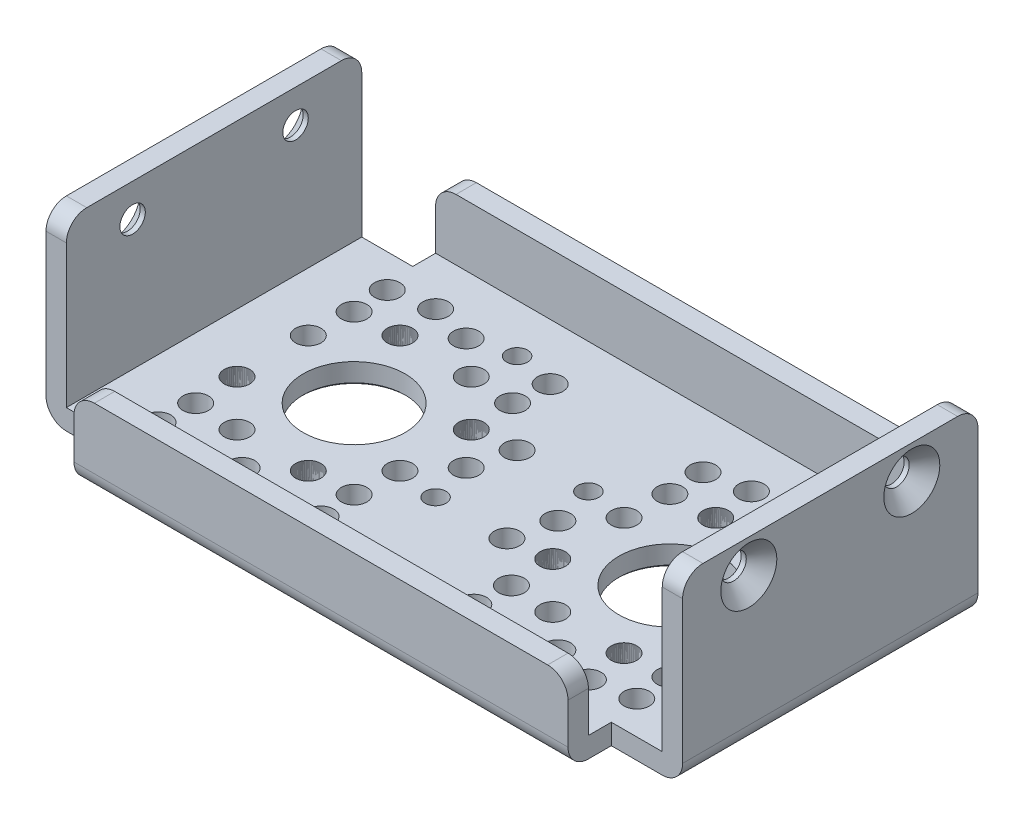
ISO-10303-21;
HEADER;
FILE_DESCRIPTION(('STEP AP214'),'2;1');
FILE_NAME('part.step','',(''),(''),'','','');
FILE_SCHEMA(('AUTOMOTIVE_DESIGN { 1 0 10303 214 1 1 1 1 }'));
ENDSEC;
DATA;
#1=APPLICATION_CONTEXT('core data for automotive mechanical design processes');
#2=APPLICATION_PROTOCOL_DEFINITION('international standard','automotive_design',2000,#1);
#3=PRODUCT_CONTEXT('',#1,'mechanical');
#4=PRODUCT('Part','Part','',(#3));
#5=PRODUCT_RELATED_PRODUCT_CATEGORY('part','',(#4));
#6=PRODUCT_DEFINITION_FORMATION('','',#4);
#7=PRODUCT_DEFINITION_CONTEXT('part definition',#1,'design');
#8=PRODUCT_DEFINITION('design','',#6,#7);
#9=PRODUCT_DEFINITION_SHAPE('','',#8);
#10=(LENGTH_UNIT() NAMED_UNIT(*) SI_UNIT(.MILLI.,.METRE.));
#11=(NAMED_UNIT(*) PLANE_ANGLE_UNIT() SI_UNIT($,.RADIAN.));
#12=(NAMED_UNIT(*) SI_UNIT($,.STERADIAN.) SOLID_ANGLE_UNIT());
#13=UNCERTAINTY_MEASURE_WITH_UNIT(LENGTH_MEASURE(1.E-05),#10,'distance_accuracy_value','');
#14=(GEOMETRIC_REPRESENTATION_CONTEXT(3) GLOBAL_UNCERTAINTY_ASSIGNED_CONTEXT((#13)) GLOBAL_UNIT_ASSIGNED_CONTEXT((#10,
#11,#12)) REPRESENTATION_CONTEXT('',''));
#15=CARTESIAN_POINT('',(0.,0.,0.));
#16=DIRECTION('',(0.,0.,1.));
#17=DIRECTION('',(1.,0.,0.));
#18=AXIS2_PLACEMENT_3D('',#15,#16,#17);
#19=CARTESIAN_POINT('',(-12.,2.1,8.));
#20=DIRECTION('',(0.,-1.,0.));
#21=DIRECTION('',(0.,0.,-1.));
#22=AXIS2_PLACEMENT_3D('',#19,#20,#21);
#23=CYLINDRICAL_SURFACE('',#22,1.25);
#24=CARTESIAN_POINT('',(-12.,0.0999999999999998,8.));
#25=DIRECTION('',(0.,-1.,0.));
#26=DIRECTION('',(0.,0.,-1.));
#27=AXIS2_PLACEMENT_3D('',#24,#25,#26);
#28=CIRCLE('',#27,1.25);
#29=CARTESIAN_POINT('',(-12.,0.0999999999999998,6.75));
#30=VERTEX_POINT('',#29);
#31=EDGE_CURVE('P0_E10',#30,#30,#28,.F.);
#32=ORIENTED_EDGE('',*,*,#31,.T.);
#33=EDGE_LOOP('',(#32));
#34=FACE_BOUND('',#33,.T.);
#35=CARTESIAN_POINT('',(-12.,2.,8.));
#36=DIRECTION('',(0.,-1.,0.));
#37=DIRECTION('',(0.,0.,-1.));
#38=AXIS2_PLACEMENT_3D('',#35,#36,#37);
#39=CIRCLE('',#38,1.25);
#40=CARTESIAN_POINT('',(-12.,2.,6.75));
#41=VERTEX_POINT('',#40);
#42=EDGE_CURVE('P0_E16',#41,#41,#39,.T.);
#43=ORIENTED_EDGE('',*,*,#42,.T.);
#44=EDGE_LOOP('',(#43));
#45=FACE_BOUND('',#44,.T.);
#46=ADVANCED_FACE('P0_F15',(#34,#45),#23,.T.);
#47=OPEN_SHELL('',(#46));
#48=SHELL_BASED_SURFACE_MODEL('P0_B1',(#47));
#49=CARTESIAN_POINT('',(-7.5,2.1,-3.5));
#50=DIRECTION('',(0.,-1.,0.));
#51=DIRECTION('',(0.,0.,-1.));
#52=AXIS2_PLACEMENT_3D('',#49,#50,#51);
#53=CYLINDRICAL_SURFACE('',#52,1.25);
#54=CARTESIAN_POINT('',(-7.5,0.0999999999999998,-3.5));
#55=DIRECTION('',(0.,-1.,0.));
#56=DIRECTION('',(0.,0.,-1.));
#57=AXIS2_PLACEMENT_3D('',#54,#55,#56);
#58=CIRCLE('',#57,1.25);
#59=CARTESIAN_POINT('',(-7.5,0.0999999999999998,-4.75));
#60=VERTEX_POINT('',#59);
#61=EDGE_CURVE('P1_E10',#60,#60,#58,.F.);
#62=ORIENTED_EDGE('',*,*,#61,.T.);
#63=EDGE_LOOP('',(#62));
#64=FACE_BOUND('',#63,.T.);
#65=CARTESIAN_POINT('',(-7.5,2.,-3.5));
#66=DIRECTION('',(0.,-1.,0.));
#67=DIRECTION('',(0.,0.,-1.));
#68=AXIS2_PLACEMENT_3D('',#65,#66,#67);
#69=CIRCLE('',#68,1.25);
#70=CARTESIAN_POINT('',(-7.5,2.,-4.75));
#71=VERTEX_POINT('',#70);
#72=EDGE_CURVE('P1_E16',#71,#71,#69,.T.);
#73=ORIENTED_EDGE('',*,*,#72,.T.);
#74=EDGE_LOOP('',(#73));
#75=FACE_BOUND('',#74,.T.);
#76=ADVANCED_FACE('P1_F15',(#64,#75),#53,.T.);
#77=OPEN_SHELL('',(#76));
#78=SHELL_BASED_SURFACE_MODEL('P1_B1',(#77));
#79=CARTESIAN_POINT('',(3.5,2.1,-4.));
#80=DIRECTION('',(0.,-1.,0.));
#81=DIRECTION('',(0.,0.,-1.));
#82=AXIS2_PLACEMENT_3D('',#79,#80,#81);
#83=CYLINDRICAL_SURFACE('',#82,1.25);
#84=CARTESIAN_POINT('',(3.5,0.0999999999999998,-4.));
#85=DIRECTION('',(0.,-1.,0.));
#86=DIRECTION('',(0.,0.,-1.));
#87=AXIS2_PLACEMENT_3D('',#84,#85,#86);
#88=CIRCLE('',#87,1.25);
#89=CARTESIAN_POINT('',(3.5,0.0999999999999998,-5.25));
#90=VERTEX_POINT('',#89);
#91=EDGE_CURVE('P2_E10',#90,#90,#88,.F.);
#92=ORIENTED_EDGE('',*,*,#91,.T.);
#93=EDGE_LOOP('',(#92));
#94=FACE_BOUND('',#93,.T.);
#95=CARTESIAN_POINT('',(3.5,2.,-4.));
#96=DIRECTION('',(0.,-1.,0.));
#97=DIRECTION('',(0.,0.,-1.));
#98=AXIS2_PLACEMENT_3D('',#95,#96,#97);
#99=CIRCLE('',#98,1.25);
#100=CARTESIAN_POINT('',(3.5,2.,-5.25));
#101=VERTEX_POINT('',#100);
#102=EDGE_CURVE('P2_E16',#101,#101,#99,.T.);
#103=ORIENTED_EDGE('',*,*,#102,.T.);
#104=EDGE_LOOP('',(#103));
#105=FACE_BOUND('',#104,.T.);
#106=ADVANCED_FACE('P2_F15',(#94,#105),#83,.T.);
#107=OPEN_SHELL('',(#106));
#108=SHELL_BASED_SURFACE_MODEL('P2_B1',(#107));
#109=CARTESIAN_POINT('',(23.5,2.1,-3.5));
#110=DIRECTION('',(0.,-1.,0.));
#111=DIRECTION('',(0.,0.,-1.));
#112=AXIS2_PLACEMENT_3D('',#109,#110,#111);
#113=CYLINDRICAL_SURFACE('',#112,1.25);
#114=CARTESIAN_POINT('',(23.5,0.0999999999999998,-3.5));
#115=DIRECTION('',(0.,-1.,0.));
#116=DIRECTION('',(0.,0.,-1.));
#117=AXIS2_PLACEMENT_3D('',#114,#115,#116);
#118=CIRCLE('',#117,1.25);
#119=CARTESIAN_POINT('',(23.5,0.0999999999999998,-4.75));
#120=VERTEX_POINT('',#119);
#121=EDGE_CURVE('P3_E10',#120,#120,#118,.F.);
#122=ORIENTED_EDGE('',*,*,#121,.T.);
#123=EDGE_LOOP('',(#122));
#124=FACE_BOUND('',#123,.T.);
#125=CARTESIAN_POINT('',(23.5,2.,-3.5));
#126=DIRECTION('',(0.,-1.,0.));
#127=DIRECTION('',(0.,0.,-1.));
#128=AXIS2_PLACEMENT_3D('',#125,#126,#127);
#129=CIRCLE('',#128,1.25);
#130=CARTESIAN_POINT('',(23.5,2.,-4.75));
#131=VERTEX_POINT('',#130);
#132=EDGE_CURVE('P3_E16',#131,#131,#129,.T.);
#133=ORIENTED_EDGE('',*,*,#132,.T.);
#134=EDGE_LOOP('',(#133));
#135=FACE_BOUND('',#134,.T.);
#136=ADVANCED_FACE('P3_F15',(#124,#135),#113,.T.);
#137=OPEN_SHELL('',(#136));
#138=SHELL_BASED_SURFACE_MODEL('P3_B1',(#137));
#139=CARTESIAN_POINT('',(-19.5,2.1,12.));
#140=DIRECTION('',(0.,-1.,0.));
#141=DIRECTION('',(0.,0.,-1.));
#142=AXIS2_PLACEMENT_3D('',#139,#140,#141);
#143=CYLINDRICAL_SURFACE('',#142,1.25);
#144=CARTESIAN_POINT('',(-19.5,0.0999999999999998,12.));
#145=DIRECTION('',(0.,-1.,0.));
#146=DIRECTION('',(0.,0.,-1.));
#147=AXIS2_PLACEMENT_3D('',#144,#145,#146);
#148=CIRCLE('',#147,1.25);
#149=CARTESIAN_POINT('',(-19.5,0.0999999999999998,10.75));
#150=VERTEX_POINT('',#149);
#151=EDGE_CURVE('P4_E10',#150,#150,#148,.F.);
#152=ORIENTED_EDGE('',*,*,#151,.T.);
#153=EDGE_LOOP('',(#152));
#154=FACE_BOUND('',#153,.T.);
#155=CARTESIAN_POINT('',(-19.5,2.,12.));
#156=DIRECTION('',(0.,-1.,0.));
#157=DIRECTION('',(0.,0.,-1.));
#158=AXIS2_PLACEMENT_3D('',#155,#156,#157);
#159=CIRCLE('',#158,1.25);
#160=CARTESIAN_POINT('',(-19.5,2.,10.75));
#161=VERTEX_POINT('',#160);
#162=EDGE_CURVE('P4_E16',#161,#161,#159,.T.);
#163=ORIENTED_EDGE('',*,*,#162,.T.);
#164=EDGE_LOOP('',(#163));
#165=FACE_BOUND('',#164,.T.);
#166=ADVANCED_FACE('P4_F15',(#154,#165),#143,.T.);
#167=OPEN_SHELL('',(#166));
#168=SHELL_BASED_SURFACE_MODEL('P4_B1',(#167));
#169=CARTESIAN_POINT('',(-11.5,2.1,-12.));
#170=DIRECTION('',(0.,-1.,0.));
#171=DIRECTION('',(0.,0.,-1.));
#172=AXIS2_PLACEMENT_3D('',#169,#170,#171);
#173=CYLINDRICAL_SURFACE('',#172,1.25);
#174=CARTESIAN_POINT('',(-11.5,0.0999999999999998,-12.));
#175=DIRECTION('',(0.,-1.,0.));
#176=DIRECTION('',(0.,0.,-1.));
#177=AXIS2_PLACEMENT_3D('',#174,#175,#176);
#178=CIRCLE('',#177,1.25);
#179=CARTESIAN_POINT('',(-11.5,0.0999999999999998,-13.25));
#180=VERTEX_POINT('',#179);
#181=EDGE_CURVE('P5_E10',#180,#180,#178,.F.);
#182=ORIENTED_EDGE('',*,*,#181,.T.);
#183=EDGE_LOOP('',(#182));
#184=FACE_BOUND('',#183,.T.);
#185=CARTESIAN_POINT('',(-11.5,2.,-12.));
#186=DIRECTION('',(0.,-1.,0.));
#187=DIRECTION('',(0.,0.,-1.));
#188=AXIS2_PLACEMENT_3D('',#185,#186,#187);
#189=CIRCLE('',#188,1.25);
#190=CARTESIAN_POINT('',(-11.5,2.,-13.25));
#191=VERTEX_POINT('',#190);
#192=EDGE_CURVE('P5_E16',#191,#191,#189,.T.);
#193=ORIENTED_EDGE('',*,*,#192,.T.);
#194=EDGE_LOOP('',(#193));
#195=FACE_BOUND('',#194,.T.);
#196=ADVANCED_FACE('P5_F15',(#184,#195),#173,.T.);
#197=OPEN_SHELL('',(#196));
#198=SHELL_BASED_SURFACE_MODEL('P5_B1',(#197));
#199=CARTESIAN_POINT('',(-19.,2.1,-8.));
#200=DIRECTION('',(0.,-1.,0.));
#201=DIRECTION('',(0.,0.,-1.));
#202=AXIS2_PLACEMENT_3D('',#199,#200,#201);
#203=CYLINDRICAL_SURFACE('',#202,1.25);
#204=CARTESIAN_POINT('',(-19.,0.0999999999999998,-8.));
#205=DIRECTION('',(0.,-1.,0.));
#206=DIRECTION('',(0.,0.,-1.));
#207=AXIS2_PLACEMENT_3D('',#204,#205,#206);
#208=CIRCLE('',#207,1.25);
#209=CARTESIAN_POINT('',(-19.,0.0999999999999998,-9.25));
#210=VERTEX_POINT('',#209);
#211=EDGE_CURVE('P6_E10',#210,#210,#208,.F.);
#212=ORIENTED_EDGE('',*,*,#211,.T.);
#213=EDGE_LOOP('',(#212));
#214=FACE_BOUND('',#213,.T.);
#215=CARTESIAN_POINT('',(-19.,2.,-8.));
#216=DIRECTION('',(0.,-1.,0.));
#217=DIRECTION('',(0.,0.,-1.));
#218=AXIS2_PLACEMENT_3D('',#215,#216,#217);
#219=CIRCLE('',#218,1.25);
#220=CARTESIAN_POINT('',(-19.,2.,-9.25));
#221=VERTEX_POINT('',#220);
#222=EDGE_CURVE('P6_E16',#221,#221,#219,.T.);
#223=ORIENTED_EDGE('',*,*,#222,.T.);
#224=EDGE_LOOP('',(#223));
#225=FACE_BOUND('',#224,.T.);
#226=ADVANCED_FACE('P6_F15',(#214,#225),#203,.T.);
#227=OPEN_SHELL('',(#226));
#228=SHELL_BASED_SURFACE_MODEL('P6_B1',(#227));
#229=CARTESIAN_POINT('',(7.5,2.1,3.5));
#230=DIRECTION('',(0.,-1.,0.));
#231=DIRECTION('',(0.,0.,-1.));
#232=AXIS2_PLACEMENT_3D('',#229,#230,#231);
#233=CYLINDRICAL_SURFACE('',#232,1.25);
#234=CARTESIAN_POINT('',(7.5,0.0999999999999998,3.5));
#235=DIRECTION('',(0.,-1.,0.));
#236=DIRECTION('',(0.,0.,-1.));
#237=AXIS2_PLACEMENT_3D('',#234,#235,#236);
#238=CIRCLE('',#237,1.25);
#239=CARTESIAN_POINT('',(7.5,0.0999999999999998,2.25));
#240=VERTEX_POINT('',#239);
#241=EDGE_CURVE('P7_E10',#240,#240,#238,.F.);
#242=ORIENTED_EDGE('',*,*,#241,.T.);
#243=EDGE_LOOP('',(#242));
#244=FACE_BOUND('',#243,.T.);
#245=CARTESIAN_POINT('',(7.5,2.,3.5));
#246=DIRECTION('',(0.,-1.,0.));
#247=DIRECTION('',(0.,0.,-1.));
#248=AXIS2_PLACEMENT_3D('',#245,#246,#247);
#249=CIRCLE('',#248,1.25);
#250=CARTESIAN_POINT('',(7.5,2.,2.25));
#251=VERTEX_POINT('',#250);
#252=EDGE_CURVE('P7_E16',#251,#251,#249,.T.);
#253=ORIENTED_EDGE('',*,*,#252,.T.);
#254=EDGE_LOOP('',(#253));
#255=FACE_BOUND('',#254,.T.);
#256=ADVANCED_FACE('P7_F15',(#244,#255),#233,.T.);
#257=OPEN_SHELL('',(#256));
#258=SHELL_BASED_SURFACE_MODEL('P7_B1',(#257));
#259=CARTESIAN_POINT('',(12.,2.1,-8.));
#260=DIRECTION('',(0.,-1.,0.));
#261=DIRECTION('',(0.,0.,-1.));
#262=AXIS2_PLACEMENT_3D('',#259,#260,#261);
#263=CYLINDRICAL_SURFACE('',#262,1.25);
#264=CARTESIAN_POINT('',(12.,0.0999999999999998,-8.));
#265=DIRECTION('',(0.,-1.,0.));
#266=DIRECTION('',(0.,0.,-1.));
#267=AXIS2_PLACEMENT_3D('',#264,#265,#266);
#268=CIRCLE('',#267,1.25);
#269=CARTESIAN_POINT('',(12.,0.0999999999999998,-9.25));
#270=VERTEX_POINT('',#269);
#271=EDGE_CURVE('P8_E10',#270,#270,#268,.F.);
#272=ORIENTED_EDGE('',*,*,#271,.T.);
#273=EDGE_LOOP('',(#272));
#274=FACE_BOUND('',#273,.T.);
#275=CARTESIAN_POINT('',(12.,2.,-8.));
#276=DIRECTION('',(0.,-1.,0.));
#277=DIRECTION('',(0.,0.,-1.));
#278=AXIS2_PLACEMENT_3D('',#275,#276,#277);
#279=CIRCLE('',#278,1.25);
#280=CARTESIAN_POINT('',(12.,2.,-9.25));
#281=VERTEX_POINT('',#280);
#282=EDGE_CURVE('P8_E16',#281,#281,#279,.T.);
#283=ORIENTED_EDGE('',*,*,#282,.T.);
#284=EDGE_LOOP('',(#283));
#285=FACE_BOUND('',#284,.T.);
#286=ADVANCED_FACE('P8_F15',(#274,#285),#263,.T.);
#287=OPEN_SHELL('',(#286));
#288=SHELL_BASED_SURFACE_MODEL('P8_B1',(#287));
#289=CARTESIAN_POINT('',(11.5,2.1,12.));
#290=DIRECTION('',(0.,-1.,0.));
#291=DIRECTION('',(0.,0.,-1.));
#292=AXIS2_PLACEMENT_3D('',#289,#290,#291);
#293=CYLINDRICAL_SURFACE('',#292,1.25);
#294=CARTESIAN_POINT('',(11.5,0.0999999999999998,12.));
#295=DIRECTION('',(0.,-1.,0.));
#296=DIRECTION('',(0.,0.,-1.));
#297=AXIS2_PLACEMENT_3D('',#294,#295,#296);
#298=CIRCLE('',#297,1.25);
#299=CARTESIAN_POINT('',(11.5,0.0999999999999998,10.75));
#300=VERTEX_POINT('',#299);
#301=EDGE_CURVE('P9_E10',#300,#300,#298,.F.);
#302=ORIENTED_EDGE('',*,*,#301,.T.);
#303=EDGE_LOOP('',(#302));
#304=FACE_BOUND('',#303,.T.);
#305=CARTESIAN_POINT('',(11.5,2.,12.));
#306=DIRECTION('',(0.,-1.,0.));
#307=DIRECTION('',(0.,0.,-1.));
#308=AXIS2_PLACEMENT_3D('',#305,#306,#307);
#309=CIRCLE('',#308,1.25);
#310=CARTESIAN_POINT('',(11.5,2.,10.75));
#311=VERTEX_POINT('',#310);
#312=EDGE_CURVE('P9_E16',#311,#311,#309,.T.);
#313=ORIENTED_EDGE('',*,*,#312,.T.);
#314=EDGE_LOOP('',(#313));
#315=FACE_BOUND('',#314,.T.);
#316=ADVANCED_FACE('P9_F15',(#304,#315),#293,.T.);
#317=OPEN_SHELL('',(#316));
#318=SHELL_BASED_SURFACE_MODEL('P9_B1',(#317));
#319=CARTESIAN_POINT('',(19.5,2.1,-12.));
#320=DIRECTION('',(0.,-1.,0.));
#321=DIRECTION('',(0.,0.,-1.));
#322=AXIS2_PLACEMENT_3D('',#319,#320,#321);
#323=CYLINDRICAL_SURFACE('',#322,1.25);
#324=CARTESIAN_POINT('',(19.5,0.0999999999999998,-12.));
#325=DIRECTION('',(0.,-1.,0.));
#326=DIRECTION('',(0.,0.,-1.));
#327=AXIS2_PLACEMENT_3D('',#324,#325,#326);
#328=CIRCLE('',#327,1.25);
#329=CARTESIAN_POINT('',(19.5,0.0999999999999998,-13.25));
#330=VERTEX_POINT('',#329);
#331=EDGE_CURVE('P10_E10',#330,#330,#328,.F.);
#332=ORIENTED_EDGE('',*,*,#331,.T.);
#333=EDGE_LOOP('',(#332));
#334=FACE_BOUND('',#333,.T.);
#335=CARTESIAN_POINT('',(19.5,2.,-12.));
#336=DIRECTION('',(0.,-1.,0.));
#337=DIRECTION('',(0.,0.,-1.));
#338=AXIS2_PLACEMENT_3D('',#335,#336,#337);
#339=CIRCLE('',#338,1.25);
#340=CARTESIAN_POINT('',(19.5,2.,-13.25));
#341=VERTEX_POINT('',#340);
#342=EDGE_CURVE('P10_E16',#341,#341,#339,.T.);
#343=ORIENTED_EDGE('',*,*,#342,.T.);
#344=EDGE_LOOP('',(#343));
#345=FACE_BOUND('',#344,.T.);
#346=ADVANCED_FACE('P10_F15',(#334,#345),#323,.T.);
#347=OPEN_SHELL('',(#346));
#348=SHELL_BASED_SURFACE_MODEL('P10_B1',(#347));
#349=CARTESIAN_POINT('',(19.,2.1,8.));
#350=DIRECTION('',(0.,-1.,0.));
#351=DIRECTION('',(0.,0.,-1.));
#352=AXIS2_PLACEMENT_3D('',#349,#350,#351);
#353=CYLINDRICAL_SURFACE('',#352,1.25);
#354=CARTESIAN_POINT('',(19.,0.0999999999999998,8.));
#355=DIRECTION('',(0.,-1.,0.));
#356=DIRECTION('',(0.,0.,-1.));
#357=AXIS2_PLACEMENT_3D('',#354,#355,#356);
#358=CIRCLE('',#357,1.25);
#359=CARTESIAN_POINT('',(19.,0.0999999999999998,6.75));
#360=VERTEX_POINT('',#359);
#361=EDGE_CURVE('P11_E10',#360,#360,#358,.F.);
#362=ORIENTED_EDGE('',*,*,#361,.T.);
#363=EDGE_LOOP('',(#362));
#364=FACE_BOUND('',#363,.T.);
#365=CARTESIAN_POINT('',(19.,2.,8.));
#366=DIRECTION('',(0.,-1.,0.));
#367=DIRECTION('',(0.,0.,-1.));
#368=AXIS2_PLACEMENT_3D('',#365,#366,#367);
#369=CIRCLE('',#368,1.25);
#370=CARTESIAN_POINT('',(19.,2.,6.75));
#371=VERTEX_POINT('',#370);
#372=EDGE_CURVE('P11_E16',#371,#371,#369,.T.);
#373=ORIENTED_EDGE('',*,*,#372,.T.);
#374=EDGE_LOOP('',(#373));
#375=FACE_BOUND('',#374,.T.);
#376=ADVANCED_FACE('P11_F15',(#364,#375),#353,.T.);
#377=OPEN_SHELL('',(#376));
#378=SHELL_BASED_SURFACE_MODEL('P11_B1',(#377));
#379=CARTESIAN_POINT('',(-3.5,2.1,4.));
#380=DIRECTION('',(0.,-1.,0.));
#381=DIRECTION('',(0.,0.,-1.));
#382=AXIS2_PLACEMENT_3D('',#379,#380,#381);
#383=CYLINDRICAL_SURFACE('',#382,1.25);
#384=CARTESIAN_POINT('',(-3.5,0.0999999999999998,4.));
#385=DIRECTION('',(0.,-1.,0.));
#386=DIRECTION('',(0.,0.,-1.));
#387=AXIS2_PLACEMENT_3D('',#384,#385,#386);
#388=CIRCLE('',#387,1.25);
#389=CARTESIAN_POINT('',(-3.5,0.0999999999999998,2.75));
#390=VERTEX_POINT('',#389);
#391=EDGE_CURVE('P12_E10',#390,#390,#388,.F.);
#392=ORIENTED_EDGE('',*,*,#391,.T.);
#393=EDGE_LOOP('',(#392));
#394=FACE_BOUND('',#393,.T.);
#395=CARTESIAN_POINT('',(-3.5,2.,4.));
#396=DIRECTION('',(0.,-1.,0.));
#397=DIRECTION('',(0.,0.,-1.));
#398=AXIS2_PLACEMENT_3D('',#395,#396,#397);
#399=CIRCLE('',#398,1.25);
#400=CARTESIAN_POINT('',(-3.5,2.,2.75));
#401=VERTEX_POINT('',#400);
#402=EDGE_CURVE('P12_E16',#401,#401,#399,.T.);
#403=ORIENTED_EDGE('',*,*,#402,.T.);
#404=EDGE_LOOP('',(#403));
#405=FACE_BOUND('',#404,.T.);
#406=ADVANCED_FACE('P12_F15',(#394,#405),#383,.T.);
#407=OPEN_SHELL('',(#406));
#408=SHELL_BASED_SURFACE_MODEL('P12_B1',(#407));
#409=CARTESIAN_POINT('',(-23.5,2.1,3.5));
#410=DIRECTION('',(0.,-1.,0.));
#411=DIRECTION('',(0.,0.,-1.));
#412=AXIS2_PLACEMENT_3D('',#409,#410,#411);
#413=CYLINDRICAL_SURFACE('',#412,1.25);
#414=CARTESIAN_POINT('',(-23.5,0.0999999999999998,3.5));
#415=DIRECTION('',(0.,-1.,0.));
#416=DIRECTION('',(0.,0.,-1.));
#417=AXIS2_PLACEMENT_3D('',#414,#415,#416);
#418=CIRCLE('',#417,1.25);
#419=CARTESIAN_POINT('',(-23.5,0.0999999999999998,2.25));
#420=VERTEX_POINT('',#419);
#421=EDGE_CURVE('P13_E10',#420,#420,#418,.F.);
#422=ORIENTED_EDGE('',*,*,#421,.T.);
#423=EDGE_LOOP('',(#422));
#424=FACE_BOUND('',#423,.T.);
#425=CARTESIAN_POINT('',(-23.5,2.,3.5));
#426=DIRECTION('',(0.,-1.,0.));
#427=DIRECTION('',(0.,0.,-1.));
#428=AXIS2_PLACEMENT_3D('',#425,#426,#427);
#429=CIRCLE('',#428,1.25);
#430=CARTESIAN_POINT('',(-23.5,2.,2.25));
#431=VERTEX_POINT('',#430);
#432=EDGE_CURVE('P13_E16',#431,#431,#429,.T.);
#433=ORIENTED_EDGE('',*,*,#432,.T.);
#434=EDGE_LOOP('',(#433));
#435=FACE_BOUND('',#434,.T.);
#436=ADVANCED_FACE('P13_F15',(#424,#435),#413,.T.);
#437=OPEN_SHELL('',(#436));
#438=SHELL_BASED_SURFACE_MODEL('P13_B1',(#437));
#439=CARTESIAN_POINT('',(-31.2500000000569,14.75,8.));
#440=DIRECTION('',(-1.,0.,0.));
#441=DIRECTION('',(0.,0.,1.));
#442=AXIS2_PLACEMENT_3D('',#439,#440,#441);
#443=CONICAL_SURFACE('',#442,2.75000000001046,0.785398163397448);
#444=CARTESIAN_POINT('',(-31.2500000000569,14.75,8.));
#445=DIRECTION('',(-1.,0.,0.));
#446=DIRECTION('',(0.,0.,1.));
#447=AXIS2_PLACEMENT_3D('',#444,#445,#446);
#448=CIRCLE('',#447,2.75000000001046);
#449=CARTESIAN_POINT('',(-31.2500000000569,14.75,10.7500000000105));
#450=VERTEX_POINT('',#449);
#451=EDGE_CURVE('P14_E20',#450,#450,#448,.T.);
#452=ORIENTED_EDGE('',*,*,#451,.T.);
#453=EDGE_LOOP('',(#452));
#454=FACE_BOUND('',#453,.T.);
#455=CARTESIAN_POINT('',(-29.7500000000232,14.75,8.));
#456=DIRECTION('',(-1.,0.,0.));
#457=DIRECTION('',(0.,0.,1.));
#458=AXIS2_PLACEMENT_3D('',#455,#456,#457);
#459=CIRCLE('',#458,1.24999999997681);
#460=CARTESIAN_POINT('',(-29.7500000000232,14.75,9.24999999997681));
#461=VERTEX_POINT('',#460);
#462=EDGE_CURVE('P14_E343',#461,#461,#459,.F.);
#463=ORIENTED_EDGE('',*,*,#462,.T.);
#464=EDGE_LOOP('',(#463));
#465=FACE_BOUND('',#464,.T.);
#466=ADVANCED_FACE('P14_F17',(#454,#465),#443,.F.);
#467=CARTESIAN_POINT('',(-31.2499999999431,14.75,-8.));
#468=DIRECTION('',(-1.,0.,0.));
#469=DIRECTION('',(0.,-1.,0.));
#470=AXIS2_PLACEMENT_3D('',#467,#468,#469);
#471=CONICAL_SURFACE('',#470,2.74999999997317,0.785398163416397);
#472=CARTESIAN_POINT('',(-29.7500000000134,14.75,-8.));
#473=DIRECTION('',(-1.,0.,0.));
#474=DIRECTION('',(0.,0.,1.));
#475=AXIS2_PLACEMENT_3D('',#472,#473,#474);
#476=CIRCLE('',#475,1.24999999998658);
#477=CARTESIAN_POINT('',(-29.7500000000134,14.75,-6.75000000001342));
#478=VERTEX_POINT('',#477);
#479=EDGE_CURVE('P14_E339',#478,#478,#476,.F.);
#480=ORIENTED_EDGE('',*,*,#479,.T.);
#481=EDGE_LOOP('',(#480));
#482=FACE_BOUND('',#481,.T.);
#483=CARTESIAN_POINT('',(-31.2499999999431,14.75,-8.));
#484=DIRECTION('',(-1.,0.,0.));
#485=DIRECTION('',(0.,0.,1.));
#486=AXIS2_PLACEMENT_3D('',#483,#484,#485);
#487=CIRCLE('',#486,2.74999999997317);
#488=CARTESIAN_POINT('',(-31.2499999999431,14.75,-5.25000000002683));
#489=VERTEX_POINT('',#488);
#490=EDGE_CURVE('P14_E433',#489,#489,#487,.T.);
#491=ORIENTED_EDGE('',*,*,#490,.T.);
#492=EDGE_LOOP('',(#491));
#493=FACE_BOUND('',#492,.T.);
#494=ADVANCED_FACE('P14_F1420',(#482,#493),#471,.F.);
#495=CARTESIAN_POINT('',(31.2500000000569,14.75,8.));
#496=DIRECTION('',(1.,0.,0.));
#497=DIRECTION('',(0.,0.,-1.));
#498=AXIS2_PLACEMENT_3D('',#495,#496,#497);
#499=CONICAL_SURFACE('',#498,2.75000000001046,0.785398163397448);
#500=CARTESIAN_POINT('',(29.7500000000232,14.75,8.));
#501=DIRECTION('',(1.,0.,0.));
#502=DIRECTION('',(0.,0.,-1.));
#503=AXIS2_PLACEMENT_3D('',#500,#501,#502);
#504=CIRCLE('',#503,1.24999999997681);
#505=CARTESIAN_POINT('',(29.7500000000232,14.75,6.75000000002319));
#506=VERTEX_POINT('',#505);
#507=EDGE_CURVE('P14_E282',#506,#506,#504,.F.);
#508=ORIENTED_EDGE('',*,*,#507,.T.);
#509=EDGE_LOOP('',(#508));
#510=FACE_BOUND('',#509,.T.);
#511=CARTESIAN_POINT('',(31.2500000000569,14.75,8.));
#512=DIRECTION('',(1.,0.,0.));
#513=DIRECTION('',(0.,0.,-1.));
#514=AXIS2_PLACEMENT_3D('',#511,#512,#513);
#515=CIRCLE('',#514,2.75000000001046);
#516=CARTESIAN_POINT('',(31.2500000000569,14.75,5.24999999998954));
#517=VERTEX_POINT('',#516);
#518=EDGE_CURVE('P14_E425',#517,#517,#515,.T.);
#519=ORIENTED_EDGE('',*,*,#518,.T.);
#520=EDGE_LOOP('',(#519));
#521=FACE_BOUND('',#520,.T.);
#522=ADVANCED_FACE('P14_F462',(#510,#521),#499,.F.);
#523=CARTESIAN_POINT('',(31.2499999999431,14.75,-8.));
#524=DIRECTION('',(1.,0.,0.));
#525=DIRECTION('',(0.,1.,0.));
#526=AXIS2_PLACEMENT_3D('',#523,#524,#525);
#527=CONICAL_SURFACE('',#526,2.74999999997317,0.785398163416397);
#528=CARTESIAN_POINT('',(29.7500000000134,14.75,-8.));
#529=DIRECTION('',(1.,0.,0.));
#530=DIRECTION('',(0.,1.,0.));
#531=AXIS2_PLACEMENT_3D('',#528,#529,#530);
#532=CIRCLE('',#531,1.24999999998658);
#533=CARTESIAN_POINT('',(29.7500000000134,15.9999999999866,-8.));
#534=VERTEX_POINT('',#533);
#535=EDGE_CURVE('P14_E278',#534,#534,#532,.F.);
#536=ORIENTED_EDGE('',*,*,#535,.T.);
#537=EDGE_LOOP('',(#536));
#538=FACE_BOUND('',#537,.T.);
#539=CARTESIAN_POINT('',(31.2499999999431,14.75,-8.));
#540=DIRECTION('',(1.,0.,0.));
#541=DIRECTION('',(0.,1.,0.));
#542=AXIS2_PLACEMENT_3D('',#539,#540,#541);
#543=CIRCLE('',#542,2.74999999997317);
#544=CARTESIAN_POINT('',(31.2499999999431,17.4999999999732,-8.));
#545=VERTEX_POINT('',#544);
#546=EDGE_CURVE('P14_E421',#545,#545,#543,.T.);
#547=ORIENTED_EDGE('',*,*,#546,.T.);
#548=EDGE_LOOP('',(#547));
#549=FACE_BOUND('',#548,.T.);
#550=ADVANCED_FACE('P14_F453',(#538,#549),#527,.F.);
#551=CARTESIAN_POINT('',(-31.25,2.,-14.5));
#552=DIRECTION('',(1.,0.,0.));
#553=DIRECTION('',(0.,1.,0.));
#554=AXIS2_PLACEMENT_3D('',#551,#552,#553);
#555=PLANE('',#554);
#556=DIRECTION('',(0.,1.,0.));
#557=VECTOR('',#556,1.);
#558=CARTESIAN_POINT('',(-31.25,2.,14.5));
#559=LINE('',#558,#557);
#560=CARTESIAN_POINT('',(-31.25,2.,14.5));
#561=VERTEX_POINT('',#560);
#562=CARTESIAN_POINT('',(-31.25,16.,14.5));
#563=VERTEX_POINT('',#562);
#564=EDGE_CURVE('P14_E390',#561,#563,#559,.T.);
#565=ORIENTED_EDGE('',*,*,#564,.T.);
#566=CARTESIAN_POINT('',(-31.25,16.,12.5));
#567=DIRECTION('',(-1.,0.,0.));
#568=DIRECTION('',(0.,0.,1.));
#569=AXIS2_PLACEMENT_3D('',#566,#567,#568);
#570=CIRCLE('',#569,2.);
#571=CARTESIAN_POINT('',(-31.25,18.,12.5));
#572=VERTEX_POINT('',#571);
#573=EDGE_CURVE('P14_E351',#572,#563,#570,.F.);
#574=ORIENTED_EDGE('',*,*,#573,.F.);
#575=DIRECTION('',(0.,0.,1.));
#576=VECTOR('',#575,1.);
#577=CARTESIAN_POINT('',(-31.25,18.,-14.5));
#578=LINE('',#577,#576);
#579=CARTESIAN_POINT('',(-31.25,18.,-12.5));
#580=VERTEX_POINT('',#579);
#581=EDGE_CURVE('P14_E362',#572,#580,#578,.F.);
#582=ORIENTED_EDGE('',*,*,#581,.T.);
#583=CARTESIAN_POINT('',(-31.25,16.,-12.5));
#584=DIRECTION('',(-1.,0.,0.));
#585=DIRECTION('',(0.,0.,1.));
#586=AXIS2_PLACEMENT_3D('',#583,#584,#585);
#587=CIRCLE('',#586,2.);
#588=CARTESIAN_POINT('',(-31.25,16.,-14.5));
#589=VERTEX_POINT('',#588);
#590=EDGE_CURVE('P14_E365',#589,#580,#587,.F.);
#591=ORIENTED_EDGE('',*,*,#590,.F.);
#592=DIRECTION('',(0.,-1.,0.));
#593=VECTOR('',#592,1.);
#594=CARTESIAN_POINT('',(-31.25,1.,-14.5));
#595=LINE('',#594,#593);
#596=CARTESIAN_POINT('',(-31.25,2.,-14.5));
#597=VERTEX_POINT('',#596);
#598=EDGE_CURVE('P14_E373',#597,#589,#595,.F.);
#599=ORIENTED_EDGE('',*,*,#598,.F.);
#600=DIRECTION('',(0.,0.,1.));
#601=VECTOR('',#600,1.);
#602=CARTESIAN_POINT('',(-31.25,2.,-14.5));
#603=LINE('',#602,#601);
#604=EDGE_CURVE('P14_E274',#561,#597,#603,.F.);
#605=ORIENTED_EDGE('',*,*,#604,.F.);
#606=EDGE_LOOP('',(#565,#574,#582,#591,#599,#605));
#607=FACE_BOUND('',#606,.T.);
#608=ORIENTED_EDGE('',*,*,#490,.F.);
#609=EDGE_LOOP('',(#608));
#610=FACE_BOUND('',#609,.T.);
#611=ORIENTED_EDGE('',*,*,#451,.F.);
#612=EDGE_LOOP('',(#611));
#613=FACE_BOUND('',#612,.T.);
#614=ADVANCED_FACE('P14_F450',(#607,#610,#613),#555,.F.);
#615=CARTESIAN_POINT('',(24.25,2.,-18.75));
#616=DIRECTION('',(0.,0.,1.));
#617=DIRECTION('',(1.,0.,0.));
#618=AXIS2_PLACEMENT_3D('',#615,#616,#617);
#619=PLANE('',#618);
#620=DIRECTION('',(0.,1.,0.));
#621=VECTOR('',#620,1.);
#622=CARTESIAN_POINT('',(-24.25,1.,-18.75));
#623=LINE('',#622,#621);
#624=CARTESIAN_POINT('',(-24.25,6.,-18.75));
#625=VERTEX_POINT('',#624);
#626=CARTESIAN_POINT('',(-24.25,2.,-18.75));
#627=VERTEX_POINT('',#626);
#628=EDGE_CURVE('P14_E429',#625,#627,#623,.F.);
#629=ORIENTED_EDGE('',*,*,#628,.F.);
#630=CARTESIAN_POINT('',(-22.25,6.,-18.75));
#631=DIRECTION('',(0.,0.,-1.));
#632=DIRECTION('',(-1.,0.,0.));
#633=AXIS2_PLACEMENT_3D('',#630,#631,#632);
#634=CIRCLE('',#633,2.);
#635=CARTESIAN_POINT('',(-22.25,8.,-18.75));
#636=VERTEX_POINT('',#635);
#637=EDGE_CURVE('P14_E329',#636,#625,#634,.F.);
#638=ORIENTED_EDGE('',*,*,#637,.F.);
#639=DIRECTION('',(1.,0.,0.));
#640=VECTOR('',#639,1.);
#641=CARTESIAN_POINT('',(24.25,8.,-18.75));
#642=LINE('',#641,#640);
#643=CARTESIAN_POINT('',(22.25,8.,-18.75));
#644=VERTEX_POINT('',#643);
#645=EDGE_CURVE('P14_E336',#636,#644,#642,.T.);
#646=ORIENTED_EDGE('',*,*,#645,.T.);
#647=CARTESIAN_POINT('',(22.25,6.,-18.75));
#648=DIRECTION('',(0.,0.,-1.));
#649=DIRECTION('',(-1.,0.,0.));
#650=AXIS2_PLACEMENT_3D('',#647,#648,#649);
#651=CIRCLE('',#650,2.);
#652=CARTESIAN_POINT('',(24.25,6.,-18.75));
#653=VERTEX_POINT('',#652);
#654=EDGE_CURVE('P14_E325',#653,#644,#651,.F.);
#655=ORIENTED_EDGE('',*,*,#654,.F.);
#656=DIRECTION('',(0.,1.,0.));
#657=VECTOR('',#656,1.);
#658=CARTESIAN_POINT('',(24.25,1.,-18.75));
#659=LINE('',#658,#657);
#660=CARTESIAN_POINT('',(24.25,2.,-18.75));
#661=VERTEX_POINT('',#660);
#662=EDGE_CURVE('P14_E173',#661,#653,#659,.T.);
#663=ORIENTED_EDGE('',*,*,#662,.F.);
#664=DIRECTION('',(-1.,0.,0.));
#665=VECTOR('',#664,1.);
#666=CARTESIAN_POINT('',(24.25,2.,-18.75));
#667=LINE('',#666,#665);
#668=EDGE_CURVE('P14_E255',#627,#661,#667,.F.);
#669=ORIENTED_EDGE('',*,*,#668,.F.);
#670=EDGE_LOOP('',(#629,#638,#646,#655,#663,#669));
#671=FACE_BOUND('',#670,.T.);
#672=ADVANCED_FACE('P14_F452',(#671),#619,.F.);
#673=CARTESIAN_POINT('',(31.25,2.,14.5));
#674=DIRECTION('',(-1.,0.,0.));
#675=DIRECTION('',(0.,0.,1.));
#676=AXIS2_PLACEMENT_3D('',#673,#674,#675);
#677=PLANE('',#676);
#678=DIRECTION('',(0.,-1.,0.));
#679=VECTOR('',#678,1.);
#680=CARTESIAN_POINT('',(31.25,1.,-14.5));
#681=LINE('',#680,#679);
#682=CARTESIAN_POINT('',(31.25,16.,-14.5));
#683=VERTEX_POINT('',#682);
#684=CARTESIAN_POINT('',(31.25,2.,-14.5));
#685=VERTEX_POINT('',#684);
#686=EDGE_CURVE('P14_E313',#683,#685,#681,.T.);
#687=ORIENTED_EDGE('',*,*,#686,.F.);
#688=CARTESIAN_POINT('',(31.25,16.,-12.5));
#689=DIRECTION('',(1.,0.,0.));
#690=DIRECTION('',(0.,0.,-1.));
#691=AXIS2_PLACEMENT_3D('',#688,#689,#690);
#692=CIRCLE('',#691,2.);
#693=CARTESIAN_POINT('',(31.25,18.,-12.5));
#694=VERTEX_POINT('',#693);
#695=EDGE_CURVE('P14_E290',#694,#683,#692,.F.);
#696=ORIENTED_EDGE('',*,*,#695,.F.);
#697=DIRECTION('',(0.,0.,1.));
#698=VECTOR('',#697,1.);
#699=CARTESIAN_POINT('',(31.25,18.,14.5));
#700=LINE('',#699,#698);
#701=CARTESIAN_POINT('',(31.25,18.,12.5));
#702=VERTEX_POINT('',#701);
#703=EDGE_CURVE('P14_E301',#694,#702,#700,.T.);
#704=ORIENTED_EDGE('',*,*,#703,.T.);
#705=CARTESIAN_POINT('',(31.25,16.,12.5));
#706=DIRECTION('',(1.,0.,0.));
#707=DIRECTION('',(0.,0.,-1.));
#708=AXIS2_PLACEMENT_3D('',#705,#706,#707);
#709=CIRCLE('',#708,2.);
#710=CARTESIAN_POINT('',(31.25,16.,14.5));
#711=VERTEX_POINT('',#710);
#712=EDGE_CURVE('P14_E235',#711,#702,#709,.F.);
#713=ORIENTED_EDGE('',*,*,#712,.F.);
#714=DIRECTION('',(0.,1.,0.));
#715=VECTOR('',#714,1.);
#716=CARTESIAN_POINT('',(31.25,2.,14.5));
#717=LINE('',#716,#715);
#718=CARTESIAN_POINT('',(31.25,2.,14.5));
#719=VERTEX_POINT('',#718);
#720=EDGE_CURVE('P14_E227',#711,#719,#717,.F.);
#721=ORIENTED_EDGE('',*,*,#720,.T.);
#722=DIRECTION('',(0.,0.,-1.));
#723=VECTOR('',#722,1.);
#724=CARTESIAN_POINT('',(31.25,2.,14.5));
#725=LINE('',#724,#723);
#726=EDGE_CURVE('P14_E232',#685,#719,#725,.F.);
#727=ORIENTED_EDGE('',*,*,#726,.F.);
#728=EDGE_LOOP('',(#687,#696,#704,#713,#721,#727));
#729=FACE_BOUND('',#728,.T.);
#730=ORIENTED_EDGE('',*,*,#546,.F.);
#731=EDGE_LOOP('',(#730));
#732=FACE_BOUND('',#731,.T.);
#733=ORIENTED_EDGE('',*,*,#518,.F.);
#734=EDGE_LOOP('',(#733));
#735=FACE_BOUND('',#734,.T.);
#736=ADVANCED_FACE('P14_F229',(#729,#732,#735),#677,.F.);
#737=CARTESIAN_POINT('',(24.25,2.,18.75));
#738=DIRECTION('',(0.,0.,1.));
#739=DIRECTION('',(1.,0.,0.));
#740=AXIS2_PLACEMENT_3D('',#737,#738,#739);
#741=PLANE('',#740);
#742=DIRECTION('',(0.,1.,0.));
#743=VECTOR('',#742,1.);
#744=CARTESIAN_POINT('',(24.25,2.,18.75));
#745=LINE('',#744,#743);
#746=CARTESIAN_POINT('',(24.25,2.,18.75));
#747=VERTEX_POINT('',#746);
#748=CARTESIAN_POINT('',(24.25,6.,18.75));
#749=VERTEX_POINT('',#748);
#750=EDGE_CURVE('P14_E415',#747,#749,#745,.T.);
#751=ORIENTED_EDGE('',*,*,#750,.T.);
#752=CARTESIAN_POINT('',(22.25,6.,18.75));
#753=DIRECTION('',(0.,0.,1.));
#754=DIRECTION('',(1.,0.,0.));
#755=AXIS2_PLACEMENT_3D('',#752,#753,#754);
#756=CIRCLE('',#755,2.);
#757=CARTESIAN_POINT('',(22.25,8.,18.75));
#758=VERTEX_POINT('',#757);
#759=EDGE_CURVE('P14_E404',#758,#749,#756,.F.);
#760=ORIENTED_EDGE('',*,*,#759,.F.);
#761=DIRECTION('',(1.,0.,0.));
#762=VECTOR('',#761,1.);
#763=CARTESIAN_POINT('',(0.,8.,18.75));
#764=LINE('',#763,#762);
#765=CARTESIAN_POINT('',(-22.25,8.,18.75));
#766=VERTEX_POINT('',#765);
#767=EDGE_CURVE('P14_E412',#766,#758,#764,.T.);
#768=ORIENTED_EDGE('',*,*,#767,.F.);
#769=CARTESIAN_POINT('',(-22.25,6.,18.75));
#770=DIRECTION('',(0.,0.,1.));
#771=DIRECTION('',(1.,0.,0.));
#772=AXIS2_PLACEMENT_3D('',#769,#770,#771);
#773=CIRCLE('',#772,2.);
#774=CARTESIAN_POINT('',(-24.25,6.,18.75));
#775=VERTEX_POINT('',#774);
#776=EDGE_CURVE('P14_E400',#775,#766,#773,.F.);
#777=ORIENTED_EDGE('',*,*,#776,.F.);
#778=DIRECTION('',(0.,1.,0.));
#779=VECTOR('',#778,1.);
#780=CARTESIAN_POINT('',(-24.25,2.,18.75));
#781=LINE('',#780,#779);
#782=CARTESIAN_POINT('',(-24.25,2.,18.75));
#783=VERTEX_POINT('',#782);
#784=EDGE_CURVE('P14_E418',#775,#783,#781,.F.);
#785=ORIENTED_EDGE('',*,*,#784,.T.);
#786=DIRECTION('',(-1.,0.,0.));
#787=VECTOR('',#786,1.);
#788=CARTESIAN_POINT('',(24.25,2.00000000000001,18.75));
#789=LINE('',#788,#787);
#790=EDGE_CURVE('P14_E1888',#747,#783,#789,.T.);
#791=ORIENTED_EDGE('',*,*,#790,.F.);
#792=EDGE_LOOP('',(#751,#760,#768,#777,#785,#791));
#793=FACE_BOUND('',#792,.T.);
#794=ADVANCED_FACE('P14_F872',(#793),#741,.T.);
#795=CARTESIAN_POINT('',(0.,8.,17.75));
#796=DIRECTION('',(0.,1.,0.));
#797=DIRECTION('',(1.,0.,0.));
#798=AXIS2_PLACEMENT_3D('',#795,#796,#797);
#799=PLANE('',#798);
#800=ORIENTED_EDGE('',*,*,#767,.T.);
#801=DIRECTION('',(0.,0.,1.));
#802=VECTOR('',#801,1.);
#803=CARTESIAN_POINT('',(22.25,8.,-67.635));
#804=LINE('',#803,#802);
#805=CARTESIAN_POINT('',(22.25,8.,16.75));
#806=VERTEX_POINT('',#805);
#807=EDGE_CURVE('P14_E408',#806,#758,#804,.T.);
#808=ORIENTED_EDGE('',*,*,#807,.F.);
#809=DIRECTION('',(1.,0.,0.));
#810=VECTOR('',#809,1.);
#811=CARTESIAN_POINT('',(0.,8.,16.75));
#812=LINE('',#811,#810);
#813=CARTESIAN_POINT('',(-22.25,8.,16.75));
#814=VERTEX_POINT('',#813);
#815=EDGE_CURVE('P14_E2442',#806,#814,#812,.F.);
#816=ORIENTED_EDGE('',*,*,#815,.T.);
#817=DIRECTION('',(0.,0.,1.));
#818=VECTOR('',#817,1.);
#819=CARTESIAN_POINT('',(-22.25,8.,-67.635));
#820=LINE('',#819,#818);
#821=EDGE_CURVE('P14_E396',#766,#814,#820,.F.);
#822=ORIENTED_EDGE('',*,*,#821,.F.);
#823=EDGE_LOOP('',(#800,#808,#816,#822));
#824=FACE_BOUND('',#823,.T.);
#825=ADVANCED_FACE('P14_F868',(#824),#799,.T.);
#826=CARTESIAN_POINT('',(22.25,6.,-67.635));
#827=DIRECTION('',(0.,0.,1.));
#828=DIRECTION('',(1.,0.,0.));
#829=AXIS2_PLACEMENT_3D('',#826,#827,#828);
#830=CYLINDRICAL_SURFACE('',#829,2.);
#831=DIRECTION('',(0.,0.,1.));
#832=VECTOR('',#831,1.);
#833=CARTESIAN_POINT('',(24.25,6.,15.625));
#834=LINE('',#833,#832);
#835=CARTESIAN_POINT('',(24.25,6.,16.75));
#836=VERTEX_POINT('',#835);
#837=EDGE_CURVE('P14_E2408',#836,#749,#834,.T.);
#838=ORIENTED_EDGE('',*,*,#837,.F.);
#839=CARTESIAN_POINT('',(22.25,6.,16.75));
#840=DIRECTION('',(0.,0.,1.));
#841=DIRECTION('',(1.,0.,0.));
#842=AXIS2_PLACEMENT_3D('',#839,#840,#841);
#843=CIRCLE('',#842,2.);
#844=EDGE_CURVE('P14_E2474',#836,#806,#843,.T.);
#845=ORIENTED_EDGE('',*,*,#844,.T.);
#846=ORIENTED_EDGE('',*,*,#807,.T.);
#847=ORIENTED_EDGE('',*,*,#759,.T.);
#848=EDGE_LOOP('',(#838,#845,#846,#847));
#849=FACE_BOUND('',#848,.T.);
#850=ADVANCED_FACE('P14_F864',(#849),#830,.T.);
#851=CARTESIAN_POINT('',(-22.25,6.,-67.635));
#852=DIRECTION('',(0.,0.,1.));
#853=DIRECTION('',(1.,0.,0.));
#854=AXIS2_PLACEMENT_3D('',#851,#852,#853);
#855=CYLINDRICAL_SURFACE('',#854,2.);
#856=ORIENTED_EDGE('',*,*,#821,.T.);
#857=CARTESIAN_POINT('',(-22.25,6.,16.75));
#858=DIRECTION('',(0.,0.,1.));
#859=DIRECTION('',(1.,0.,0.));
#860=AXIS2_PLACEMENT_3D('',#857,#858,#859);
#861=CIRCLE('',#860,2.);
#862=CARTESIAN_POINT('',(-24.25,6.,16.75));
#863=VERTEX_POINT('',#862);
#864=EDGE_CURVE('P14_E2455',#814,#863,#861,.T.);
#865=ORIENTED_EDGE('',*,*,#864,.T.);
#866=DIRECTION('',(0.,0.,1.));
#867=VECTOR('',#866,1.);
#868=CARTESIAN_POINT('',(-24.25,6.,15.625));
#869=LINE('',#868,#867);
#870=EDGE_CURVE('P14_E2507',#775,#863,#869,.F.);
#871=ORIENTED_EDGE('',*,*,#870,.F.);
#872=ORIENTED_EDGE('',*,*,#776,.T.);
#873=EDGE_LOOP('',(#856,#865,#871,#872));
#874=FACE_BOUND('',#873,.T.);
#875=ADVANCED_FACE('P14_F860',(#874),#855,.T.);
#876=CARTESIAN_POINT('',(0.,1.,14.5));
#877=DIRECTION('',(0.,0.,-1.));
#878=DIRECTION('',(0.,-1.,0.));
#879=AXIS2_PLACEMENT_3D('',#876,#877,#878);
#880=PLANE('',#879);
#881=DIRECTION('',(0.,1.,0.));
#882=VECTOR('',#881,1.);
#883=CARTESIAN_POINT('',(-29.25,2.,14.5));
#884=LINE('',#883,#882);
#885=CARTESIAN_POINT('',(-29.25,16.,14.5));
#886=VERTEX_POINT('',#885);
#887=CARTESIAN_POINT('',(-29.25,2.,14.5));
#888=VERTEX_POINT('',#887);
#889=EDGE_CURVE('P14_E2526',#886,#888,#884,.F.);
#890=ORIENTED_EDGE('',*,*,#889,.F.);
#891=DIRECTION('',(-1.,0.,0.));
#892=VECTOR('',#891,1.);
#893=CARTESIAN_POINT('',(100.1754810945,16.,14.5));
#894=LINE('',#893,#892);
#895=EDGE_CURVE('P14_E347',#563,#886,#894,.F.);
#896=ORIENTED_EDGE('',*,*,#895,.F.);
#897=ORIENTED_EDGE('',*,*,#564,.F.);
#898=CARTESIAN_POINT('',(-29.25,2.,14.5));
#899=DIRECTION('',(0.,0.,1.));
#900=DIRECTION('',(1.,0.,0.));
#901=AXIS2_PLACEMENT_3D('',#898,#899,#900);
#902=CIRCLE('',#901,2.);
#903=CARTESIAN_POINT('',(-29.25,0.,14.5));
#904=VERTEX_POINT('',#903);
#905=EDGE_CURVE('P14_E263',#904,#561,#902,.F.);
#906=ORIENTED_EDGE('',*,*,#905,.F.);
#907=DIRECTION('',(1.,0.,0.));
#908=VECTOR('',#907,1.);
#909=CARTESIAN_POINT('',(-29.25,0.,14.5));
#910=LINE('',#909,#908);
#911=CARTESIAN_POINT('',(-24.25,0.,14.5));
#912=VERTEX_POINT('',#911);
#913=EDGE_CURVE('P14_E393',#912,#904,#910,.F.);
#914=ORIENTED_EDGE('',*,*,#913,.F.);
#915=DIRECTION('',(0.,1.,0.));
#916=VECTOR('',#915,1.);
#917=CARTESIAN_POINT('',(-24.25,1.,14.5));
#918=LINE('',#917,#916);
#919=CARTESIAN_POINT('',(-24.25,2.,14.5));
#920=VERTEX_POINT('',#919);
#921=EDGE_CURVE('P14_E2483',#920,#912,#918,.F.);
#922=ORIENTED_EDGE('',*,*,#921,.F.);
#923=DIRECTION('',(1.,0.,0.));
#924=VECTOR('',#923,1.);
#925=CARTESIAN_POINT('',(-29.25,2.,14.5));
#926=LINE('',#925,#924);
#927=EDGE_CURVE('P14_E387',#888,#920,#926,.T.);
#928=ORIENTED_EDGE('',*,*,#927,.F.);
#929=EDGE_LOOP('',(#890,#896,#897,#906,#914,#922,#928));
#930=FACE_BOUND('',#929,.T.);
#931=ADVANCED_FACE('P14_F856',(#930),#880,.F.);
#932=CARTESIAN_POINT('',(0.,1.,-14.5));
#933=DIRECTION('',(0.,0.,-1.));
#934=DIRECTION('',(0.,-1.,0.));
#935=AXIS2_PLACEMENT_3D('',#932,#933,#934);
#936=PLANE('',#935);
#937=DIRECTION('',(-1.,0.,0.));
#938=VECTOR('',#937,1.);
#939=CARTESIAN_POINT('',(108.9644033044,16.,-14.5));
#940=LINE('',#939,#938);
#941=CARTESIAN_POINT('',(-29.25,16.,-14.5));
#942=VERTEX_POINT('',#941);
#943=EDGE_CURVE('P14_E369',#942,#589,#940,.T.);
#944=ORIENTED_EDGE('',*,*,#943,.F.);
#945=DIRECTION('',(0.,1.,0.));
#946=VECTOR('',#945,1.);
#947=CARTESIAN_POINT('',(-29.25,2.,-14.5));
#948=LINE('',#947,#946);
#949=CARTESIAN_POINT('',(-29.25,2.,-14.5));
#950=VERTEX_POINT('',#949);
#951=EDGE_CURVE('P14_E2540',#950,#942,#948,.T.);
#952=ORIENTED_EDGE('',*,*,#951,.F.);
#953=DIRECTION('',(-1.,0.,0.));
#954=VECTOR('',#953,1.);
#955=CARTESIAN_POINT('',(0.,2.,-14.5));
#956=LINE('',#955,#954);
#957=CARTESIAN_POINT('',(-24.25,2.,-14.5));
#958=VERTEX_POINT('',#957);
#959=EDGE_CURVE('P14_E383',#950,#958,#956,.F.);
#960=ORIENTED_EDGE('',*,*,#959,.T.);
#961=DIRECTION('',(0.,-1.,0.));
#962=VECTOR('',#961,1.);
#963=CARTESIAN_POINT('',(-24.25,1.,-14.5));
#964=LINE('',#963,#962);
#965=CARTESIAN_POINT('',(-24.25,0.,-14.5));
#966=VERTEX_POINT('',#965);
#967=EDGE_CURVE('P14_E379',#958,#966,#964,.T.);
#968=ORIENTED_EDGE('',*,*,#967,.T.);
#969=DIRECTION('',(-1.,0.,0.));
#970=VECTOR('',#969,1.);
#971=CARTESIAN_POINT('',(0.,0.,-14.5));
#972=LINE('',#971,#970);
#973=CARTESIAN_POINT('',(-29.25,0.,-14.5));
#974=VERTEX_POINT('',#973);
#975=EDGE_CURVE('P14_E376',#966,#974,#972,.T.);
#976=ORIENTED_EDGE('',*,*,#975,.T.);
#977=CARTESIAN_POINT('',(-29.25,2.,-14.5));
#978=DIRECTION('',(0.,0.,1.));
#979=DIRECTION('',(1.,0.,0.));
#980=AXIS2_PLACEMENT_3D('',#977,#978,#979);
#981=CIRCLE('',#980,2.);
#982=EDGE_CURVE('P14_E270',#597,#974,#981,.T.);
#983=ORIENTED_EDGE('',*,*,#982,.F.);
#984=ORIENTED_EDGE('',*,*,#598,.T.);
#985=EDGE_LOOP('',(#944,#952,#960,#968,#976,#983,#984));
#986=FACE_BOUND('',#985,.T.);
#987=ADVANCED_FACE('P14_F852',(#986),#936,.T.);
#988=CARTESIAN_POINT('',(108.9644033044,16.,-12.5));
#989=DIRECTION('',(-1.,0.,0.));
#990=DIRECTION('',(0.,0.,1.));
#991=AXIS2_PLACEMENT_3D('',#988,#989,#990);
#992=CYLINDRICAL_SURFACE('',#991,2.);
#993=DIRECTION('',(-1.,0.,0.));
#994=VECTOR('',#993,1.);
#995=CARTESIAN_POINT('',(108.9644033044,18.,-12.5));
#996=LINE('',#995,#994);
#997=CARTESIAN_POINT('',(-29.25,18.,-12.5));
#998=VERTEX_POINT('',#997);
#999=EDGE_CURVE('P14_E359',#580,#998,#996,.F.);
#1000=ORIENTED_EDGE('',*,*,#999,.T.);
#1001=CARTESIAN_POINT('',(-29.25,16.,-12.5));
#1002=DIRECTION('',(-1.,0.,0.));
#1003=DIRECTION('',(0.,0.,1.));
#1004=AXIS2_PLACEMENT_3D('',#1001,#1002,#1003);
#1005=CIRCLE('',#1004,2.);
#1006=EDGE_CURVE('P14_E2550',#942,#998,#1005,.F.);
#1007=ORIENTED_EDGE('',*,*,#1006,.F.);
#1008=ORIENTED_EDGE('',*,*,#943,.T.);
#1009=ORIENTED_EDGE('',*,*,#590,.T.);
#1010=EDGE_LOOP('',(#1000,#1007,#1008,#1009));
#1011=FACE_BOUND('',#1010,.T.);
#1012=ADVANCED_FACE('P14_F848',(#1011),#992,.T.);
#1013=CARTESIAN_POINT('',(-30.25,18.,0.));
#1014=DIRECTION('',(0.,-1.,0.));
#1015=DIRECTION('',(0.,0.,-1.));
#1016=AXIS2_PLACEMENT_3D('',#1013,#1014,#1015);
#1017=PLANE('',#1016);
#1018=DIRECTION('',(0.,0.,1.));
#1019=VECTOR('',#1018,1.);
#1020=CARTESIAN_POINT('',(-29.25,18.,-14.5));
#1021=LINE('',#1020,#1019);
#1022=CARTESIAN_POINT('',(-29.25,18.,12.5));
#1023=VERTEX_POINT('',#1022);
#1024=EDGE_CURVE('P14_E2560',#998,#1023,#1021,.T.);
#1025=ORIENTED_EDGE('',*,*,#1024,.F.);
#1026=ORIENTED_EDGE('',*,*,#999,.F.);
#1027=ORIENTED_EDGE('',*,*,#581,.F.);
#1028=DIRECTION('',(-1.,0.,0.));
#1029=VECTOR('',#1028,1.);
#1030=CARTESIAN_POINT('',(100.1754810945,18.,12.5));
#1031=LINE('',#1030,#1029);
#1032=EDGE_CURVE('P14_E355',#1023,#572,#1031,.T.);
#1033=ORIENTED_EDGE('',*,*,#1032,.F.);
#1034=EDGE_LOOP('',(#1025,#1026,#1027,#1033));
#1035=FACE_BOUND('',#1034,.T.);
#1036=ADVANCED_FACE('P14_F844',(#1035),#1017,.F.);
#1037=CARTESIAN_POINT('',(100.1754810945,16.,12.5));
#1038=DIRECTION('',(-1.,0.,0.));
#1039=DIRECTION('',(0.,0.,1.));
#1040=AXIS2_PLACEMENT_3D('',#1037,#1038,#1039);
#1041=CYLINDRICAL_SURFACE('',#1040,2.);
#1042=ORIENTED_EDGE('',*,*,#895,.T.);
#1043=CARTESIAN_POINT('',(-29.25,16.,12.5));
#1044=DIRECTION('',(-1.,0.,0.));
#1045=DIRECTION('',(0.,0.,1.));
#1046=AXIS2_PLACEMENT_3D('',#1043,#1044,#1045);
#1047=CIRCLE('',#1046,2.);
#1048=EDGE_CURVE('P14_E2570',#1023,#886,#1047,.F.);
#1049=ORIENTED_EDGE('',*,*,#1048,.F.);
#1050=ORIENTED_EDGE('',*,*,#1032,.T.);
#1051=ORIENTED_EDGE('',*,*,#573,.T.);
#1052=EDGE_LOOP('',(#1042,#1049,#1050,#1051));
#1053=FACE_BOUND('',#1052,.T.);
#1054=ADVANCED_FACE('P14_F840',(#1053),#1041,.T.);
#1055=CARTESIAN_POINT('',(31.25,14.75,8.));
#1056=DIRECTION('',(-1.,0.,0.));
#1057=DIRECTION('',(0.,0.,1.));
#1058=AXIS2_PLACEMENT_3D('',#1055,#1056,#1057);
#1059=CYLINDRICAL_SURFACE('',#1058,1.25);
#1060=ORIENTED_EDGE('',*,*,#462,.F.);
#1061=EDGE_LOOP('',(#1060));
#1062=FACE_BOUND('',#1061,.T.);
#1063=CARTESIAN_POINT('',(-29.25,14.75,8.));
#1064=DIRECTION('',(-1.,0.,0.));
#1065=DIRECTION('',(0.,0.,1.));
#1066=AXIS2_PLACEMENT_3D('',#1063,#1064,#1065);
#1067=CIRCLE('',#1066,1.25);
#1068=CARTESIAN_POINT('',(-29.25,14.75,9.25));
#1069=VERTEX_POINT('',#1068);
#1070=EDGE_CURVE('P14_E2580',#1069,#1069,#1067,.T.);
#1071=ORIENTED_EDGE('',*,*,#1070,.F.);
#1072=EDGE_LOOP('',(#1071));
#1073=FACE_BOUND('',#1072,.T.);
#1074=ADVANCED_FACE('P14_F836',(#1062,#1073),#1059,.F.);
#1075=CARTESIAN_POINT('',(31.25,14.75,-8.));
#1076=DIRECTION('',(1.,0.,0.));
#1077=DIRECTION('',(0.,0.,-1.));
#1078=AXIS2_PLACEMENT_3D('',#1075,#1076,#1077);
#1079=CYLINDRICAL_SURFACE('',#1078,1.25);
#1080=ORIENTED_EDGE('',*,*,#479,.F.);
#1081=EDGE_LOOP('',(#1080));
#1082=FACE_BOUND('',#1081,.T.);
#1083=CARTESIAN_POINT('',(-29.25,14.75,-8.));
#1084=DIRECTION('',(1.,0.,0.));
#1085=DIRECTION('',(0.,0.,-1.));
#1086=AXIS2_PLACEMENT_3D('',#1083,#1084,#1085);
#1087=CIRCLE('',#1086,1.25);
#1088=CARTESIAN_POINT('',(-29.25,14.75,-9.25));
#1089=VERTEX_POINT('',#1088);
#1090=EDGE_CURVE('P14_E2591',#1089,#1089,#1087,.F.);
#1091=ORIENTED_EDGE('',*,*,#1090,.F.);
#1092=EDGE_LOOP('',(#1091));
#1093=FACE_BOUND('',#1092,.T.);
#1094=ADVANCED_FACE('P14_F832',(#1082,#1093),#1079,.F.);
#1095=CARTESIAN_POINT('',(0.,8.,-17.75));
#1096=DIRECTION('',(0.,-1.,0.));
#1097=DIRECTION('',(0.,0.,-1.));
#1098=AXIS2_PLACEMENT_3D('',#1095,#1096,#1097);
#1099=PLANE('',#1098);
#1100=DIRECTION('',(1.,0.,0.));
#1101=VECTOR('',#1100,1.);
#1102=CARTESIAN_POINT('',(24.25,8.,-16.75));
#1103=LINE('',#1102,#1101);
#1104=CARTESIAN_POINT('',(22.25,8.,-16.75));
#1105=VERTEX_POINT('',#1104);
#1106=CARTESIAN_POINT('',(-22.25,8.,-16.75));
#1107=VERTEX_POINT('',#1106);
#1108=EDGE_CURVE('P14_E2638',#1105,#1107,#1103,.F.);
#1109=ORIENTED_EDGE('',*,*,#1108,.F.);
#1110=DIRECTION('',(0.,0.,-1.));
#1111=VECTOR('',#1110,1.);
#1112=CARTESIAN_POINT('',(22.25,8.,67.635));
#1113=LINE('',#1112,#1111);
#1114=EDGE_CURVE('P14_E322',#644,#1105,#1113,.F.);
#1115=ORIENTED_EDGE('',*,*,#1114,.F.);
#1116=ORIENTED_EDGE('',*,*,#645,.F.);
#1117=DIRECTION('',(0.,0.,-1.));
#1118=VECTOR('',#1117,1.);
#1119=CARTESIAN_POINT('',(-22.25,8.,67.635));
#1120=LINE('',#1119,#1118);
#1121=EDGE_CURVE('P14_E332',#1107,#636,#1120,.T.);
#1122=ORIENTED_EDGE('',*,*,#1121,.F.);
#1123=EDGE_LOOP('',(#1109,#1115,#1116,#1122));
#1124=FACE_BOUND('',#1123,.T.);
#1125=ADVANCED_FACE('P14_F829',(#1124),#1099,.F.);
#1126=CARTESIAN_POINT('',(-22.25,6.,67.635));
#1127=DIRECTION('',(0.,0.,-1.));
#1128=DIRECTION('',(-1.,0.,0.));
#1129=AXIS2_PLACEMENT_3D('',#1126,#1127,#1128);
#1130=CYLINDRICAL_SURFACE('',#1129,2.);
#1131=DIRECTION('',(0.,0.,1.));
#1132=VECTOR('',#1131,1.);
#1133=CARTESIAN_POINT('',(-24.25,6.,-15.625));
#1134=LINE('',#1133,#1132);
#1135=CARTESIAN_POINT('',(-24.25,6.,-16.75));
#1136=VERTEX_POINT('',#1135);
#1137=EDGE_CURVE('P14_E182',#1136,#625,#1134,.F.);
#1138=ORIENTED_EDGE('',*,*,#1137,.F.);
#1139=CARTESIAN_POINT('',(-22.25,6.,-16.75));
#1140=DIRECTION('',(0.,0.,-1.));
#1141=DIRECTION('',(-1.,0.,0.));
#1142=AXIS2_PLACEMENT_3D('',#1139,#1140,#1141);
#1143=CIRCLE('',#1142,2.);
#1144=EDGE_CURVE('P14_E2648',#1107,#1136,#1143,.F.);
#1145=ORIENTED_EDGE('',*,*,#1144,.F.);
#1146=ORIENTED_EDGE('',*,*,#1121,.T.);
#1147=ORIENTED_EDGE('',*,*,#637,.T.);
#1148=EDGE_LOOP('',(#1138,#1145,#1146,#1147));
#1149=FACE_BOUND('',#1148,.T.);
#1150=ADVANCED_FACE('P14_F825',(#1149),#1130,.T.);
#1151=CARTESIAN_POINT('',(22.25,6.,67.635));
#1152=DIRECTION('',(0.,0.,-1.));
#1153=DIRECTION('',(-1.,0.,0.));
#1154=AXIS2_PLACEMENT_3D('',#1151,#1152,#1153);
#1155=CYLINDRICAL_SURFACE('',#1154,2.);
#1156=ORIENTED_EDGE('',*,*,#1114,.T.);
#1157=CARTESIAN_POINT('',(22.25,6.,-16.75));
#1158=DIRECTION('',(0.,0.,-1.));
#1159=DIRECTION('',(-1.,0.,0.));
#1160=AXIS2_PLACEMENT_3D('',#1157,#1158,#1159);
#1161=CIRCLE('',#1160,2.);
#1162=CARTESIAN_POINT('',(24.25,6.,-16.75));
#1163=VERTEX_POINT('',#1162);
#1164=EDGE_CURVE('P14_E2624',#1163,#1105,#1161,.F.);
#1165=ORIENTED_EDGE('',*,*,#1164,.F.);
#1166=DIRECTION('',(0.,0.,1.));
#1167=VECTOR('',#1166,1.);
#1168=CARTESIAN_POINT('',(24.25,6.,-15.625));
#1169=LINE('',#1168,#1167);
#1170=EDGE_CURVE('P14_E2691',#653,#1163,#1169,.T.);
#1171=ORIENTED_EDGE('',*,*,#1170,.F.);
#1172=ORIENTED_EDGE('',*,*,#654,.T.);
#1173=EDGE_LOOP('',(#1156,#1165,#1171,#1172));
#1174=FACE_BOUND('',#1173,.T.);
#1175=ADVANCED_FACE('P14_F821',(#1174),#1155,.T.);
#1176=CARTESIAN_POINT('',(0.,1.,-14.5));
#1177=DIRECTION('',(0.,0.,-1.));
#1178=DIRECTION('',(0.,-1.,0.));
#1179=AXIS2_PLACEMENT_3D('',#1176,#1177,#1178);
#1180=PLANE('',#1179);
#1181=ORIENTED_EDGE('',*,*,#686,.T.);
#1182=CARTESIAN_POINT('',(29.25,2.,-14.5));
#1183=DIRECTION('',(0.,0.,-1.));
#1184=DIRECTION('',(-1.,0.,0.));
#1185=AXIS2_PLACEMENT_3D('',#1182,#1183,#1184);
#1186=CIRCLE('',#1185,2.);
#1187=CARTESIAN_POINT('',(29.25,0.,-14.5));
#1188=VERTEX_POINT('',#1187);
#1189=EDGE_CURVE('P14_E249',#1188,#685,#1186,.F.);
#1190=ORIENTED_EDGE('',*,*,#1189,.F.);
#1191=DIRECTION('',(-1.,0.,0.));
#1192=VECTOR('',#1191,1.);
#1193=CARTESIAN_POINT('',(0.,0.,-14.5));
#1194=LINE('',#1193,#1192);
#1195=CARTESIAN_POINT('',(24.25,0.,-14.5));
#1196=VERTEX_POINT('',#1195);
#1197=EDGE_CURVE('P14_E319',#1188,#1196,#1194,.T.);
#1198=ORIENTED_EDGE('',*,*,#1197,.T.);
#1199=DIRECTION('',(0.,1.,0.));
#1200=VECTOR('',#1199,1.);
#1201=CARTESIAN_POINT('',(24.25,1.,-14.5));
#1202=LINE('',#1201,#1200);
#1203=CARTESIAN_POINT('',(24.25,2.,-14.5));
#1204=VERTEX_POINT('',#1203);
#1205=EDGE_CURVE('P14_E2667',#1204,#1196,#1202,.F.);
#1206=ORIENTED_EDGE('',*,*,#1205,.F.);
#1207=DIRECTION('',(-1.,0.,0.));
#1208=VECTOR('',#1207,1.);
#1209=CARTESIAN_POINT('',(0.,2.,-14.5));
#1210=LINE('',#1209,#1208);
#1211=CARTESIAN_POINT('',(29.25,2.,-14.5));
#1212=VERTEX_POINT('',#1211);
#1213=EDGE_CURVE('P14_E316',#1204,#1212,#1210,.F.);
#1214=ORIENTED_EDGE('',*,*,#1213,.T.);
#1215=DIRECTION('',(0.,1.,0.));
#1216=VECTOR('',#1215,1.);
#1217=CARTESIAN_POINT('',(29.25,2.,-14.5));
#1218=LINE('',#1217,#1216);
#1219=CARTESIAN_POINT('',(29.25,16.,-14.5));
#1220=VERTEX_POINT('',#1219);
#1221=EDGE_CURVE('P14_E2710',#1220,#1212,#1218,.F.);
#1222=ORIENTED_EDGE('',*,*,#1221,.F.);
#1223=DIRECTION('',(1.,0.,0.));
#1224=VECTOR('',#1223,1.);
#1225=CARTESIAN_POINT('',(-101.2275369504,16.,-14.5));
#1226=LINE('',#1225,#1224);
#1227=EDGE_CURVE('P14_E286',#683,#1220,#1226,.F.);
#1228=ORIENTED_EDGE('',*,*,#1227,.F.);
#1229=EDGE_LOOP('',(#1181,#1190,#1198,#1206,#1214,#1222,#1228));
#1230=FACE_BOUND('',#1229,.T.);
#1231=ADVANCED_FACE('P14_F818',(#1230),#1180,.T.);
#1232=CARTESIAN_POINT('',(0.,1.,14.5));
#1233=DIRECTION('',(0.,0.,-1.));
#1234=DIRECTION('',(0.,-1.,0.));
#1235=AXIS2_PLACEMENT_3D('',#1232,#1233,#1234);
#1236=PLANE('',#1235);
#1237=CARTESIAN_POINT('',(29.25,2.,14.5));
#1238=DIRECTION('',(0.,0.,-1.));
#1239=DIRECTION('',(-1.,0.,0.));
#1240=AXIS2_PLACEMENT_3D('',#1237,#1238,#1239);
#1241=CIRCLE('',#1240,2.);
#1242=CARTESIAN_POINT('',(29.25,0.,14.5));
#1243=VERTEX_POINT('',#1242);
#1244=EDGE_CURVE('P14_E242',#719,#1243,#1241,.T.);
#1245=ORIENTED_EDGE('',*,*,#1244,.F.);
#1246=ORIENTED_EDGE('',*,*,#720,.F.);
#1247=DIRECTION('',(1.,0.,0.));
#1248=VECTOR('',#1247,1.);
#1249=CARTESIAN_POINT('',(-112.725,16.,14.5));
#1250=LINE('',#1249,#1248);
#1251=CARTESIAN_POINT('',(29.25,16.,14.5));
#1252=VERTEX_POINT('',#1251);
#1253=EDGE_CURVE('P14_E306',#1252,#711,#1250,.T.);
#1254=ORIENTED_EDGE('',*,*,#1253,.F.);
#1255=DIRECTION('',(0.,1.,0.));
#1256=VECTOR('',#1255,1.);
#1257=CARTESIAN_POINT('',(29.25,2.,14.5));
#1258=LINE('',#1257,#1256);
#1259=CARTESIAN_POINT('',(29.25,2.,14.5));
#1260=VERTEX_POINT('',#1259);
#1261=EDGE_CURVE('P14_E2724',#1260,#1252,#1258,.T.);
#1262=ORIENTED_EDGE('',*,*,#1261,.F.);
#1263=DIRECTION('',(1.,0.,0.));
#1264=VECTOR('',#1263,1.);
#1265=CARTESIAN_POINT('',(-29.25,2.,14.5));
#1266=LINE('',#1265,#1264);
#1267=CARTESIAN_POINT('',(24.25,2.,14.5));
#1268=VERTEX_POINT('',#1267);
#1269=EDGE_CURVE('P14_E36',#1268,#1260,#1266,.T.);
#1270=ORIENTED_EDGE('',*,*,#1269,.F.);
#1271=DIRECTION('',(0.,1.,0.));
#1272=VECTOR('',#1271,1.);
#1273=CARTESIAN_POINT('',(24.25,1.,14.5));
#1274=LINE('',#1273,#1272);
#1275=CARTESIAN_POINT('',(24.25,0.,14.5));
#1276=VERTEX_POINT('',#1275);
#1277=EDGE_CURVE('P14_E2433',#1276,#1268,#1274,.T.);
#1278=ORIENTED_EDGE('',*,*,#1277,.F.);
#1279=DIRECTION('',(1.,0.,0.));
#1280=VECTOR('',#1279,1.);
#1281=CARTESIAN_POINT('',(-29.25,0.,14.5));
#1282=LINE('',#1281,#1280);
#1283=EDGE_CURVE('P14_E239',#1243,#1276,#1282,.F.);
#1284=ORIENTED_EDGE('',*,*,#1283,.F.);
#1285=EDGE_LOOP('',(#1245,#1246,#1254,#1262,#1270,#1278,#1284));
#1286=FACE_BOUND('',#1285,.T.);
#1287=ADVANCED_FACE('P14_F243',(#1286),#1236,.F.);
#1288=CARTESIAN_POINT('',(-112.725,16.,12.5));
#1289=DIRECTION('',(1.,0.,0.));
#1290=DIRECTION('',(0.,0.,-1.));
#1291=AXIS2_PLACEMENT_3D('',#1288,#1289,#1290);
#1292=CYLINDRICAL_SURFACE('',#1291,2.);
#1293=DIRECTION('',(1.,0.,0.));
#1294=VECTOR('',#1293,1.);
#1295=CARTESIAN_POINT('',(-112.725,18.,12.5));
#1296=LINE('',#1295,#1294);
#1297=CARTESIAN_POINT('',(29.25,18.,12.5));
#1298=VERTEX_POINT('',#1297);
#1299=EDGE_CURVE('P14_E298',#702,#1298,#1296,.F.);
#1300=ORIENTED_EDGE('',*,*,#1299,.T.);
#1301=CARTESIAN_POINT('',(29.25,16.,12.5));
#1302=DIRECTION('',(1.,0.,0.));
#1303=DIRECTION('',(0.,0.,-1.));
#1304=AXIS2_PLACEMENT_3D('',#1301,#1302,#1303);
#1305=CIRCLE('',#1304,2.);
#1306=EDGE_CURVE('P14_E2734',#1252,#1298,#1305,.F.);
#1307=ORIENTED_EDGE('',*,*,#1306,.F.);
#1308=ORIENTED_EDGE('',*,*,#1253,.T.);
#1309=ORIENTED_EDGE('',*,*,#712,.T.);
#1310=EDGE_LOOP('',(#1300,#1307,#1308,#1309));
#1311=FACE_BOUND('',#1310,.T.);
#1312=ADVANCED_FACE('P14_F811',(#1311),#1292,.T.);
#1313=CARTESIAN_POINT('',(30.25,18.,0.));
#1314=DIRECTION('',(0.,-1.,0.));
#1315=DIRECTION('',(0.,0.,-1.));
#1316=AXIS2_PLACEMENT_3D('',#1313,#1314,#1315);
#1317=PLANE('',#1316);
#1318=DIRECTION('',(0.,0.,1.));
#1319=VECTOR('',#1318,1.);
#1320=CARTESIAN_POINT('',(29.25,18.,14.5));
#1321=LINE('',#1320,#1319);
#1322=CARTESIAN_POINT('',(29.25,18.,-12.5));
#1323=VERTEX_POINT('',#1322);
#1324=EDGE_CURVE('P14_E2744',#1298,#1323,#1321,.F.);
#1325=ORIENTED_EDGE('',*,*,#1324,.F.);
#1326=ORIENTED_EDGE('',*,*,#1299,.F.);
#1327=ORIENTED_EDGE('',*,*,#703,.F.);
#1328=DIRECTION('',(1.,0.,0.));
#1329=VECTOR('',#1328,1.);
#1330=CARTESIAN_POINT('',(-101.2275369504,18.,-12.5));
#1331=LINE('',#1330,#1329);
#1332=EDGE_CURVE('P14_E294',#1323,#694,#1331,.T.);
#1333=ORIENTED_EDGE('',*,*,#1332,.F.);
#1334=EDGE_LOOP('',(#1325,#1326,#1327,#1333));
#1335=FACE_BOUND('',#1334,.T.);
#1336=ADVANCED_FACE('P14_F807',(#1335),#1317,.F.);
#1337=CARTESIAN_POINT('',(-101.2275369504,16.,-12.5));
#1338=DIRECTION('',(1.,0.,0.));
#1339=DIRECTION('',(0.,0.,-1.));
#1340=AXIS2_PLACEMENT_3D('',#1337,#1338,#1339);
#1341=CYLINDRICAL_SURFACE('',#1340,2.);
#1342=ORIENTED_EDGE('',*,*,#1227,.T.);
#1343=CARTESIAN_POINT('',(29.25,16.,-12.5));
#1344=DIRECTION('',(1.,0.,0.));
#1345=DIRECTION('',(0.,0.,-1.));
#1346=AXIS2_PLACEMENT_3D('',#1343,#1344,#1345);
#1347=CIRCLE('',#1346,2.);
#1348=EDGE_CURVE('P14_E2754',#1323,#1220,#1347,.F.);
#1349=ORIENTED_EDGE('',*,*,#1348,.F.);
#1350=ORIENTED_EDGE('',*,*,#1332,.T.);
#1351=ORIENTED_EDGE('',*,*,#695,.T.);
#1352=EDGE_LOOP('',(#1342,#1349,#1350,#1351));
#1353=FACE_BOUND('',#1352,.T.);
#1354=ADVANCED_FACE('P14_F803',(#1353),#1341,.T.);
#1355=CARTESIAN_POINT('',(31.25,14.75,8.));
#1356=DIRECTION('',(-1.,0.,0.));
#1357=DIRECTION('',(0.,0.,1.));
#1358=AXIS2_PLACEMENT_3D('',#1355,#1356,#1357);
#1359=CYLINDRICAL_SURFACE('',#1358,1.25);
#1360=ORIENTED_EDGE('',*,*,#507,.F.);
#1361=EDGE_LOOP('',(#1360));
#1362=FACE_BOUND('',#1361,.T.);
#1363=CARTESIAN_POINT('',(29.25,14.75,8.));
#1364=DIRECTION('',(-1.,0.,0.));
#1365=DIRECTION('',(0.,0.,1.));
#1366=AXIS2_PLACEMENT_3D('',#1363,#1364,#1365);
#1367=CIRCLE('',#1366,1.25);
#1368=CARTESIAN_POINT('',(29.25,14.75,9.25));
#1369=VERTEX_POINT('',#1368);
#1370=EDGE_CURVE('P14_E2764',#1369,#1369,#1367,.F.);
#1371=ORIENTED_EDGE('',*,*,#1370,.F.);
#1372=EDGE_LOOP('',(#1371));
#1373=FACE_BOUND('',#1372,.T.);
#1374=ADVANCED_FACE('P14_F799',(#1362,#1373),#1359,.F.);
#1375=CARTESIAN_POINT('',(31.25,14.75,-8.));
#1376=DIRECTION('',(1.,0.,0.));
#1377=DIRECTION('',(0.,0.,-1.));
#1378=AXIS2_PLACEMENT_3D('',#1375,#1376,#1377);
#1379=CYLINDRICAL_SURFACE('',#1378,1.25);
#1380=ORIENTED_EDGE('',*,*,#535,.F.);
#1381=EDGE_LOOP('',(#1380));
#1382=FACE_BOUND('',#1381,.T.);
#1383=CARTESIAN_POINT('',(29.25,14.75,-8.));
#1384=DIRECTION('',(1.,0.,0.));
#1385=DIRECTION('',(0.,0.,-1.));
#1386=AXIS2_PLACEMENT_3D('',#1383,#1384,#1385);
#1387=CIRCLE('',#1386,1.25);
#1388=CARTESIAN_POINT('',(29.25,14.75,-9.25));
#1389=VERTEX_POINT('',#1388);
#1390=EDGE_CURVE('P14_E2775',#1389,#1389,#1387,.T.);
#1391=ORIENTED_EDGE('',*,*,#1390,.F.);
#1392=EDGE_LOOP('',(#1391));
#1393=FACE_BOUND('',#1392,.T.);
#1394=ADVANCED_FACE('P14_F795',(#1382,#1393),#1379,.F.);
#1395=CARTESIAN_POINT('',(-29.25,2.,-14.5));
#1396=DIRECTION('',(0.,0.,1.));
#1397=DIRECTION('',(1.,0.,0.));
#1398=AXIS2_PLACEMENT_3D('',#1395,#1396,#1397);
#1399=CYLINDRICAL_SURFACE('',#1398,2.);
#1400=DIRECTION('',(0.,0.,-1.));
#1401=VECTOR('',#1400,1.);
#1402=CARTESIAN_POINT('',(-29.25,0.,-14.5));
#1403=LINE('',#1402,#1401);
#1404=EDGE_CURVE('P14_E2801',#904,#974,#1403,.T.);
#1405=ORIENTED_EDGE('',*,*,#1404,.F.);
#1406=ORIENTED_EDGE('',*,*,#905,.T.);
#1407=ORIENTED_EDGE('',*,*,#604,.T.);
#1408=ORIENTED_EDGE('',*,*,#982,.T.);
#1409=EDGE_LOOP('',(#1405,#1406,#1407,#1408));
#1410=FACE_BOUND('',#1409,.T.);
#1411=ADVANCED_FACE('P14_F791',(#1410),#1399,.T.);
#1412=CARTESIAN_POINT('',(24.25,2.,-16.75));
#1413=DIRECTION('',(-1.,0.,0.));
#1414=DIRECTION('',(0.,0.,1.));
#1415=AXIS2_PLACEMENT_3D('',#1412,#1413,#1414);
#1416=CYLINDRICAL_SURFACE('',#1415,2.);
#1417=DIRECTION('',(1.,0.,0.));
#1418=VECTOR('',#1417,1.);
#1419=CARTESIAN_POINT('',(-29.25,0.,-16.75));
#1420=LINE('',#1419,#1418);
#1421=CARTESIAN_POINT('',(-24.25,0.,-16.75));
#1422=VERTEX_POINT('',#1421);
#1423=CARTESIAN_POINT('',(24.25,0.,-16.75));
#1424=VERTEX_POINT('',#1423);
#1425=EDGE_CURVE('P14_E2821',#1422,#1424,#1420,.T.);
#1426=ORIENTED_EDGE('',*,*,#1425,.F.);
#1427=CARTESIAN_POINT('',(-24.25,2.,-16.75));
#1428=DIRECTION('',(-1.,0.,0.));
#1429=DIRECTION('',(0.,0.,1.));
#1430=AXIS2_PLACEMENT_3D('',#1427,#1428,#1429);
#1431=CIRCLE('',#1430,2.);
#1432=EDGE_CURVE('P14_E2615',#627,#1422,#1431,.T.);
#1433=ORIENTED_EDGE('',*,*,#1432,.F.);
#1434=ORIENTED_EDGE('',*,*,#668,.T.);
#1435=CARTESIAN_POINT('',(24.25,2.,-16.75));
#1436=DIRECTION('',(-1.,0.,0.));
#1437=DIRECTION('',(0.,0.,1.));
#1438=AXIS2_PLACEMENT_3D('',#1435,#1436,#1437);
#1439=CIRCLE('',#1438,2.);
#1440=EDGE_CURVE('P14_E2681',#1424,#661,#1439,.F.);
#1441=ORIENTED_EDGE('',*,*,#1440,.F.);
#1442=EDGE_LOOP('',(#1426,#1433,#1434,#1441));
#1443=FACE_BOUND('',#1442,.T.);
#1444=ADVANCED_FACE('P14_F788',(#1443),#1416,.T.);
#1445=CARTESIAN_POINT('',(29.25,2.,14.5));
#1446=DIRECTION('',(0.,0.,-1.));
#1447=DIRECTION('',(-1.,0.,0.));
#1448=AXIS2_PLACEMENT_3D('',#1445,#1446,#1447);
#1449=CYLINDRICAL_SURFACE('',#1448,2.);
#1450=DIRECTION('',(0.,0.,-1.));
#1451=VECTOR('',#1450,1.);
#1452=CARTESIAN_POINT('',(29.25,0.,-14.5));
#1453=LINE('',#1452,#1451);
#1454=EDGE_CURVE('P14_E2841',#1188,#1243,#1453,.F.);
#1455=ORIENTED_EDGE('',*,*,#1454,.F.);
#1456=ORIENTED_EDGE('',*,*,#1189,.T.);
#1457=ORIENTED_EDGE('',*,*,#726,.T.);
#1458=ORIENTED_EDGE('',*,*,#1244,.T.);
#1459=EDGE_LOOP('',(#1455,#1456,#1457,#1458));
#1460=FACE_BOUND('',#1459,.T.);
#1461=ADVANCED_FACE('P14_F252',(#1460),#1449,.T.);
#1462=CARTESIAN_POINT('',(24.25,2.,16.75));
#1463=DIRECTION('',(-1.,0.,0.));
#1464=DIRECTION('',(0.,0.,1.));
#1465=AXIS2_PLACEMENT_3D('',#1462,#1463,#1464);
#1466=CYLINDRICAL_SURFACE('',#1465,2.);
#1467=ORIENTED_EDGE('',*,*,#790,.T.);
#1468=CARTESIAN_POINT('',(-24.25,2.,16.75));
#1469=DIRECTION('',(-1.,0.,0.));
#1470=DIRECTION('',(0.,0.,1.));
#1471=AXIS2_PLACEMENT_3D('',#1468,#1469,#1470);
#1472=CIRCLE('',#1471,2.);
#1473=CARTESIAN_POINT('',(-24.25,0.,16.75));
#1474=VERTEX_POINT('',#1473);
#1475=EDGE_CURVE('P14_E2497',#1474,#783,#1472,.T.);
#1476=ORIENTED_EDGE('',*,*,#1475,.F.);
#1477=DIRECTION('',(1.,0.,0.));
#1478=VECTOR('',#1477,1.);
#1479=CARTESIAN_POINT('',(-29.25,0.,16.75));
#1480=LINE('',#1479,#1478);
#1481=CARTESIAN_POINT('',(24.25,0.,16.75));
#1482=VERTEX_POINT('',#1481);
#1483=EDGE_CURVE('P14_E2860',#1482,#1474,#1480,.F.);
#1484=ORIENTED_EDGE('',*,*,#1483,.F.);
#1485=CARTESIAN_POINT('',(24.25,2.,16.75));
#1486=DIRECTION('',(-1.,0.,0.));
#1487=DIRECTION('',(0.,0.,1.));
#1488=AXIS2_PLACEMENT_3D('',#1485,#1486,#1487);
#1489=CIRCLE('',#1488,2.);
#1490=EDGE_CURVE('P14_E2424',#747,#1482,#1489,.F.);
#1491=ORIENTED_EDGE('',*,*,#1490,.F.);
#1492=EDGE_LOOP('',(#1467,#1476,#1484,#1491));
#1493=FACE_BOUND('',#1492,.T.);
#1494=ADVANCED_FACE('P14_F781',(#1493),#1466,.T.);
#1495=CARTESIAN_POINT('',(11.5,-5.6843418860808E-11,12.));
#1496=DIRECTION('',(0.,-1.,0.));
#1497=DIRECTION('',(0.,0.,-1.));
#1498=AXIS2_PLACEMENT_3D('',#1495,#1496,#1497);
#1499=CONICAL_SURFACE('',#1498,1.35000000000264,0.785398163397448);
#1500=CARTESIAN_POINT('',(11.5,0.324999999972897,12.));
#1501=DIRECTION('',(0.,-1.,0.));
#1502=DIRECTION('',(0.,0.,-1.));
#1503=AXIS2_PLACEMENT_3D('',#1500,#1501,#1502);
#1504=CIRCLE('',#1503,1.0249999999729);
#1505=CARTESIAN_POINT('',(11.5,0.324999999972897,10.9750000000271));
#1506=VERTEX_POINT('',#1505);
#1507=EDGE_CURVE('P14_E2240',#1506,#1506,#1504,.F.);
#1508=ORIENTED_EDGE('',*,*,#1507,.T.);
#1509=EDGE_LOOP('',(#1508));
#1510=FACE_BOUND('',#1509,.T.);
#1511=CARTESIAN_POINT('',(11.5,-5.63890297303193E-11,12.));
#1512=DIRECTION('',(0.,-1.,0.));
#1513=DIRECTION('',(0.,0.,-1.));
#1514=AXIS2_PLACEMENT_3D('',#1511,#1512,#1513);
#1515=CIRCLE('',#1514,1.35000000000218);
#1516=CARTESIAN_POINT('',(11.5,-5.63890297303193E-11,10.6499999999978));
#1517=VERTEX_POINT('',#1516);
#1518=EDGE_CURVE('P14_E2905',#1517,#1517,#1515,.F.);
#1519=ORIENTED_EDGE('',*,*,#1518,.F.);
#1520=EDGE_LOOP('',(#1519));
#1521=FACE_BOUND('',#1520,.T.);
#1522=ADVANCED_FACE('P14_F777',(#1510,#1521),#1499,.F.);
#1523=CARTESIAN_POINT('',(19.5,-5.6843418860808E-11,-12.));
#1524=DIRECTION('',(0.,-1.,0.));
#1525=DIRECTION('',(0.,0.,-1.));
#1526=AXIS2_PLACEMENT_3D('',#1523,#1524,#1525);
#1527=CONICAL_SURFACE('',#1526,1.35000000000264,0.785398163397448);
#1528=CARTESIAN_POINT('',(19.5,0.324999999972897,-12.));
#1529=DIRECTION('',(0.,-1.,0.));
#1530=DIRECTION('',(0.,0.,-1.));
#1531=AXIS2_PLACEMENT_3D('',#1528,#1529,#1530);
#1532=CIRCLE('',#1531,1.0249999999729);
#1533=CARTESIAN_POINT('',(19.5,0.324999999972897,-13.0249999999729));
#1534=VERTEX_POINT('',#1533);
#1535=EDGE_CURVE('P14_E2223',#1534,#1534,#1532,.F.);
#1536=ORIENTED_EDGE('',*,*,#1535,.T.);
#1537=EDGE_LOOP('',(#1536));
#1538=FACE_BOUND('',#1537,.T.);
#1539=CARTESIAN_POINT('',(19.5,-5.63890297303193E-11,-12.));
#1540=DIRECTION('',(0.,-1.,0.));
#1541=DIRECTION('',(0.,0.,-1.));
#1542=AXIS2_PLACEMENT_3D('',#1539,#1540,#1541);
#1543=CIRCLE('',#1542,1.35000000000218);
#1544=CARTESIAN_POINT('',(19.5,-5.63890297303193E-11,-13.3500000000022));
#1545=VERTEX_POINT('',#1544);
#1546=EDGE_CURVE('P14_E2917',#1545,#1545,#1543,.F.);
#1547=ORIENTED_EDGE('',*,*,#1546,.F.);
#1548=EDGE_LOOP('',(#1547));
#1549=FACE_BOUND('',#1548,.T.);
#1550=ADVANCED_FACE('P14_F773',(#1538,#1549),#1527,.F.);
#1551=CARTESIAN_POINT('',(3.5,1.13686837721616E-10,-4.));
#1552=DIRECTION('',(0.,-1.,0.));
#1553=DIRECTION('',(0.,0.,-1.));
#1554=AXIS2_PLACEMENT_3D('',#1551,#1552,#1553);
#1555=CONICAL_SURFACE('',#1554,1.34999999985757,0.785398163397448);
#1556=CARTESIAN_POINT('',(3.5,0.32499999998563,-4.));
#1557=DIRECTION('',(0.,-1.,0.));
#1558=DIRECTION('',(0.,0.,-1.));
#1559=AXIS2_PLACEMENT_3D('',#1556,#1557,#1558);
#1560=CIRCLE('',#1559,1.02499999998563);
#1561=CARTESIAN_POINT('',(3.5,0.32499999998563,-5.02499999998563));
#1562=VERTEX_POINT('',#1561);
#1563=EDGE_CURVE('P14_E2191',#1562,#1562,#1560,.F.);
#1564=ORIENTED_EDGE('',*,*,#1563,.T.);
#1565=EDGE_LOOP('',(#1564));
#1566=FACE_BOUND('',#1565,.T.);
#1567=CARTESIAN_POINT('',(3.5,-8.77661658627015E-11,-4.));
#1568=DIRECTION('',(0.,-1.,0.));
#1569=DIRECTION('',(0.,0.,-1.));
#1570=AXIS2_PLACEMENT_3D('',#1567,#1568,#1569);
#1571=CIRCLE('',#1570,1.35000000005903);
#1572=CARTESIAN_POINT('',(3.5,-8.77661658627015E-11,-5.35000000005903));
#1573=VERTEX_POINT('',#1572);
#1574=EDGE_CURVE('P14_E2929',#1573,#1573,#1571,.F.);
#1575=ORIENTED_EDGE('',*,*,#1574,.F.);
#1576=EDGE_LOOP('',(#1575));
#1577=FACE_BOUND('',#1576,.T.);
#1578=ADVANCED_FACE('P14_F769',(#1566,#1577),#1555,.F.);
#1579=CARTESIAN_POINT('',(-19.5,5.6843418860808E-11,12.));
#1580=DIRECTION('',(0.,-1.,0.));
#1581=DIRECTION('',(0.,0.,-1.));
#1582=AXIS2_PLACEMENT_3D('',#1579,#1580,#1581);
#1583=CONICAL_SURFACE('',#1582,1.34999999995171,0.785398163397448);
#1584=CARTESIAN_POINT('',(-19.5,0.325000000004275,12.));
#1585=DIRECTION('',(0.,-1.,0.));
#1586=DIRECTION('',(0.,0.,-1.));
#1587=AXIS2_PLACEMENT_3D('',#1584,#1585,#1586);
#1588=CIRCLE('',#1587,1.02500000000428);
#1589=CARTESIAN_POINT('',(-19.5,0.325000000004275,10.9749999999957));
#1590=VERTEX_POINT('',#1589);
#1591=EDGE_CURVE('P14_E2174',#1590,#1590,#1588,.F.);
#1592=ORIENTED_EDGE('',*,*,#1591,.T.);
#1593=EDGE_LOOP('',(#1592));
#1594=FACE_BOUND('',#1593,.T.);
#1595=CARTESIAN_POINT('',(-19.5,6.36643515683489E-12,12.));
#1596=DIRECTION('',(0.,-1.,0.));
#1597=DIRECTION('',(0.,0.,-1.));
#1598=AXIS2_PLACEMENT_3D('',#1595,#1596,#1597);
#1599=CIRCLE('',#1598,1.35000000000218);
#1600=CARTESIAN_POINT('',(-19.5,6.36643515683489E-12,10.6499999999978));
#1601=VERTEX_POINT('',#1600);
#1602=EDGE_CURVE('P14_E2977',#1601,#1601,#1599,.F.);
#1603=ORIENTED_EDGE('',*,*,#1602,.F.);
#1604=EDGE_LOOP('',(#1603));
#1605=FACE_BOUND('',#1604,.T.);
#1606=ADVANCED_FACE('P14_F765',(#1594,#1605),#1583,.F.);
#1607=CARTESIAN_POINT('',(-3.5,5.6843418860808E-11,4.));
#1608=DIRECTION('',(0.,-1.,0.));
#1609=DIRECTION('',(0.,0.,-1.));
#1610=AXIS2_PLACEMENT_3D('',#1607,#1608,#1609);
#1611=CONICAL_SURFACE('',#1610,1.34999999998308,0.7853981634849);
#1612=CARTESIAN_POINT('',(-3.5,0.324999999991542,4.));
#1613=DIRECTION('',(0.,-1.,0.));
#1614=DIRECTION('',(0.,0.,-1.));
#1615=AXIS2_PLACEMENT_3D('',#1612,#1613,#1614);
#1616=CIRCLE('',#1615,1.02499999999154);
#1617=CARTESIAN_POINT('',(-3.5,0.324999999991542,2.97500000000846));
#1618=VERTEX_POINT('',#1617);
#1619=EDGE_CURVE('P14_E2157',#1618,#1618,#1616,.F.);
#1620=ORIENTED_EDGE('',*,*,#1619,.T.);
#1621=EDGE_LOOP('',(#1620));
#1622=FACE_BOUND('',#1621,.T.);
#1623=CARTESIAN_POINT('',(-3.5,9.45873154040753E-11,4.));
#1624=DIRECTION('',(0.,-1.,0.));
#1625=DIRECTION('',(0.,0.,-1.));
#1626=AXIS2_PLACEMENT_3D('',#1623,#1624,#1625);
#1627=CIRCLE('',#1626,1.34999999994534);
#1628=CARTESIAN_POINT('',(-3.5,9.45873154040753E-11,2.65000000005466));
#1629=VERTEX_POINT('',#1628);
#1630=EDGE_CURVE('P14_E2989',#1629,#1629,#1627,.F.);
#1631=ORIENTED_EDGE('',*,*,#1630,.F.);
#1632=EDGE_LOOP('',(#1631));
#1633=FACE_BOUND('',#1632,.T.);
#1634=ADVANCED_FACE('P14_F761',(#1622,#1633),#1611,.F.);
#1635=CARTESIAN_POINT('',(-11.5,0.,-12.));
#1636=DIRECTION('',(0.,-1.,0.));
#1637=DIRECTION('',(0.,0.,-1.));
#1638=AXIS2_PLACEMENT_3D('',#1635,#1636,#1637);
#1639=CONICAL_SURFACE('',#1638,1.35000000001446,0.7853981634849);
#1640=CARTESIAN_POINT('',(-11.5,0.324999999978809,-12.));
#1641=DIRECTION('',(0.,-1.,0.));
#1642=DIRECTION('',(0.,0.,-1.));
#1643=AXIS2_PLACEMENT_3D('',#1640,#1641,#1642);
#1644=CIRCLE('',#1643,1.02499999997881);
#1645=CARTESIAN_POINT('',(-11.5,0.324999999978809,-13.0249999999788));
#1646=VERTEX_POINT('',#1645);
#1647=EDGE_CURVE('P14_E2060',#1646,#1646,#1644,.F.);
#1648=ORIENTED_EDGE('',*,*,#1647,.T.);
#1649=EDGE_LOOP('',(#1648));
#1650=FACE_BOUND('',#1649,.T.);
#1651=CARTESIAN_POINT('',(-11.5,1.22783727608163E-11,-12.));
#1652=DIRECTION('',(0.,-1.,0.));
#1653=DIRECTION('',(0.,0.,-1.));
#1654=AXIS2_PLACEMENT_3D('',#1651,#1652,#1653);
#1655=CIRCLE('',#1654,1.35000000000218);
#1656=CARTESIAN_POINT('',(-11.5,1.22783727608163E-11,-13.3500000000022));
#1657=VERTEX_POINT('',#1656);
#1658=EDGE_CURVE('P14_E3001',#1657,#1657,#1655,.F.);
#1659=ORIENTED_EDGE('',*,*,#1658,.F.);
#1660=EDGE_LOOP('',(#1659));
#1661=FACE_BOUND('',#1660,.T.);
#1662=ADVANCED_FACE('P14_F757',(#1650,#1661),#1639,.F.);
#1663=CARTESIAN_POINT('',(23.5,1.13686837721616E-10,-3.5));
#1664=DIRECTION('',(0.,-1.,0.));
#1665=DIRECTION('',(0.,0.,-1.));
#1666=AXIS2_PLACEMENT_3D('',#1663,#1664,#1665);
#1667=CONICAL_SURFACE('',#1666,1.34999999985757,0.785398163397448);
#1668=CARTESIAN_POINT('',(23.5,0.0999999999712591,-3.5));
#1669=DIRECTION('',(0.,-1.,0.));
#1670=DIRECTION('',(0.,0.,-1.));
#1671=AXIS2_PLACEMENT_3D('',#1668,#1669,#1670);
#1672=CIRCLE('',#1671,1.25);
#1673=CARTESIAN_POINT('',(23.5,0.0999999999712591,-4.75));
#1674=VERTEX_POINT('',#1673);
#1675=EDGE_CURVE('P14_E2323',#1674,#1674,#1672,.F.);
#1676=ORIENTED_EDGE('',*,*,#1675,.T.);
#1677=EDGE_LOOP('',(#1676));
#1678=FACE_BOUND('',#1677,.T.);
#1679=CARTESIAN_POINT('',(23.5,-8.77657321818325E-11,-3.5));
#1680=DIRECTION('',(0.,-1.,0.));
#1681=DIRECTION('',(0.,0.,-1.));
#1682=AXIS2_PLACEMENT_3D('',#1679,#1680,#1681);
#1683=CIRCLE('',#1682,1.35000000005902);
#1684=CARTESIAN_POINT('',(23.5,-8.77657321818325E-11,-4.85000000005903));
#1685=VERTEX_POINT('',#1684);
#1686=EDGE_CURVE('P14_E3133',#1685,#1685,#1683,.F.);
#1687=ORIENTED_EDGE('',*,*,#1686,.F.);
#1688=EDGE_LOOP('',(#1687));
#1689=FACE_BOUND('',#1688,.T.);
#1690=ADVANCED_FACE('P14_F753',(#1678,#1689),#1667,.F.);
#1691=CARTESIAN_POINT('',(12.,-5.6843418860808E-11,-8.));
#1692=DIRECTION('',(0.,-1.,0.));
#1693=DIRECTION('',(0.,0.,-1.));
#1694=AXIS2_PLACEMENT_3D('',#1691,#1692,#1693);
#1695=CONICAL_SURFACE('',#1694,1.35000000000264,0.785398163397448);
#1696=CARTESIAN_POINT('',(12.,0.0999999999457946,-8.));
#1697=DIRECTION('',(0.,-1.,0.));
#1698=DIRECTION('',(0.,0.,-1.));
#1699=AXIS2_PLACEMENT_3D('',#1696,#1697,#1698);
#1700=CIRCLE('',#1699,1.25);
#1701=CARTESIAN_POINT('',(12.,0.0999999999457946,-9.25));
#1702=VERTEX_POINT('',#1701);
#1703=EDGE_CURVE('P14_E2340',#1702,#1702,#1700,.F.);
#1704=ORIENTED_EDGE('',*,*,#1703,.T.);
#1705=EDGE_LOOP('',(#1704));
#1706=FACE_BOUND('',#1705,.T.);
#1707=CARTESIAN_POINT('',(12.,-5.63890297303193E-11,-8.));
#1708=DIRECTION('',(0.,-1.,0.));
#1709=DIRECTION('',(0.,0.,-1.));
#1710=AXIS2_PLACEMENT_3D('',#1707,#1708,#1709);
#1711=CIRCLE('',#1710,1.35000000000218);
#1712=CARTESIAN_POINT('',(12.,-5.63890297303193E-11,-9.35000000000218));
#1713=VERTEX_POINT('',#1712);
#1714=EDGE_CURVE('P14_E3145',#1713,#1713,#1711,.F.);
#1715=ORIENTED_EDGE('',*,*,#1714,.F.);
#1716=EDGE_LOOP('',(#1715));
#1717=FACE_BOUND('',#1716,.T.);
#1718=ADVANCED_FACE('P14_F749',(#1706,#1717),#1695,.F.);
#1719=CARTESIAN_POINT('',(7.5,1.13686837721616E-10,3.5));
#1720=DIRECTION('',(0.,-1.,0.));
#1721=DIRECTION('',(0.,0.,-1.));
#1722=AXIS2_PLACEMENT_3D('',#1719,#1720,#1721);
#1723=CONICAL_SURFACE('',#1722,1.34999999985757,0.785398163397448);
#1724=CARTESIAN_POINT('',(7.5,0.099999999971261,3.5));
#1725=DIRECTION('',(0.,-1.,0.));
#1726=DIRECTION('',(0.,0.,-1.));
#1727=AXIS2_PLACEMENT_3D('',#1724,#1725,#1726);
#1728=CIRCLE('',#1727,1.25);
#1729=CARTESIAN_POINT('',(7.5,0.099999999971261,2.25));
#1730=VERTEX_POINT('',#1729);
#1731=EDGE_CURVE('P14_E2306',#1730,#1730,#1728,.F.);
#1732=ORIENTED_EDGE('',*,*,#1731,.T.);
#1733=EDGE_LOOP('',(#1732));
#1734=FACE_BOUND('',#1733,.T.);
#1735=CARTESIAN_POINT('',(7.5,-8.77657321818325E-11,3.5));
#1736=DIRECTION('',(0.,-1.,0.));
#1737=DIRECTION('',(0.,0.,-1.));
#1738=AXIS2_PLACEMENT_3D('',#1735,#1736,#1737);
#1739=CIRCLE('',#1738,1.35000000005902);
#1740=CARTESIAN_POINT('',(7.5,-8.77657321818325E-11,2.14999999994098));
#1741=VERTEX_POINT('',#1740);
#1742=EDGE_CURVE('P14_E3157',#1741,#1741,#1739,.F.);
#1743=ORIENTED_EDGE('',*,*,#1742,.F.);
#1744=EDGE_LOOP('',(#1743));
#1745=FACE_BOUND('',#1744,.T.);
#1746=ADVANCED_FACE('P14_F745',(#1734,#1745),#1723,.F.);
#1747=CARTESIAN_POINT('',(19.,5.6843418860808E-11,8.));
#1748=DIRECTION('',(0.,-1.,0.));
#1749=DIRECTION('',(0.,0.,-1.));
#1750=AXIS2_PLACEMENT_3D('',#1747,#1748,#1749);
#1751=CONICAL_SURFACE('',#1750,1.34999999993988,0.785398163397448);
#1752=CARTESIAN_POINT('',(19.,0.0999999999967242,8.));
#1753=DIRECTION('',(0.,-1.,0.));
#1754=DIRECTION('',(0.,0.,-1.));
#1755=AXIS2_PLACEMENT_3D('',#1752,#1753,#1754);
#1756=CIRCLE('',#1755,1.25);
#1757=CARTESIAN_POINT('',(19.,0.0999999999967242,6.75));
#1758=VERTEX_POINT('',#1757);
#1759=EDGE_CURVE('P14_E2289',#1758,#1758,#1756,.F.);
#1760=ORIENTED_EDGE('',*,*,#1759,.T.);
#1761=EDGE_LOOP('',(#1760));
#1762=FACE_BOUND('',#1761,.T.);
#1763=CARTESIAN_POINT('',(19.,-5.4574400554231E-12,8.));
#1764=DIRECTION('',(0.,-1.,0.));
#1765=DIRECTION('',(0.,0.,-1.));
#1766=AXIS2_PLACEMENT_3D('',#1763,#1764,#1765);
#1767=CIRCLE('',#1766,1.35000000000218);
#1768=CARTESIAN_POINT('',(19.,-5.4574400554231E-12,6.64999999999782));
#1769=VERTEX_POINT('',#1768);
#1770=EDGE_CURVE('P14_E3169',#1769,#1769,#1767,.F.);
#1771=ORIENTED_EDGE('',*,*,#1770,.F.);
#1772=EDGE_LOOP('',(#1771));
#1773=FACE_BOUND('',#1772,.T.);
#1774=ADVANCED_FACE('P14_F741',(#1762,#1773),#1751,.F.);
#1775=CARTESIAN_POINT('',(15.5,1.13686837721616E-10,0.));
#1776=DIRECTION('',(0.,-1.,0.));
#1777=DIRECTION('',(0.,0.,-1.));
#1778=AXIS2_PLACEMENT_3D('',#1775,#1776,#1777);
#1779=CONICAL_SURFACE('',#1778,5.19999999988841,0.785398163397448);
#1780=CARTESIAN_POINT('',(15.5,0.200000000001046,0.));
#1781=DIRECTION('',(0.,-1.,0.));
#1782=DIRECTION('',(0.,0.,-1.));
#1783=AXIS2_PLACEMENT_3D('',#1780,#1781,#1782);
#1784=CIRCLE('',#1783,5.00000000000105);
#1785=CARTESIAN_POINT('',(15.5,0.200000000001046,-5.00000000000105));
#1786=VERTEX_POINT('',#1785);
#1787=EDGE_CURVE('P14_E1900',#1786,#1786,#1784,.F.);
#1788=ORIENTED_EDGE('',*,*,#1787,.T.);
#1789=EDGE_LOOP('',(#1788));
#1790=FACE_BOUND('',#1789,.T.);
#1791=CARTESIAN_POINT('',(15.5,5.6842985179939E-11,0.));
#1792=DIRECTION('',(0.,-1.,0.));
#1793=DIRECTION('',(0.,0.,-1.));
#1794=AXIS2_PLACEMENT_3D('',#1791,#1792,#1793);
#1795=CIRCLE('',#1794,5.19999999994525);
#1796=CARTESIAN_POINT('',(15.5,5.6842985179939E-11,-5.19999999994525));
#1797=VERTEX_POINT('',#1796);
#1798=EDGE_CURVE('P14_E3253',#1797,#1797,#1795,.F.);
#1799=ORIENTED_EDGE('',*,*,#1798,.F.);
#1800=EDGE_LOOP('',(#1799));
#1801=FACE_BOUND('',#1800,.T.);
#1802=ADVANCED_FACE('P14_F737',(#1790,#1801),#1779,.F.);
#1803=CARTESIAN_POINT('',(-7.5,1.13686837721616E-10,-3.5));
#1804=DIRECTION('',(0.,-1.,0.));
#1805=DIRECTION('',(0.,0.,-1.));
#1806=AXIS2_PLACEMENT_3D('',#1803,#1804,#1805);
#1807=CONICAL_SURFACE('',#1806,1.34999999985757,0.785398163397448);
#1808=CARTESIAN_POINT('',(-7.5,0.0999999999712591,-3.5));
#1809=DIRECTION('',(0.,-1.,0.));
#1810=DIRECTION('',(0.,0.,-1.));
#1811=AXIS2_PLACEMENT_3D('',#1808,#1809,#1810);
#1812=CIRCLE('',#1811,1.25);
#1813=CARTESIAN_POINT('',(-7.5,0.0999999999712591,-4.75));
#1814=VERTEX_POINT('',#1813);
#1815=EDGE_CURVE('P14_E2391',#1814,#1814,#1812,.F.);
#1816=ORIENTED_EDGE('',*,*,#1815,.T.);
#1817=EDGE_LOOP('',(#1816));
#1818=FACE_BOUND('',#1817,.T.);
#1819=CARTESIAN_POINT('',(-7.5,-8.77657321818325E-11,-3.5));
#1820=DIRECTION('',(0.,-1.,0.));
#1821=DIRECTION('',(0.,0.,-1.));
#1822=AXIS2_PLACEMENT_3D('',#1819,#1820,#1821);
#1823=CIRCLE('',#1822,1.35000000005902);
#1824=CARTESIAN_POINT('',(-7.5,-8.77657321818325E-11,-4.85000000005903));
#1825=VERTEX_POINT('',#1824);
#1826=EDGE_CURVE('P14_E3361',#1825,#1825,#1823,.F.);
#1827=ORIENTED_EDGE('',*,*,#1826,.F.);
#1828=EDGE_LOOP('',(#1827));
#1829=FACE_BOUND('',#1828,.T.);
#1830=ADVANCED_FACE('P14_F733',(#1818,#1829),#1807,.F.);
#1831=CARTESIAN_POINT('',(-23.5,1.13686837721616E-10,3.5));
#1832=DIRECTION('',(0.,-1.,0.));
#1833=DIRECTION('',(0.,0.,-1.));
#1834=AXIS2_PLACEMENT_3D('',#1831,#1832,#1833);
#1835=CONICAL_SURFACE('',#1834,1.34999999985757,0.785398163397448);
#1836=CARTESIAN_POINT('',(-23.5,0.099999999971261,3.5));
#1837=DIRECTION('',(0.,-1.,0.));
#1838=DIRECTION('',(0.,0.,-1.));
#1839=AXIS2_PLACEMENT_3D('',#1836,#1837,#1838);
#1840=CIRCLE('',#1839,1.25);
#1841=CARTESIAN_POINT('',(-23.5,0.099999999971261,2.25));
#1842=VERTEX_POINT('',#1841);
#1843=EDGE_CURVE('P14_E2374',#1842,#1842,#1840,.F.);
#1844=ORIENTED_EDGE('',*,*,#1843,.T.);
#1845=EDGE_LOOP('',(#1844));
#1846=FACE_BOUND('',#1845,.T.);
#1847=CARTESIAN_POINT('',(-23.5,-8.77657321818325E-11,3.5));
#1848=DIRECTION('',(0.,-1.,0.));
#1849=DIRECTION('',(0.,0.,-1.));
#1850=AXIS2_PLACEMENT_3D('',#1847,#1848,#1849);
#1851=CIRCLE('',#1850,1.35000000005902);
#1852=CARTESIAN_POINT('',(-23.5,-8.77657321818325E-11,2.14999999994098));
#1853=VERTEX_POINT('',#1852);
#1854=EDGE_CURVE('P14_E3373',#1853,#1853,#1851,.F.);
#1855=ORIENTED_EDGE('',*,*,#1854,.F.);
#1856=EDGE_LOOP('',(#1855));
#1857=FACE_BOUND('',#1856,.T.);
#1858=ADVANCED_FACE('P14_F729',(#1846,#1857),#1835,.F.);
#1859=CARTESIAN_POINT('',(-12.,-5.6843418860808E-11,8.));
#1860=DIRECTION('',(0.,-1.,0.));
#1861=DIRECTION('',(0.,0.,-1.));
#1862=AXIS2_PLACEMENT_3D('',#1859,#1860,#1861);
#1863=CONICAL_SURFACE('',#1862,1.35000000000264,0.785398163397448);
#1864=CARTESIAN_POINT('',(-12.,0.0999999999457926,8.));
#1865=DIRECTION('',(0.,-1.,0.));
#1866=DIRECTION('',(0.,0.,-1.));
#1867=AXIS2_PLACEMENT_3D('',#1864,#1865,#1866);
#1868=CIRCLE('',#1867,1.25);
#1869=CARTESIAN_POINT('',(-12.,0.0999999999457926,6.75));
#1870=VERTEX_POINT('',#1869);
#1871=EDGE_CURVE('P14_E2357',#1870,#1870,#1868,.F.);
#1872=ORIENTED_EDGE('',*,*,#1871,.T.);
#1873=EDGE_LOOP('',(#1872));
#1874=FACE_BOUND('',#1873,.T.);
#1875=CARTESIAN_POINT('',(-12.,-5.63890297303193E-11,8.));
#1876=DIRECTION('',(0.,-1.,0.));
#1877=DIRECTION('',(0.,0.,-1.));
#1878=AXIS2_PLACEMENT_3D('',#1875,#1876,#1877);
#1879=CIRCLE('',#1878,1.35000000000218);
#1880=CARTESIAN_POINT('',(-12.,-5.63890297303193E-11,6.64999999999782));
#1881=VERTEX_POINT('',#1880);
#1882=EDGE_CURVE('P14_E3385',#1881,#1881,#1879,.F.);
#1883=ORIENTED_EDGE('',*,*,#1882,.F.);
#1884=EDGE_LOOP('',(#1883));
#1885=FACE_BOUND('',#1884,.T.);
#1886=ADVANCED_FACE('P14_F725',(#1874,#1885),#1863,.F.);
#1887=CARTESIAN_POINT('',(-15.5,1.13686837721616E-10,0.));
#1888=DIRECTION('',(0.,-1.,0.));
#1889=DIRECTION('',(0.,0.,-1.));
#1890=AXIS2_PLACEMENT_3D('',#1887,#1888,#1889);
#1891=CONICAL_SURFACE('',#1890,5.19999999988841,0.785398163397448);
#1892=CARTESIAN_POINT('',(-15.5,0.200000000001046,0.));
#1893=DIRECTION('',(0.,-1.,0.));
#1894=DIRECTION('',(0.,0.,-1.));
#1895=AXIS2_PLACEMENT_3D('',#1892,#1893,#1894);
#1896=CIRCLE('',#1895,5.00000000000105);
#1897=CARTESIAN_POINT('',(-15.5,0.200000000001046,-5.00000000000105));
#1898=VERTEX_POINT('',#1897);
#1899=EDGE_CURVE('P14_E2257',#1898,#1898,#1896,.F.);
#1900=ORIENTED_EDGE('',*,*,#1899,.T.);
#1901=EDGE_LOOP('',(#1900));
#1902=FACE_BOUND('',#1901,.T.);
#1903=CARTESIAN_POINT('',(-15.5,5.6843418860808E-11,0.));
#1904=DIRECTION('',(0.,-1.,0.));
#1905=DIRECTION('',(0.,0.,-1.));
#1906=AXIS2_PLACEMENT_3D('',#1903,#1904,#1905);
#1907=CIRCLE('',#1906,5.19999999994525);
#1908=CARTESIAN_POINT('',(-15.5,5.6843418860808E-11,-5.19999999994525));
#1909=VERTEX_POINT('',#1908);
#1910=EDGE_CURVE('P14_E3469',#1909,#1909,#1907,.F.);
#1911=ORIENTED_EDGE('',*,*,#1910,.F.);
#1912=EDGE_LOOP('',(#1911));
#1913=FACE_BOUND('',#1912,.T.);
#1914=ADVANCED_FACE('P14_F721',(#1902,#1913),#1891,.F.);
#1915=CARTESIAN_POINT('',(-15.5,0.,11.));
#1916=DIRECTION('',(0.,1.,0.));
#1917=DIRECTION('',(0.,0.,1.));
#1918=AXIS2_PLACEMENT_3D('',#1915,#1916,#1917);
#1919=CYLINDRICAL_SURFACE('',#1918,1.25);
#1920=CARTESIAN_POINT('',(-15.5,0.,11.));
#1921=DIRECTION('',(0.,1.,0.));
#1922=DIRECTION('',(0.,0.,1.));
#1923=AXIS2_PLACEMENT_3D('',#1920,#1921,#1922);
#1924=CIRCLE('',#1923,1.25);
#1925=CARTESIAN_POINT('',(-15.5,0.,12.25));
#1926=VERTEX_POINT('',#1925);
#1927=EDGE_CURVE('P14_E3457',#1926,#1926,#1924,.T.);
#1928=ORIENTED_EDGE('',*,*,#1927,.F.);
#1929=EDGE_LOOP('',(#1928));
#1930=FACE_BOUND('',#1929,.T.);
#1931=CARTESIAN_POINT('',(-15.5,2.,11.));
#1932=DIRECTION('',(0.,1.,0.));
#1933=DIRECTION('',(0.,0.,1.));
#1934=AXIS2_PLACEMENT_3D('',#1931,#1932,#1933);
#1935=CIRCLE('',#1934,1.25);
#1936=CARTESIAN_POINT('',(-15.5,2.,12.25));
#1937=VERTEX_POINT('',#1936);
#1938=EDGE_CURVE('P14_E3480',#1937,#1937,#1935,.T.);
#1939=ORIENTED_EDGE('',*,*,#1938,.T.);
#1940=EDGE_LOOP('',(#1939));
#1941=FACE_BOUND('',#1940,.T.);
#1942=ADVANCED_FACE('P14_F717',(#1930,#1941),#1919,.F.);
#1943=CARTESIAN_POINT('',(-23.27817459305,0.,7.778174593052));
#1944=DIRECTION('',(0.,1.,0.));
#1945=DIRECTION('',(0.,0.,1.));
#1946=AXIS2_PLACEMENT_3D('',#1943,#1944,#1945);
#1947=CYLINDRICAL_SURFACE('',#1946,1.25);
#1948=CARTESIAN_POINT('',(-23.27817459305,0.,7.778174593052));
#1949=DIRECTION('',(0.,1.,0.));
#1950=DIRECTION('',(0.,0.,1.));
#1951=AXIS2_PLACEMENT_3D('',#1948,#1949,#1950);
#1952=CIRCLE('',#1951,1.25);
#1953=CARTESIAN_POINT('',(-23.27817459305,0.,9.028174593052));
#1954=VERTEX_POINT('',#1953);
#1955=EDGE_CURVE('P14_E3445',#1954,#1954,#1952,.T.);
#1956=ORIENTED_EDGE('',*,*,#1955,.F.);
#1957=EDGE_LOOP('',(#1956));
#1958=FACE_BOUND('',#1957,.T.);
#1959=CARTESIAN_POINT('',(-23.27817459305,2.,7.778174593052));
#1960=DIRECTION('',(0.,1.,0.));
#1961=DIRECTION('',(0.,0.,1.));
#1962=AXIS2_PLACEMENT_3D('',#1959,#1960,#1961);
#1963=CIRCLE('',#1962,1.25);
#1964=CARTESIAN_POINT('',(-23.27817459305,2.,9.028174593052));
#1965=VERTEX_POINT('',#1964);
#1966=EDGE_CURVE('P14_E3496',#1965,#1965,#1963,.T.);
#1967=ORIENTED_EDGE('',*,*,#1966,.T.);
#1968=EDGE_LOOP('',(#1967));
#1969=FACE_BOUND('',#1968,.T.);
#1970=ADVANCED_FACE('P14_F713',(#1958,#1969),#1947,.F.);
#1971=CARTESIAN_POINT('',(-23.27817459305,0.,-7.778174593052));
#1972=DIRECTION('',(0.,1.,0.));
#1973=DIRECTION('',(0.,0.,1.));
#1974=AXIS2_PLACEMENT_3D('',#1971,#1972,#1973);
#1975=CYLINDRICAL_SURFACE('',#1974,1.25);
#1976=CARTESIAN_POINT('',(-23.27817459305,0.,-7.778174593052));
#1977=DIRECTION('',(0.,1.,0.));
#1978=DIRECTION('',(0.,0.,1.));
#1979=AXIS2_PLACEMENT_3D('',#1976,#1977,#1978);
#1980=CIRCLE('',#1979,1.25);
#1981=CARTESIAN_POINT('',(-23.27817459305,0.,-6.528174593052));
#1982=VERTEX_POINT('',#1981);
#1983=EDGE_CURVE('P14_E3433',#1982,#1982,#1980,.T.);
#1984=ORIENTED_EDGE('',*,*,#1983,.F.);
#1985=EDGE_LOOP('',(#1984));
#1986=FACE_BOUND('',#1985,.T.);
#1987=CARTESIAN_POINT('',(-23.27817459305,2.,-7.778174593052));
#1988=DIRECTION('',(0.,1.,0.));
#1989=DIRECTION('',(0.,0.,1.));
#1990=AXIS2_PLACEMENT_3D('',#1987,#1988,#1989);
#1991=CIRCLE('',#1990,1.25);
#1992=CARTESIAN_POINT('',(-23.27817459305,2.,-6.528174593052));
#1993=VERTEX_POINT('',#1992);
#1994=EDGE_CURVE('P14_E3508',#1993,#1993,#1991,.T.);
#1995=ORIENTED_EDGE('',*,*,#1994,.T.);
#1996=EDGE_LOOP('',(#1995));
#1997=FACE_BOUND('',#1996,.T.);
#1998=ADVANCED_FACE('P14_F709',(#1986,#1997),#1975,.F.);
#1999=CARTESIAN_POINT('',(-15.5,0.,-11.));
#2000=DIRECTION('',(0.,1.,0.));
#2001=DIRECTION('',(0.,0.,1.));
#2002=AXIS2_PLACEMENT_3D('',#1999,#2000,#2001);
#2003=CYLINDRICAL_SURFACE('',#2002,1.25);
#2004=CARTESIAN_POINT('',(-15.5,0.,-11.));
#2005=DIRECTION('',(0.,1.,0.));
#2006=DIRECTION('',(0.,0.,1.));
#2007=AXIS2_PLACEMENT_3D('',#2004,#2005,#2006);
#2008=CIRCLE('',#2007,1.25);
#2009=CARTESIAN_POINT('',(-15.5,0.,-9.75));
#2010=VERTEX_POINT('',#2009);
#2011=EDGE_CURVE('P14_E3421',#2010,#2010,#2008,.T.);
#2012=ORIENTED_EDGE('',*,*,#2011,.F.);
#2013=EDGE_LOOP('',(#2012));
#2014=FACE_BOUND('',#2013,.T.);
#2015=CARTESIAN_POINT('',(-15.5,2.,-11.));
#2016=DIRECTION('',(0.,1.,0.));
#2017=DIRECTION('',(0.,0.,1.));
#2018=AXIS2_PLACEMENT_3D('',#2015,#2016,#2017);
#2019=CIRCLE('',#2018,1.25);
#2020=CARTESIAN_POINT('',(-15.5,2.,-9.75));
#2021=VERTEX_POINT('',#2020);
#2022=EDGE_CURVE('P14_E3520',#2021,#2021,#2019,.T.);
#2023=ORIENTED_EDGE('',*,*,#2022,.T.);
#2024=EDGE_LOOP('',(#2023));
#2025=FACE_BOUND('',#2024,.T.);
#2026=ADVANCED_FACE('P14_F705',(#2014,#2025),#2003,.F.);
#2027=CARTESIAN_POINT('',(-7.721825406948,0.,-7.778174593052));
#2028=DIRECTION('',(0.,1.,0.));
#2029=DIRECTION('',(0.,0.,1.));
#2030=AXIS2_PLACEMENT_3D('',#2027,#2028,#2029);
#2031=CYLINDRICAL_SURFACE('',#2030,1.25);
#2032=CARTESIAN_POINT('',(-7.721825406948,0.,-7.778174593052));
#2033=DIRECTION('',(0.,1.,0.));
#2034=DIRECTION('',(0.,0.,1.));
#2035=AXIS2_PLACEMENT_3D('',#2032,#2033,#2034);
#2036=CIRCLE('',#2035,1.25);
#2037=CARTESIAN_POINT('',(-7.721825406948,0.,-6.528174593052));
#2038=VERTEX_POINT('',#2037);
#2039=EDGE_CURVE('P14_E3409',#2038,#2038,#2036,.T.);
#2040=ORIENTED_EDGE('',*,*,#2039,.F.);
#2041=EDGE_LOOP('',(#2040));
#2042=FACE_BOUND('',#2041,.T.);
#2043=CARTESIAN_POINT('',(-7.721825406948,2.,-7.778174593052));
#2044=DIRECTION('',(0.,1.,0.));
#2045=DIRECTION('',(0.,0.,1.));
#2046=AXIS2_PLACEMENT_3D('',#2043,#2044,#2045);
#2047=CIRCLE('',#2046,1.25);
#2048=CARTESIAN_POINT('',(-7.721825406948,2.,-6.528174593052));
#2049=VERTEX_POINT('',#2048);
#2050=EDGE_CURVE('P14_E3532',#2049,#2049,#2047,.T.);
#2051=ORIENTED_EDGE('',*,*,#2050,.T.);
#2052=EDGE_LOOP('',(#2051));
#2053=FACE_BOUND('',#2052,.T.);
#2054=ADVANCED_FACE('P14_F701',(#2042,#2053),#2031,.F.);
#2055=CARTESIAN_POINT('',(-7.721825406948,0.,7.778174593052));
#2056=DIRECTION('',(0.,1.,0.));
#2057=DIRECTION('',(0.,0.,1.));
#2058=AXIS2_PLACEMENT_3D('',#2055,#2056,#2057);
#2059=CYLINDRICAL_SURFACE('',#2058,1.25);
#2060=CARTESIAN_POINT('',(-7.721825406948,0.,7.778174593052));
#2061=DIRECTION('',(0.,1.,0.));
#2062=DIRECTION('',(0.,0.,1.));
#2063=AXIS2_PLACEMENT_3D('',#2060,#2061,#2062);
#2064=CIRCLE('',#2063,1.25);
#2065=CARTESIAN_POINT('',(-7.721825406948,0.,9.028174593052));
#2066=VERTEX_POINT('',#2065);
#2067=EDGE_CURVE('P14_E3397',#2066,#2066,#2064,.T.);
#2068=ORIENTED_EDGE('',*,*,#2067,.F.);
#2069=EDGE_LOOP('',(#2068));
#2070=FACE_BOUND('',#2069,.T.);
#2071=CARTESIAN_POINT('',(-7.721825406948,2.,7.778174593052));
#2072=DIRECTION('',(0.,1.,0.));
#2073=DIRECTION('',(0.,0.,1.));
#2074=AXIS2_PLACEMENT_3D('',#2071,#2072,#2073);
#2075=CIRCLE('',#2074,1.25);
#2076=CARTESIAN_POINT('',(-7.721825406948,2.,9.028174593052));
#2077=VERTEX_POINT('',#2076);
#2078=EDGE_CURVE('P14_E3544',#2077,#2077,#2075,.T.);
#2079=ORIENTED_EDGE('',*,*,#2078,.T.);
#2080=EDGE_LOOP('',(#2079));
#2081=FACE_BOUND('',#2080,.T.);
#2082=ADVANCED_FACE('P14_F697',(#2070,#2081),#2059,.F.);
#2083=CARTESIAN_POINT('',(-7.5,0.,3.5));
#2084=DIRECTION('',(0.,1.,0.));
#2085=DIRECTION('',(0.,0.,1.));
#2086=AXIS2_PLACEMENT_3D('',#2083,#2084,#2085);
#2087=CYLINDRICAL_SURFACE('',#2086,1.25);
#2088=CARTESIAN_POINT('',(-7.5,0.,3.5));
#2089=DIRECTION('',(0.,1.,0.));
#2090=DIRECTION('',(0.,0.,1.));
#2091=AXIS2_PLACEMENT_3D('',#2088,#2089,#2090);
#2092=CIRCLE('',#2091,1.25);
#2093=CARTESIAN_POINT('',(-7.5,0.,4.75));
#2094=VERTEX_POINT('',#2093);
#2095=EDGE_CURVE('P14_E3349',#2094,#2094,#2092,.T.);
#2096=ORIENTED_EDGE('',*,*,#2095,.F.);
#2097=EDGE_LOOP('',(#2096));
#2098=FACE_BOUND('',#2097,.T.);
#2099=CARTESIAN_POINT('',(-7.5,2.,3.5));
#2100=DIRECTION('',(0.,1.,0.));
#2101=DIRECTION('',(0.,0.,1.));
#2102=AXIS2_PLACEMENT_3D('',#2099,#2100,#2101);
#2103=CIRCLE('',#2102,1.25);
#2104=CARTESIAN_POINT('',(-7.5,2.,4.75));
#2105=VERTEX_POINT('',#2104);
#2106=EDGE_CURVE('P14_E3556',#2105,#2105,#2103,.T.);
#2107=ORIENTED_EDGE('',*,*,#2106,.T.);
#2108=EDGE_LOOP('',(#2107));
#2109=FACE_BOUND('',#2108,.T.);
#2110=ADVANCED_FACE('P14_F693',(#2098,#2109),#2087,.F.);
#2111=CARTESIAN_POINT('',(-19.,0.,8.));
#2112=DIRECTION('',(0.,1.,0.));
#2113=DIRECTION('',(0.,0.,1.));
#2114=AXIS2_PLACEMENT_3D('',#2111,#2112,#2113);
#2115=CYLINDRICAL_SURFACE('',#2114,1.25);
#2116=CARTESIAN_POINT('',(-19.,0.,8.));
#2117=DIRECTION('',(0.,1.,0.));
#2118=DIRECTION('',(0.,0.,1.));
#2119=AXIS2_PLACEMENT_3D('',#2116,#2117,#2118);
#2120=CIRCLE('',#2119,1.25);
#2121=CARTESIAN_POINT('',(-19.,0.,9.25));
#2122=VERTEX_POINT('',#2121);
#2123=EDGE_CURVE('P14_E3337',#2122,#2122,#2120,.T.);
#2124=ORIENTED_EDGE('',*,*,#2123,.F.);
#2125=EDGE_LOOP('',(#2124));
#2126=FACE_BOUND('',#2125,.T.);
#2127=CARTESIAN_POINT('',(-19.,2.,8.));
#2128=DIRECTION('',(0.,1.,0.));
#2129=DIRECTION('',(0.,0.,1.));
#2130=AXIS2_PLACEMENT_3D('',#2127,#2128,#2129);
#2131=CIRCLE('',#2130,1.25);
#2132=CARTESIAN_POINT('',(-19.,2.,9.25));
#2133=VERTEX_POINT('',#2132);
#2134=EDGE_CURVE('P14_E3568',#2133,#2133,#2131,.T.);
#2135=ORIENTED_EDGE('',*,*,#2134,.T.);
#2136=EDGE_LOOP('',(#2135));
#2137=FACE_BOUND('',#2136,.T.);
#2138=ADVANCED_FACE('P14_F689',(#2126,#2137),#2115,.F.);
#2139=CARTESIAN_POINT('',(-23.5,0.,-3.5));
#2140=DIRECTION('',(0.,1.,0.));
#2141=DIRECTION('',(0.,0.,1.));
#2142=AXIS2_PLACEMENT_3D('',#2139,#2140,#2141);
#2143=CYLINDRICAL_SURFACE('',#2142,1.25);
#2144=CARTESIAN_POINT('',(-23.5,0.,-3.5));
#2145=DIRECTION('',(0.,1.,0.));
#2146=DIRECTION('',(0.,0.,1.));
#2147=AXIS2_PLACEMENT_3D('',#2144,#2145,#2146);
#2148=CIRCLE('',#2147,1.25);
#2149=CARTESIAN_POINT('',(-23.5,0.,-2.25));
#2150=VERTEX_POINT('',#2149);
#2151=EDGE_CURVE('P14_E3325',#2150,#2150,#2148,.T.);
#2152=ORIENTED_EDGE('',*,*,#2151,.F.);
#2153=EDGE_LOOP('',(#2152));
#2154=FACE_BOUND('',#2153,.T.);
#2155=CARTESIAN_POINT('',(-23.5,2.,-3.5));
#2156=DIRECTION('',(0.,1.,0.));
#2157=DIRECTION('',(0.,0.,1.));
#2158=AXIS2_PLACEMENT_3D('',#2155,#2156,#2157);
#2159=CIRCLE('',#2158,1.25);
#2160=CARTESIAN_POINT('',(-23.5,2.,-2.25));
#2161=VERTEX_POINT('',#2160);
#2162=EDGE_CURVE('P14_E3580',#2161,#2161,#2159,.T.);
#2163=ORIENTED_EDGE('',*,*,#2162,.T.);
#2164=EDGE_LOOP('',(#2163));
#2165=FACE_BOUND('',#2164,.T.);
#2166=ADVANCED_FACE('P14_F685',(#2154,#2165),#2143,.F.);
#2167=CARTESIAN_POINT('',(-12.,0.,-8.));
#2168=DIRECTION('',(0.,1.,0.));
#2169=DIRECTION('',(0.,0.,1.));
#2170=AXIS2_PLACEMENT_3D('',#2167,#2168,#2169);
#2171=CYLINDRICAL_SURFACE('',#2170,1.25);
#2172=CARTESIAN_POINT('',(-12.,0.,-8.));
#2173=DIRECTION('',(0.,1.,0.));
#2174=DIRECTION('',(0.,0.,1.));
#2175=AXIS2_PLACEMENT_3D('',#2172,#2173,#2174);
#2176=CIRCLE('',#2175,1.25);
#2177=CARTESIAN_POINT('',(-12.,0.,-6.75));
#2178=VERTEX_POINT('',#2177);
#2179=EDGE_CURVE('P14_E3313',#2178,#2178,#2176,.T.);
#2180=ORIENTED_EDGE('',*,*,#2179,.F.);
#2181=EDGE_LOOP('',(#2180));
#2182=FACE_BOUND('',#2181,.T.);
#2183=CARTESIAN_POINT('',(-12.,2.,-8.));
#2184=DIRECTION('',(0.,1.,0.));
#2185=DIRECTION('',(0.,0.,1.));
#2186=AXIS2_PLACEMENT_3D('',#2183,#2184,#2185);
#2187=CIRCLE('',#2186,1.25);
#2188=CARTESIAN_POINT('',(-12.,2.,-6.75));
#2189=VERTEX_POINT('',#2188);
#2190=EDGE_CURVE('P14_E3592',#2189,#2189,#2187,.T.);
#2191=ORIENTED_EDGE('',*,*,#2190,.T.);
#2192=EDGE_LOOP('',(#2191));
#2193=FACE_BOUND('',#2192,.T.);
#2194=ADVANCED_FACE('P14_F681',(#2182,#2193),#2171,.F.);
#2195=CARTESIAN_POINT('',(-23.5,0.,11.25));
#2196=DIRECTION('',(0.,1.,0.));
#2197=DIRECTION('',(0.,0.,1.));
#2198=AXIS2_PLACEMENT_3D('',#2195,#2196,#2197);
#2199=CYLINDRICAL_SURFACE('',#2198,1.25);
#2200=CARTESIAN_POINT('',(-23.5,0.,11.25));
#2201=DIRECTION('',(0.,1.,0.));
#2202=DIRECTION('',(0.,0.,1.));
#2203=AXIS2_PLACEMENT_3D('',#2200,#2201,#2202);
#2204=CIRCLE('',#2203,1.25);
#2205=CARTESIAN_POINT('',(-23.5,0.,12.5));
#2206=VERTEX_POINT('',#2205);
#2207=EDGE_CURVE('P14_E3301',#2206,#2206,#2204,.T.);
#2208=ORIENTED_EDGE('',*,*,#2207,.F.);
#2209=EDGE_LOOP('',(#2208));
#2210=FACE_BOUND('',#2209,.T.);
#2211=CARTESIAN_POINT('',(-23.5,2.,11.25));
#2212=DIRECTION('',(0.,1.,0.));
#2213=DIRECTION('',(0.,0.,1.));
#2214=AXIS2_PLACEMENT_3D('',#2211,#2212,#2213);
#2215=CIRCLE('',#2214,1.25);
#2216=CARTESIAN_POINT('',(-23.5,2.,12.5));
#2217=VERTEX_POINT('',#2216);
#2218=EDGE_CURVE('P14_E3604',#2217,#2217,#2215,.T.);
#2219=ORIENTED_EDGE('',*,*,#2218,.T.);
#2220=EDGE_LOOP('',(#2219));
#2221=FACE_BOUND('',#2220,.T.);
#2222=ADVANCED_FACE('P14_F677',(#2210,#2221),#2199,.F.);
#2223=CARTESIAN_POINT('',(-7.5,0.,11.25));
#2224=DIRECTION('',(0.,-1.,0.));
#2225=DIRECTION('',(0.,0.,-1.));
#2226=AXIS2_PLACEMENT_3D('',#2223,#2224,#2225);
#2227=CYLINDRICAL_SURFACE('',#2226,1.25);
#2228=CARTESIAN_POINT('',(-7.5,0.,11.25));
#2229=DIRECTION('',(0.,-1.,0.));
#2230=DIRECTION('',(0.,0.,-1.));
#2231=AXIS2_PLACEMENT_3D('',#2228,#2229,#2230);
#2232=CIRCLE('',#2231,1.25);
#2233=CARTESIAN_POINT('',(-7.5,0.,10.));
#2234=VERTEX_POINT('',#2233);
#2235=EDGE_CURVE('P14_E3289',#2234,#2234,#2232,.F.);
#2236=ORIENTED_EDGE('',*,*,#2235,.F.);
#2237=EDGE_LOOP('',(#2236));
#2238=FACE_BOUND('',#2237,.T.);
#2239=CARTESIAN_POINT('',(-7.5,2.,11.25));
#2240=DIRECTION('',(0.,-1.,0.));
#2241=DIRECTION('',(0.,0.,-1.));
#2242=AXIS2_PLACEMENT_3D('',#2239,#2240,#2241);
#2243=CIRCLE('',#2242,1.25);
#2244=CARTESIAN_POINT('',(-7.5,2.,10.));
#2245=VERTEX_POINT('',#2244);
#2246=EDGE_CURVE('P14_E3616',#2245,#2245,#2243,.F.);
#2247=ORIENTED_EDGE('',*,*,#2246,.T.);
#2248=EDGE_LOOP('',(#2247));
#2249=FACE_BOUND('',#2248,.T.);
#2250=ADVANCED_FACE('P14_F673',(#2238,#2249),#2227,.F.);
#2251=CARTESIAN_POINT('',(-23.5,0.,-11.25));
#2252=DIRECTION('',(0.,-1.,0.));
#2253=DIRECTION('',(0.,0.,-1.));
#2254=AXIS2_PLACEMENT_3D('',#2251,#2252,#2253);
#2255=CYLINDRICAL_SURFACE('',#2254,1.25);
#2256=CARTESIAN_POINT('',(-23.5,0.,-11.25));
#2257=DIRECTION('',(0.,-1.,0.));
#2258=DIRECTION('',(0.,0.,-1.));
#2259=AXIS2_PLACEMENT_3D('',#2256,#2257,#2258);
#2260=CIRCLE('',#2259,1.25);
#2261=CARTESIAN_POINT('',(-23.5,0.,-12.5));
#2262=VERTEX_POINT('',#2261);
#2263=EDGE_CURVE('P14_E3277',#2262,#2262,#2260,.F.);
#2264=ORIENTED_EDGE('',*,*,#2263,.F.);
#2265=EDGE_LOOP('',(#2264));
#2266=FACE_BOUND('',#2265,.T.);
#2267=CARTESIAN_POINT('',(-23.5,2.,-11.25));
#2268=DIRECTION('',(0.,-1.,0.));
#2269=DIRECTION('',(0.,0.,-1.));
#2270=AXIS2_PLACEMENT_3D('',#2267,#2268,#2269);
#2271=CIRCLE('',#2270,1.25);
#2272=CARTESIAN_POINT('',(-23.5,2.,-12.5));
#2273=VERTEX_POINT('',#2272);
#2274=EDGE_CURVE('P14_E3628',#2273,#2273,#2271,.F.);
#2275=ORIENTED_EDGE('',*,*,#2274,.T.);
#2276=EDGE_LOOP('',(#2275));
#2277=FACE_BOUND('',#2276,.T.);
#2278=ADVANCED_FACE('P14_F669',(#2266,#2277),#2255,.F.);
#2279=CARTESIAN_POINT('',(-7.5,0.,-11.25));
#2280=DIRECTION('',(0.,1.,0.));
#2281=DIRECTION('',(0.,0.,1.));
#2282=AXIS2_PLACEMENT_3D('',#2279,#2280,#2281);
#2283=CYLINDRICAL_SURFACE('',#2282,1.25);
#2284=CARTESIAN_POINT('',(-7.5,0.,-11.25));
#2285=DIRECTION('',(0.,1.,0.));
#2286=DIRECTION('',(0.,0.,1.));
#2287=AXIS2_PLACEMENT_3D('',#2284,#2285,#2286);
#2288=CIRCLE('',#2287,1.25);
#2289=CARTESIAN_POINT('',(-7.5,0.,-10.));
#2290=VERTEX_POINT('',#2289);
#2291=EDGE_CURVE('P14_E3265',#2290,#2290,#2288,.T.);
#2292=ORIENTED_EDGE('',*,*,#2291,.F.);
#2293=EDGE_LOOP('',(#2292));
#2294=FACE_BOUND('',#2293,.T.);
#2295=CARTESIAN_POINT('',(-7.5,2.,-11.25));
#2296=DIRECTION('',(0.,1.,0.));
#2297=DIRECTION('',(0.,0.,1.));
#2298=AXIS2_PLACEMENT_3D('',#2295,#2296,#2297);
#2299=CIRCLE('',#2298,1.25);
#2300=CARTESIAN_POINT('',(-7.5,2.,-10.));
#2301=VERTEX_POINT('',#2300);
#2302=EDGE_CURVE('P14_E3640',#2301,#2301,#2299,.T.);
#2303=ORIENTED_EDGE('',*,*,#2302,.T.);
#2304=EDGE_LOOP('',(#2303));
#2305=FACE_BOUND('',#2304,.T.);
#2306=ADVANCED_FACE('P14_F665',(#2294,#2305),#2283,.F.);
#2307=CARTESIAN_POINT('',(15.5,1.,0.));
#2308=DIRECTION('',(0.,-1.,0.));
#2309=DIRECTION('',(0.,0.,-1.));
#2310=AXIS2_PLACEMENT_3D('',#2307,#2308,#2309);
#2311=CYLINDRICAL_SURFACE('',#2310,5.);
#2312=ORIENTED_EDGE('',*,*,#1787,.F.);
#2313=EDGE_LOOP('',(#2312));
#2314=FACE_BOUND('',#2313,.T.);
#2315=CARTESIAN_POINT('',(15.5,2.,0.));
#2316=DIRECTION('',(0.,-1.,0.));
#2317=DIRECTION('',(0.,0.,-1.));
#2318=AXIS2_PLACEMENT_3D('',#2315,#2316,#2317);
#2319=CIRCLE('',#2318,5.);
#2320=CARTESIAN_POINT('',(15.5,2.,-5.));
#2321=VERTEX_POINT('',#2320);
#2322=EDGE_CURVE('P14_E3652',#2321,#2321,#2319,.F.);
#2323=ORIENTED_EDGE('',*,*,#2322,.T.);
#2324=EDGE_LOOP('',(#2323));
#2325=FACE_BOUND('',#2324,.T.);
#2326=ADVANCED_FACE('P14_F661',(#2314,#2325),#2311,.F.);
#2327=CARTESIAN_POINT('',(15.5,0.,11.));
#2328=DIRECTION('',(0.,1.,0.));
#2329=DIRECTION('',(0.,0.,1.));
#2330=AXIS2_PLACEMENT_3D('',#2327,#2328,#2329);
#2331=CYLINDRICAL_SURFACE('',#2330,1.25);
#2332=CARTESIAN_POINT('',(15.5,0.,11.));
#2333=DIRECTION('',(0.,1.,0.));
#2334=DIRECTION('',(0.,0.,1.));
#2335=AXIS2_PLACEMENT_3D('',#2332,#2333,#2334);
#2336=CIRCLE('',#2335,1.25);
#2337=CARTESIAN_POINT('',(15.5,0.,12.25));
#2338=VERTEX_POINT('',#2337);
#2339=EDGE_CURVE('P14_E3241',#2338,#2338,#2336,.T.);
#2340=ORIENTED_EDGE('',*,*,#2339,.F.);
#2341=EDGE_LOOP('',(#2340));
#2342=FACE_BOUND('',#2341,.T.);
#2343=CARTESIAN_POINT('',(15.5,2.,11.));
#2344=DIRECTION('',(0.,1.,0.));
#2345=DIRECTION('',(0.,0.,1.));
#2346=AXIS2_PLACEMENT_3D('',#2343,#2344,#2345);
#2347=CIRCLE('',#2346,1.25);
#2348=CARTESIAN_POINT('',(15.5,2.,12.25));
#2349=VERTEX_POINT('',#2348);
#2350=EDGE_CURVE('P14_E3664',#2349,#2349,#2347,.T.);
#2351=ORIENTED_EDGE('',*,*,#2350,.T.);
#2352=EDGE_LOOP('',(#2351));
#2353=FACE_BOUND('',#2352,.T.);
#2354=ADVANCED_FACE('P14_F657',(#2342,#2353),#2331,.F.);
#2355=CARTESIAN_POINT('',(7.721825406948,0.,7.778174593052));
#2356=DIRECTION('',(0.,1.,0.));
#2357=DIRECTION('',(0.,0.,1.));
#2358=AXIS2_PLACEMENT_3D('',#2355,#2356,#2357);
#2359=CYLINDRICAL_SURFACE('',#2358,1.25);
#2360=CARTESIAN_POINT('',(7.721825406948,0.,7.778174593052));
#2361=DIRECTION('',(0.,1.,0.));
#2362=DIRECTION('',(0.,0.,1.));
#2363=AXIS2_PLACEMENT_3D('',#2360,#2361,#2362);
#2364=CIRCLE('',#2363,1.25);
#2365=CARTESIAN_POINT('',(7.721825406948,0.,9.028174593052));
#2366=VERTEX_POINT('',#2365);
#2367=EDGE_CURVE('P14_E3229',#2366,#2366,#2364,.T.);
#2368=ORIENTED_EDGE('',*,*,#2367,.F.);
#2369=EDGE_LOOP('',(#2368));
#2370=FACE_BOUND('',#2369,.T.);
#2371=CARTESIAN_POINT('',(7.721825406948,2.,7.778174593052));
#2372=DIRECTION('',(0.,1.,0.));
#2373=DIRECTION('',(0.,0.,1.));
#2374=AXIS2_PLACEMENT_3D('',#2371,#2372,#2373);
#2375=CIRCLE('',#2374,1.25);
#2376=CARTESIAN_POINT('',(7.721825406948,2.,9.028174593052));
#2377=VERTEX_POINT('',#2376);
#2378=EDGE_CURVE('P14_E3676',#2377,#2377,#2375,.T.);
#2379=ORIENTED_EDGE('',*,*,#2378,.T.);
#2380=EDGE_LOOP('',(#2379));
#2381=FACE_BOUND('',#2380,.T.);
#2382=ADVANCED_FACE('P14_F653',(#2370,#2381),#2359,.F.);
#2383=CARTESIAN_POINT('',(7.721825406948,0.,-7.778174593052));
#2384=DIRECTION('',(0.,1.,0.));
#2385=DIRECTION('',(0.,0.,1.));
#2386=AXIS2_PLACEMENT_3D('',#2383,#2384,#2385);
#2387=CYLINDRICAL_SURFACE('',#2386,1.25);
#2388=CARTESIAN_POINT('',(7.721825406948,0.,-7.778174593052));
#2389=DIRECTION('',(0.,1.,0.));
#2390=DIRECTION('',(0.,0.,1.));
#2391=AXIS2_PLACEMENT_3D('',#2388,#2389,#2390);
#2392=CIRCLE('',#2391,1.25);
#2393=CARTESIAN_POINT('',(7.721825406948,0.,-6.528174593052));
#2394=VERTEX_POINT('',#2393);
#2395=EDGE_CURVE('P14_E3217',#2394,#2394,#2392,.T.);
#2396=ORIENTED_EDGE('',*,*,#2395,.F.);
#2397=EDGE_LOOP('',(#2396));
#2398=FACE_BOUND('',#2397,.T.);
#2399=CARTESIAN_POINT('',(7.721825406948,2.,-7.778174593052));
#2400=DIRECTION('',(0.,1.,0.));
#2401=DIRECTION('',(0.,0.,1.));
#2402=AXIS2_PLACEMENT_3D('',#2399,#2400,#2401);
#2403=CIRCLE('',#2402,1.25);
#2404=CARTESIAN_POINT('',(7.721825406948,2.,-6.528174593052));
#2405=VERTEX_POINT('',#2404);
#2406=EDGE_CURVE('P14_E3688',#2405,#2405,#2403,.T.);
#2407=ORIENTED_EDGE('',*,*,#2406,.T.);
#2408=EDGE_LOOP('',(#2407));
#2409=FACE_BOUND('',#2408,.T.);
#2410=ADVANCED_FACE('P14_F649',(#2398,#2409),#2387,.F.);
#2411=CARTESIAN_POINT('',(15.5,0.,-11.));
#2412=DIRECTION('',(0.,1.,0.));
#2413=DIRECTION('',(0.,0.,1.));
#2414=AXIS2_PLACEMENT_3D('',#2411,#2412,#2413);
#2415=CYLINDRICAL_SURFACE('',#2414,1.25);
#2416=CARTESIAN_POINT('',(15.5,0.,-11.));
#2417=DIRECTION('',(0.,1.,0.));
#2418=DIRECTION('',(0.,0.,1.));
#2419=AXIS2_PLACEMENT_3D('',#2416,#2417,#2418);
#2420=CIRCLE('',#2419,1.25);
#2421=CARTESIAN_POINT('',(15.5,0.,-9.75));
#2422=VERTEX_POINT('',#2421);
#2423=EDGE_CURVE('P14_E3205',#2422,#2422,#2420,.T.);
#2424=ORIENTED_EDGE('',*,*,#2423,.F.);
#2425=EDGE_LOOP('',(#2424));
#2426=FACE_BOUND('',#2425,.T.);
#2427=CARTESIAN_POINT('',(15.5,2.,-11.));
#2428=DIRECTION('',(0.,1.,0.));
#2429=DIRECTION('',(0.,0.,1.));
#2430=AXIS2_PLACEMENT_3D('',#2427,#2428,#2429);
#2431=CIRCLE('',#2430,1.25);
#2432=CARTESIAN_POINT('',(15.5,2.,-9.75));
#2433=VERTEX_POINT('',#2432);
#2434=EDGE_CURVE('P14_E3700',#2433,#2433,#2431,.T.);
#2435=ORIENTED_EDGE('',*,*,#2434,.T.);
#2436=EDGE_LOOP('',(#2435));
#2437=FACE_BOUND('',#2436,.T.);
#2438=ADVANCED_FACE('P14_F645',(#2426,#2437),#2415,.F.);
#2439=CARTESIAN_POINT('',(23.27817459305,0.,-7.778174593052));
#2440=DIRECTION('',(0.,1.,0.));
#2441=DIRECTION('',(0.,0.,1.));
#2442=AXIS2_PLACEMENT_3D('',#2439,#2440,#2441);
#2443=CYLINDRICAL_SURFACE('',#2442,1.25);
#2444=CARTESIAN_POINT('',(23.27817459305,0.,-7.778174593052));
#2445=DIRECTION('',(0.,1.,0.));
#2446=DIRECTION('',(0.,0.,1.));
#2447=AXIS2_PLACEMENT_3D('',#2444,#2445,#2446);
#2448=CIRCLE('',#2447,1.25);
#2449=CARTESIAN_POINT('',(23.27817459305,0.,-6.528174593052));
#2450=VERTEX_POINT('',#2449);
#2451=EDGE_CURVE('P14_E3193',#2450,#2450,#2448,.T.);
#2452=ORIENTED_EDGE('',*,*,#2451,.F.);
#2453=EDGE_LOOP('',(#2452));
#2454=FACE_BOUND('',#2453,.T.);
#2455=CARTESIAN_POINT('',(23.27817459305,2.,-7.778174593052));
#2456=DIRECTION('',(0.,1.,0.));
#2457=DIRECTION('',(0.,0.,1.));
#2458=AXIS2_PLACEMENT_3D('',#2455,#2456,#2457);
#2459=CIRCLE('',#2458,1.25);
#2460=CARTESIAN_POINT('',(23.27817459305,2.,-6.528174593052));
#2461=VERTEX_POINT('',#2460);
#2462=EDGE_CURVE('P14_E3712',#2461,#2461,#2459,.T.);
#2463=ORIENTED_EDGE('',*,*,#2462,.T.);
#2464=EDGE_LOOP('',(#2463));
#2465=FACE_BOUND('',#2464,.T.);
#2466=ADVANCED_FACE('P14_F641',(#2454,#2465),#2443,.F.);
#2467=CARTESIAN_POINT('',(23.27817459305,0.,7.778174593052));
#2468=DIRECTION('',(0.,1.,0.));
#2469=DIRECTION('',(0.,0.,1.));
#2470=AXIS2_PLACEMENT_3D('',#2467,#2468,#2469);
#2471=CYLINDRICAL_SURFACE('',#2470,1.25);
#2472=CARTESIAN_POINT('',(23.27817459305,0.,7.778174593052));
#2473=DIRECTION('',(0.,1.,0.));
#2474=DIRECTION('',(0.,0.,1.));
#2475=AXIS2_PLACEMENT_3D('',#2472,#2473,#2474);
#2476=CIRCLE('',#2475,1.25);
#2477=CARTESIAN_POINT('',(23.27817459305,0.,9.028174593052));
#2478=VERTEX_POINT('',#2477);
#2479=EDGE_CURVE('P14_E3181',#2478,#2478,#2476,.T.);
#2480=ORIENTED_EDGE('',*,*,#2479,.F.);
#2481=EDGE_LOOP('',(#2480));
#2482=FACE_BOUND('',#2481,.T.);
#2483=CARTESIAN_POINT('',(23.27817459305,2.,7.778174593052));
#2484=DIRECTION('',(0.,1.,0.));
#2485=DIRECTION('',(0.,0.,1.));
#2486=AXIS2_PLACEMENT_3D('',#2483,#2484,#2485);
#2487=CIRCLE('',#2486,1.25);
#2488=CARTESIAN_POINT('',(23.27817459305,2.,9.028174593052));
#2489=VERTEX_POINT('',#2488);
#2490=EDGE_CURVE('P14_E3724',#2489,#2489,#2487,.T.);
#2491=ORIENTED_EDGE('',*,*,#2490,.T.);
#2492=EDGE_LOOP('',(#2491));
#2493=FACE_BOUND('',#2492,.T.);
#2494=ADVANCED_FACE('P14_F637',(#2482,#2493),#2471,.F.);
#2495=CARTESIAN_POINT('',(23.5,0.,3.5));
#2496=DIRECTION('',(0.,1.,0.));
#2497=DIRECTION('',(0.,0.,1.));
#2498=AXIS2_PLACEMENT_3D('',#2495,#2496,#2497);
#2499=CYLINDRICAL_SURFACE('',#2498,1.25);
#2500=CARTESIAN_POINT('',(23.5,0.,3.5));
#2501=DIRECTION('',(0.,1.,0.));
#2502=DIRECTION('',(0.,0.,1.));
#2503=AXIS2_PLACEMENT_3D('',#2500,#2501,#2502);
#2504=CIRCLE('',#2503,1.25);
#2505=CARTESIAN_POINT('',(23.5,0.,4.75));
#2506=VERTEX_POINT('',#2505);
#2507=EDGE_CURVE('P14_E3121',#2506,#2506,#2504,.T.);
#2508=ORIENTED_EDGE('',*,*,#2507,.F.);
#2509=EDGE_LOOP('',(#2508));
#2510=FACE_BOUND('',#2509,.T.);
#2511=CARTESIAN_POINT('',(23.5,2.,3.5));
#2512=DIRECTION('',(0.,1.,0.));
#2513=DIRECTION('',(0.,0.,1.));
#2514=AXIS2_PLACEMENT_3D('',#2511,#2512,#2513);
#2515=CIRCLE('',#2514,1.25);
#2516=CARTESIAN_POINT('',(23.5,2.,4.75));
#2517=VERTEX_POINT('',#2516);
#2518=EDGE_CURVE('P14_E3736',#2517,#2517,#2515,.T.);
#2519=ORIENTED_EDGE('',*,*,#2518,.T.);
#2520=EDGE_LOOP('',(#2519));
#2521=FACE_BOUND('',#2520,.T.);
#2522=ADVANCED_FACE('P14_F633',(#2510,#2521),#2499,.F.);
#2523=CARTESIAN_POINT('',(12.,0.,8.));
#2524=DIRECTION('',(0.,1.,0.));
#2525=DIRECTION('',(0.,0.,1.));
#2526=AXIS2_PLACEMENT_3D('',#2523,#2524,#2525);
#2527=CYLINDRICAL_SURFACE('',#2526,1.25);
#2528=CARTESIAN_POINT('',(12.,0.,8.));
#2529=DIRECTION('',(0.,1.,0.));
#2530=DIRECTION('',(0.,0.,1.));
#2531=AXIS2_PLACEMENT_3D('',#2528,#2529,#2530);
#2532=CIRCLE('',#2531,1.25);
#2533=CARTESIAN_POINT('',(12.,0.,9.25));
#2534=VERTEX_POINT('',#2533);
#2535=EDGE_CURVE('P14_E3109',#2534,#2534,#2532,.T.);
#2536=ORIENTED_EDGE('',*,*,#2535,.F.);
#2537=EDGE_LOOP('',(#2536));
#2538=FACE_BOUND('',#2537,.T.);
#2539=CARTESIAN_POINT('',(12.,2.,8.));
#2540=DIRECTION('',(0.,1.,0.));
#2541=DIRECTION('',(0.,0.,1.));
#2542=AXIS2_PLACEMENT_3D('',#2539,#2540,#2541);
#2543=CIRCLE('',#2542,1.25);
#2544=CARTESIAN_POINT('',(12.,2.,9.25));
#2545=VERTEX_POINT('',#2544);
#2546=EDGE_CURVE('P14_E3748',#2545,#2545,#2543,.T.);
#2547=ORIENTED_EDGE('',*,*,#2546,.T.);
#2548=EDGE_LOOP('',(#2547));
#2549=FACE_BOUND('',#2548,.T.);
#2550=ADVANCED_FACE('P14_F629',(#2538,#2549),#2527,.F.);
#2551=CARTESIAN_POINT('',(7.5,0.,-3.5));
#2552=DIRECTION('',(0.,1.,0.));
#2553=DIRECTION('',(0.,0.,1.));
#2554=AXIS2_PLACEMENT_3D('',#2551,#2552,#2553);
#2555=CYLINDRICAL_SURFACE('',#2554,1.25);
#2556=CARTESIAN_POINT('',(7.5,0.,-3.5));
#2557=DIRECTION('',(0.,1.,0.));
#2558=DIRECTION('',(0.,0.,1.));
#2559=AXIS2_PLACEMENT_3D('',#2556,#2557,#2558);
#2560=CIRCLE('',#2559,1.25);
#2561=CARTESIAN_POINT('',(7.5,0.,-2.25));
#2562=VERTEX_POINT('',#2561);
#2563=EDGE_CURVE('P14_E3097',#2562,#2562,#2560,.T.);
#2564=ORIENTED_EDGE('',*,*,#2563,.F.);
#2565=EDGE_LOOP('',(#2564));
#2566=FACE_BOUND('',#2565,.T.);
#2567=CARTESIAN_POINT('',(7.5,2.,-3.5));
#2568=DIRECTION('',(0.,1.,0.));
#2569=DIRECTION('',(0.,0.,1.));
#2570=AXIS2_PLACEMENT_3D('',#2567,#2568,#2569);
#2571=CIRCLE('',#2570,1.25);
#2572=CARTESIAN_POINT('',(7.5,2.,-2.25));
#2573=VERTEX_POINT('',#2572);
#2574=EDGE_CURVE('P14_E3760',#2573,#2573,#2571,.T.);
#2575=ORIENTED_EDGE('',*,*,#2574,.T.);
#2576=EDGE_LOOP('',(#2575));
#2577=FACE_BOUND('',#2576,.T.);
#2578=ADVANCED_FACE('P14_F625',(#2566,#2577),#2555,.F.);
#2579=CARTESIAN_POINT('',(19.,0.,-8.));
#2580=DIRECTION('',(0.,1.,0.));
#2581=DIRECTION('',(0.,0.,1.));
#2582=AXIS2_PLACEMENT_3D('',#2579,#2580,#2581);
#2583=CYLINDRICAL_SURFACE('',#2582,1.25);
#2584=CARTESIAN_POINT('',(19.,0.,-8.));
#2585=DIRECTION('',(0.,1.,0.));
#2586=DIRECTION('',(0.,0.,1.));
#2587=AXIS2_PLACEMENT_3D('',#2584,#2585,#2586);
#2588=CIRCLE('',#2587,1.25);
#2589=CARTESIAN_POINT('',(19.,0.,-6.75));
#2590=VERTEX_POINT('',#2589);
#2591=EDGE_CURVE('P14_E3085',#2590,#2590,#2588,.T.);
#2592=ORIENTED_EDGE('',*,*,#2591,.F.);
#2593=EDGE_LOOP('',(#2592));
#2594=FACE_BOUND('',#2593,.T.);
#2595=CARTESIAN_POINT('',(19.,2.,-8.));
#2596=DIRECTION('',(0.,1.,0.));
#2597=DIRECTION('',(0.,0.,1.));
#2598=AXIS2_PLACEMENT_3D('',#2595,#2596,#2597);
#2599=CIRCLE('',#2598,1.25);
#2600=CARTESIAN_POINT('',(19.,2.,-6.75));
#2601=VERTEX_POINT('',#2600);
#2602=EDGE_CURVE('P14_E3772',#2601,#2601,#2599,.T.);
#2603=ORIENTED_EDGE('',*,*,#2602,.T.);
#2604=EDGE_LOOP('',(#2603));
#2605=FACE_BOUND('',#2604,.T.);
#2606=ADVANCED_FACE('P14_F621',(#2594,#2605),#2583,.F.);
#2607=CARTESIAN_POINT('',(7.5,0.,11.25));
#2608=DIRECTION('',(0.,1.,0.));
#2609=DIRECTION('',(0.,0.,1.));
#2610=AXIS2_PLACEMENT_3D('',#2607,#2608,#2609);
#2611=CYLINDRICAL_SURFACE('',#2610,1.25);
#2612=CARTESIAN_POINT('',(7.5,0.,11.25));
#2613=DIRECTION('',(0.,1.,0.));
#2614=DIRECTION('',(0.,0.,1.));
#2615=AXIS2_PLACEMENT_3D('',#2612,#2613,#2614);
#2616=CIRCLE('',#2615,1.25);
#2617=CARTESIAN_POINT('',(7.5,0.,12.5));
#2618=VERTEX_POINT('',#2617);
#2619=EDGE_CURVE('P14_E3073',#2618,#2618,#2616,.T.);
#2620=ORIENTED_EDGE('',*,*,#2619,.F.);
#2621=EDGE_LOOP('',(#2620));
#2622=FACE_BOUND('',#2621,.T.);
#2623=CARTESIAN_POINT('',(7.5,2.,11.25));
#2624=DIRECTION('',(0.,1.,0.));
#2625=DIRECTION('',(0.,0.,1.));
#2626=AXIS2_PLACEMENT_3D('',#2623,#2624,#2625);
#2627=CIRCLE('',#2626,1.25);
#2628=CARTESIAN_POINT('',(7.5,2.,12.5));
#2629=VERTEX_POINT('',#2628);
#2630=EDGE_CURVE('P14_E3784',#2629,#2629,#2627,.T.);
#2631=ORIENTED_EDGE('',*,*,#2630,.T.);
#2632=EDGE_LOOP('',(#2631));
#2633=FACE_BOUND('',#2632,.T.);
#2634=ADVANCED_FACE('P14_F617',(#2622,#2633),#2611,.F.);
#2635=CARTESIAN_POINT('',(23.5,0.,11.25));
#2636=DIRECTION('',(0.,-1.,0.));
#2637=DIRECTION('',(0.,0.,-1.));
#2638=AXIS2_PLACEMENT_3D('',#2635,#2636,#2637);
#2639=CYLINDRICAL_SURFACE('',#2638,1.25);
#2640=CARTESIAN_POINT('',(23.5,0.,11.25));
#2641=DIRECTION('',(0.,-1.,0.));
#2642=DIRECTION('',(0.,0.,-1.));
#2643=AXIS2_PLACEMENT_3D('',#2640,#2641,#2642);
#2644=CIRCLE('',#2643,1.25);
#2645=CARTESIAN_POINT('',(23.5,0.,10.));
#2646=VERTEX_POINT('',#2645);
#2647=EDGE_CURVE('P14_E3061',#2646,#2646,#2644,.F.);
#2648=ORIENTED_EDGE('',*,*,#2647,.F.);
#2649=EDGE_LOOP('',(#2648));
#2650=FACE_BOUND('',#2649,.T.);
#2651=CARTESIAN_POINT('',(23.5,2.,11.25));
#2652=DIRECTION('',(0.,-1.,0.));
#2653=DIRECTION('',(0.,0.,-1.));
#2654=AXIS2_PLACEMENT_3D('',#2651,#2652,#2653);
#2655=CIRCLE('',#2654,1.25);
#2656=CARTESIAN_POINT('',(23.5,2.,10.));
#2657=VERTEX_POINT('',#2656);
#2658=EDGE_CURVE('P14_E3796',#2657,#2657,#2655,.F.);
#2659=ORIENTED_EDGE('',*,*,#2658,.T.);
#2660=EDGE_LOOP('',(#2659));
#2661=FACE_BOUND('',#2660,.T.);
#2662=ADVANCED_FACE('P14_F613',(#2650,#2661),#2639,.F.);
#2663=CARTESIAN_POINT('',(7.5,0.,-11.25));
#2664=DIRECTION('',(0.,-1.,0.));
#2665=DIRECTION('',(0.,0.,-1.));
#2666=AXIS2_PLACEMENT_3D('',#2663,#2664,#2665);
#2667=CYLINDRICAL_SURFACE('',#2666,1.25);
#2668=CARTESIAN_POINT('',(7.5,0.,-11.25));
#2669=DIRECTION('',(0.,-1.,0.));
#2670=DIRECTION('',(0.,0.,-1.));
#2671=AXIS2_PLACEMENT_3D('',#2668,#2669,#2670);
#2672=CIRCLE('',#2671,1.25);
#2673=CARTESIAN_POINT('',(7.5,0.,-12.5));
#2674=VERTEX_POINT('',#2673);
#2675=EDGE_CURVE('P14_E3049',#2674,#2674,#2672,.F.);
#2676=ORIENTED_EDGE('',*,*,#2675,.F.);
#2677=EDGE_LOOP('',(#2676));
#2678=FACE_BOUND('',#2677,.T.);
#2679=CARTESIAN_POINT('',(7.5,2.,-11.25));
#2680=DIRECTION('',(0.,-1.,0.));
#2681=DIRECTION('',(0.,0.,-1.));
#2682=AXIS2_PLACEMENT_3D('',#2679,#2680,#2681);
#2683=CIRCLE('',#2682,1.25);
#2684=CARTESIAN_POINT('',(7.5,2.,-12.5));
#2685=VERTEX_POINT('',#2684);
#2686=EDGE_CURVE('P14_E3808',#2685,#2685,#2683,.F.);
#2687=ORIENTED_EDGE('',*,*,#2686,.T.);
#2688=EDGE_LOOP('',(#2687));
#2689=FACE_BOUND('',#2688,.T.);
#2690=ADVANCED_FACE('P14_F609',(#2678,#2689),#2667,.F.);
#2691=CARTESIAN_POINT('',(23.5,0.,-11.25));
#2692=DIRECTION('',(0.,1.,0.));
#2693=DIRECTION('',(0.,0.,1.));
#2694=AXIS2_PLACEMENT_3D('',#2691,#2692,#2693);
#2695=CYLINDRICAL_SURFACE('',#2694,1.25);
#2696=CARTESIAN_POINT('',(23.5,0.,-11.25));
#2697=DIRECTION('',(0.,1.,0.));
#2698=DIRECTION('',(0.,0.,1.));
#2699=AXIS2_PLACEMENT_3D('',#2696,#2697,#2698);
#2700=CIRCLE('',#2699,1.25);
#2701=CARTESIAN_POINT('',(23.5,0.,-10.));
#2702=VERTEX_POINT('',#2701);
#2703=EDGE_CURVE('P14_E3037',#2702,#2702,#2700,.T.);
#2704=ORIENTED_EDGE('',*,*,#2703,.F.);
#2705=EDGE_LOOP('',(#2704));
#2706=FACE_BOUND('',#2705,.T.);
#2707=CARTESIAN_POINT('',(23.5,2.,-11.25));
#2708=DIRECTION('',(0.,1.,0.));
#2709=DIRECTION('',(0.,0.,1.));
#2710=AXIS2_PLACEMENT_3D('',#2707,#2708,#2709);
#2711=CIRCLE('',#2710,1.25);
#2712=CARTESIAN_POINT('',(23.5,2.,-10.));
#2713=VERTEX_POINT('',#2712);
#2714=EDGE_CURVE('P14_E3820',#2713,#2713,#2711,.T.);
#2715=ORIENTED_EDGE('',*,*,#2714,.T.);
#2716=EDGE_LOOP('',(#2715));
#2717=FACE_BOUND('',#2716,.T.);
#2718=ADVANCED_FACE('P14_F605',(#2706,#2717),#2695,.F.);
#2719=CARTESIAN_POINT('',(-4.5,0.,0.));
#2720=DIRECTION('',(0.,1.,0.));
#2721=DIRECTION('',(0.,0.,1.));
#2722=AXIS2_PLACEMENT_3D('',#2719,#2720,#2721);
#2723=CYLINDRICAL_SURFACE('',#2722,1.25);
#2724=CARTESIAN_POINT('',(-4.5,0.,0.));
#2725=DIRECTION('',(0.,1.,0.));
#2726=DIRECTION('',(0.,0.,1.));
#2727=AXIS2_PLACEMENT_3D('',#2724,#2725,#2726);
#2728=CIRCLE('',#2727,1.25);
#2729=CARTESIAN_POINT('',(-4.5,0.,1.25));
#2730=VERTEX_POINT('',#2729);
#2731=EDGE_CURVE('P14_E3025',#2730,#2730,#2728,.T.);
#2732=ORIENTED_EDGE('',*,*,#2731,.F.);
#2733=EDGE_LOOP('',(#2732));
#2734=FACE_BOUND('',#2733,.T.);
#2735=CARTESIAN_POINT('',(-4.5,2.,0.));
#2736=DIRECTION('',(0.,1.,0.));
#2737=DIRECTION('',(0.,0.,1.));
#2738=AXIS2_PLACEMENT_3D('',#2735,#2736,#2737);
#2739=CIRCLE('',#2738,1.25);
#2740=CARTESIAN_POINT('',(-4.5,2.,1.25));
#2741=VERTEX_POINT('',#2740);
#2742=EDGE_CURVE('P14_E3832',#2741,#2741,#2739,.T.);
#2743=ORIENTED_EDGE('',*,*,#2742,.T.);
#2744=EDGE_LOOP('',(#2743));
#2745=FACE_BOUND('',#2744,.T.);
#2746=ADVANCED_FACE('P14_F601',(#2734,#2745),#2723,.F.);
#2747=CARTESIAN_POINT('',(4.5,0.,0.));
#2748=DIRECTION('',(0.,-1.,0.));
#2749=DIRECTION('',(0.,0.,-1.));
#2750=AXIS2_PLACEMENT_3D('',#2747,#2748,#2749);
#2751=CYLINDRICAL_SURFACE('',#2750,1.25);
#2752=CARTESIAN_POINT('',(4.5,0.,0.));
#2753=DIRECTION('',(0.,-1.,0.));
#2754=DIRECTION('',(0.,0.,-1.));
#2755=AXIS2_PLACEMENT_3D('',#2752,#2753,#2754);
#2756=CIRCLE('',#2755,1.25);
#2757=CARTESIAN_POINT('',(4.5,0.,-1.25));
#2758=VERTEX_POINT('',#2757);
#2759=EDGE_CURVE('P14_E3013',#2758,#2758,#2756,.F.);
#2760=ORIENTED_EDGE('',*,*,#2759,.F.);
#2761=EDGE_LOOP('',(#2760));
#2762=FACE_BOUND('',#2761,.T.);
#2763=CARTESIAN_POINT('',(4.5,2.,0.));
#2764=DIRECTION('',(0.,-1.,0.));
#2765=DIRECTION('',(0.,0.,-1.));
#2766=AXIS2_PLACEMENT_3D('',#2763,#2764,#2765);
#2767=CIRCLE('',#2766,1.25);
#2768=CARTESIAN_POINT('',(4.5,2.,-1.25));
#2769=VERTEX_POINT('',#2768);
#2770=EDGE_CURVE('P14_E3844',#2769,#2769,#2767,.F.);
#2771=ORIENTED_EDGE('',*,*,#2770,.T.);
#2772=EDGE_LOOP('',(#2771));
#2773=FACE_BOUND('',#2772,.T.);
#2774=ADVANCED_FACE('P14_F597',(#2762,#2773),#2751,.F.);
#2775=CARTESIAN_POINT('',(-11.5,2.1,-12.));
#2776=DIRECTION('',(0.,-1.,0.));
#2777=DIRECTION('',(0.,0.,-1.));
#2778=AXIS2_PLACEMENT_3D('',#2775,#2776,#2777);
#2779=CYLINDRICAL_SURFACE('',#2778,1.025);
#2780=ORIENTED_EDGE('',*,*,#1647,.F.);
#2781=EDGE_LOOP('',(#2780));
#2782=FACE_BOUND('',#2781,.T.);
#2783=CARTESIAN_POINT('',(-11.5,2.,-12.));
#2784=DIRECTION('',(0.,-1.,0.));
#2785=DIRECTION('',(0.,0.,-1.));
#2786=AXIS2_PLACEMENT_3D('',#2783,#2784,#2785);
#2787=CIRCLE('',#2786,1.025);
#2788=CARTESIAN_POINT('',(-11.5,2.,-13.025));
#2789=VERTEX_POINT('',#2788);
#2790=EDGE_CURVE('P14_E3856',#2789,#2789,#2787,.F.);
#2791=ORIENTED_EDGE('',*,*,#2790,.T.);
#2792=EDGE_LOOP('',(#2791));
#2793=FACE_BOUND('',#2792,.T.);
#2794=ADVANCED_FACE('P14_F593',(#2782,#2793),#2779,.F.);
#2795=CARTESIAN_POINT('',(-3.5,2.1,4.));
#2796=DIRECTION('',(0.,-1.,0.));
#2797=DIRECTION('',(0.,0.,-1.));
#2798=AXIS2_PLACEMENT_3D('',#2795,#2796,#2797);
#2799=CYLINDRICAL_SURFACE('',#2798,1.025);
#2800=ORIENTED_EDGE('',*,*,#1619,.F.);
#2801=EDGE_LOOP('',(#2800));
#2802=FACE_BOUND('',#2801,.T.);
#2803=CARTESIAN_POINT('',(-3.5,2.,4.));
#2804=DIRECTION('',(0.,-1.,0.));
#2805=DIRECTION('',(0.,0.,-1.));
#2806=AXIS2_PLACEMENT_3D('',#2803,#2804,#2805);
#2807=CIRCLE('',#2806,1.025);
#2808=CARTESIAN_POINT('',(-3.5,2.,2.975));
#2809=VERTEX_POINT('',#2808);
#2810=EDGE_CURVE('P14_E3868',#2809,#2809,#2807,.F.);
#2811=ORIENTED_EDGE('',*,*,#2810,.T.);
#2812=EDGE_LOOP('',(#2811));
#2813=FACE_BOUND('',#2812,.T.);
#2814=ADVANCED_FACE('P14_F589',(#2802,#2813),#2799,.F.);
#2815=CARTESIAN_POINT('',(-19.5,2.1,12.));
#2816=DIRECTION('',(0.,-1.,0.));
#2817=DIRECTION('',(0.,0.,-1.));
#2818=AXIS2_PLACEMENT_3D('',#2815,#2816,#2817);
#2819=CYLINDRICAL_SURFACE('',#2818,1.025);
#2820=ORIENTED_EDGE('',*,*,#1591,.F.);
#2821=EDGE_LOOP('',(#2820));
#2822=FACE_BOUND('',#2821,.T.);
#2823=CARTESIAN_POINT('',(-19.5,2.,12.));
#2824=DIRECTION('',(0.,-1.,0.));
#2825=DIRECTION('',(0.,0.,-1.));
#2826=AXIS2_PLACEMENT_3D('',#2823,#2824,#2825);
#2827=CIRCLE('',#2826,1.025);
#2828=CARTESIAN_POINT('',(-19.5,2.,10.975));
#2829=VERTEX_POINT('',#2828);
#2830=EDGE_CURVE('P14_E3880',#2829,#2829,#2827,.F.);
#2831=ORIENTED_EDGE('',*,*,#2830,.T.);
#2832=EDGE_LOOP('',(#2831));
#2833=FACE_BOUND('',#2832,.T.);
#2834=ADVANCED_FACE('P14_F585',(#2822,#2833),#2819,.F.);
#2835=CARTESIAN_POINT('',(-3.5,0.,-4.));
#2836=DIRECTION('',(0.,1.,0.));
#2837=DIRECTION('',(0.,0.,1.));
#2838=AXIS2_PLACEMENT_3D('',#2835,#2836,#2837);
#2839=CYLINDRICAL_SURFACE('',#2838,1.25);
#2840=CARTESIAN_POINT('',(-3.5,0.,-4.));
#2841=DIRECTION('',(0.,1.,0.));
#2842=DIRECTION('',(0.,0.,1.));
#2843=AXIS2_PLACEMENT_3D('',#2840,#2841,#2842);
#2844=CIRCLE('',#2843,1.25);
#2845=CARTESIAN_POINT('',(-3.5,0.,-2.75));
#2846=VERTEX_POINT('',#2845);
#2847=EDGE_CURVE('P14_E2965',#2846,#2846,#2844,.T.);
#2848=ORIENTED_EDGE('',*,*,#2847,.F.);
#2849=EDGE_LOOP('',(#2848));
#2850=FACE_BOUND('',#2849,.T.);
#2851=CARTESIAN_POINT('',(-3.5,2.,-4.));
#2852=DIRECTION('',(0.,1.,0.));
#2853=DIRECTION('',(0.,0.,1.));
#2854=AXIS2_PLACEMENT_3D('',#2851,#2852,#2853);
#2855=CIRCLE('',#2854,1.25);
#2856=CARTESIAN_POINT('',(-3.5,2.,-2.75));
#2857=VERTEX_POINT('',#2856);
#2858=EDGE_CURVE('P14_E3892',#2857,#2857,#2855,.T.);
#2859=ORIENTED_EDGE('',*,*,#2858,.T.);
#2860=EDGE_LOOP('',(#2859));
#2861=FACE_BOUND('',#2860,.T.);
#2862=ADVANCED_FACE('P14_F581',(#2850,#2861),#2839,.F.);
#2863=CARTESIAN_POINT('',(-11.5,0.,12.));
#2864=DIRECTION('',(0.,1.,0.));
#2865=DIRECTION('',(0.,0.,1.));
#2866=AXIS2_PLACEMENT_3D('',#2863,#2864,#2865);
#2867=CYLINDRICAL_SURFACE('',#2866,1.25);
#2868=CARTESIAN_POINT('',(-11.5,0.,12.));
#2869=DIRECTION('',(0.,1.,0.));
#2870=DIRECTION('',(0.,0.,1.));
#2871=AXIS2_PLACEMENT_3D('',#2868,#2869,#2870);
#2872=CIRCLE('',#2871,1.25);
#2873=CARTESIAN_POINT('',(-11.5,0.,13.25));
#2874=VERTEX_POINT('',#2873);
#2875=EDGE_CURVE('P14_E2953',#2874,#2874,#2872,.T.);
#2876=ORIENTED_EDGE('',*,*,#2875,.F.);
#2877=EDGE_LOOP('',(#2876));
#2878=FACE_BOUND('',#2877,.T.);
#2879=CARTESIAN_POINT('',(-11.5,2.,12.));
#2880=DIRECTION('',(0.,1.,0.));
#2881=DIRECTION('',(0.,0.,1.));
#2882=AXIS2_PLACEMENT_3D('',#2879,#2880,#2881);
#2883=CIRCLE('',#2882,1.25);
#2884=CARTESIAN_POINT('',(-11.5,2.,13.25));
#2885=VERTEX_POINT('',#2884);
#2886=EDGE_CURVE('P14_E3904',#2885,#2885,#2883,.T.);
#2887=ORIENTED_EDGE('',*,*,#2886,.T.);
#2888=EDGE_LOOP('',(#2887));
#2889=FACE_BOUND('',#2888,.T.);
#2890=ADVANCED_FACE('P14_F577',(#2878,#2889),#2867,.F.);
#2891=CARTESIAN_POINT('',(-19.5,0.,-12.));
#2892=DIRECTION('',(0.,1.,0.));
#2893=DIRECTION('',(0.,0.,1.));
#2894=AXIS2_PLACEMENT_3D('',#2891,#2892,#2893);
#2895=CYLINDRICAL_SURFACE('',#2894,1.25);
#2896=CARTESIAN_POINT('',(-19.5,0.,-12.));
#2897=DIRECTION('',(0.,1.,0.));
#2898=DIRECTION('',(0.,0.,1.));
#2899=AXIS2_PLACEMENT_3D('',#2896,#2897,#2898);
#2900=CIRCLE('',#2899,1.25);
#2901=CARTESIAN_POINT('',(-19.5,0.,-10.75));
#2902=VERTEX_POINT('',#2901);
#2903=EDGE_CURVE('P14_E2941',#2902,#2902,#2900,.T.);
#2904=ORIENTED_EDGE('',*,*,#2903,.F.);
#2905=EDGE_LOOP('',(#2904));
#2906=FACE_BOUND('',#2905,.T.);
#2907=CARTESIAN_POINT('',(-19.5,2.,-12.));
#2908=DIRECTION('',(0.,1.,0.));
#2909=DIRECTION('',(0.,0.,1.));
#2910=AXIS2_PLACEMENT_3D('',#2907,#2908,#2909);
#2911=CIRCLE('',#2910,1.25);
#2912=CARTESIAN_POINT('',(-19.5,2.,-10.75));
#2913=VERTEX_POINT('',#2912);
#2914=EDGE_CURVE('P14_E3916',#2913,#2913,#2911,.T.);
#2915=ORIENTED_EDGE('',*,*,#2914,.T.);
#2916=EDGE_LOOP('',(#2915));
#2917=FACE_BOUND('',#2916,.T.);
#2918=ADVANCED_FACE('P14_F573',(#2906,#2917),#2895,.F.);
#2919=CARTESIAN_POINT('',(3.5,2.1,-4.));
#2920=DIRECTION('',(0.,-1.,0.));
#2921=DIRECTION('',(0.,0.,-1.));
#2922=AXIS2_PLACEMENT_3D('',#2919,#2920,#2921);
#2923=CYLINDRICAL_SURFACE('',#2922,1.025);
#2924=ORIENTED_EDGE('',*,*,#1563,.F.);
#2925=EDGE_LOOP('',(#2924));
#2926=FACE_BOUND('',#2925,.T.);
#2927=CARTESIAN_POINT('',(3.5,2.,-4.));
#2928=DIRECTION('',(0.,-1.,0.));
#2929=DIRECTION('',(0.,0.,-1.));
#2930=AXIS2_PLACEMENT_3D('',#2927,#2928,#2929);
#2931=CIRCLE('',#2930,1.025);
#2932=CARTESIAN_POINT('',(3.5,2.,-5.025));
#2933=VERTEX_POINT('',#2932);
#2934=EDGE_CURVE('P14_E3928',#2933,#2933,#2931,.F.);
#2935=ORIENTED_EDGE('',*,*,#2934,.T.);
#2936=EDGE_LOOP('',(#2935));
#2937=FACE_BOUND('',#2936,.T.);
#2938=ADVANCED_FACE('P14_F569',(#2926,#2937),#2923,.F.);
#2939=CARTESIAN_POINT('',(19.5,2.1,-12.));
#2940=DIRECTION('',(0.,-1.,0.));
#2941=DIRECTION('',(0.,0.,-1.));
#2942=AXIS2_PLACEMENT_3D('',#2939,#2940,#2941);
#2943=CYLINDRICAL_SURFACE('',#2942,1.025);
#2944=ORIENTED_EDGE('',*,*,#1535,.F.);
#2945=EDGE_LOOP('',(#2944));
#2946=FACE_BOUND('',#2945,.T.);
#2947=CARTESIAN_POINT('',(19.5,2.,-12.));
#2948=DIRECTION('',(0.,-1.,0.));
#2949=DIRECTION('',(0.,0.,-1.));
#2950=AXIS2_PLACEMENT_3D('',#2947,#2948,#2949);
#2951=CIRCLE('',#2950,1.025);
#2952=CARTESIAN_POINT('',(19.5,2.,-13.025));
#2953=VERTEX_POINT('',#2952);
#2954=EDGE_CURVE('P14_E3940',#2953,#2953,#2951,.F.);
#2955=ORIENTED_EDGE('',*,*,#2954,.T.);
#2956=EDGE_LOOP('',(#2955));
#2957=FACE_BOUND('',#2956,.T.);
#2958=ADVANCED_FACE('P14_F565',(#2946,#2957),#2943,.F.);
#2959=CARTESIAN_POINT('',(11.5,2.1,12.));
#2960=DIRECTION('',(0.,-1.,0.));
#2961=DIRECTION('',(0.,0.,-1.));
#2962=AXIS2_PLACEMENT_3D('',#2959,#2960,#2961);
#2963=CYLINDRICAL_SURFACE('',#2962,1.025);
#2964=ORIENTED_EDGE('',*,*,#1507,.F.);
#2965=EDGE_LOOP('',(#2964));
#2966=FACE_BOUND('',#2965,.T.);
#2967=CARTESIAN_POINT('',(11.5,2.,12.));
#2968=DIRECTION('',(0.,-1.,0.));
#2969=DIRECTION('',(0.,0.,-1.));
#2970=AXIS2_PLACEMENT_3D('',#2967,#2968,#2969);
#2971=CIRCLE('',#2970,1.025);
#2972=CARTESIAN_POINT('',(11.5,2.,10.975));
#2973=VERTEX_POINT('',#2972);
#2974=EDGE_CURVE('P14_E3952',#2973,#2973,#2971,.F.);
#2975=ORIENTED_EDGE('',*,*,#2974,.T.);
#2976=EDGE_LOOP('',(#2975));
#2977=FACE_BOUND('',#2976,.T.);
#2978=ADVANCED_FACE('P14_F561',(#2966,#2977),#2963,.F.);
#2979=CARTESIAN_POINT('',(3.5,0.,4.));
#2980=DIRECTION('',(0.,1.,0.));
#2981=DIRECTION('',(0.,0.,1.));
#2982=AXIS2_PLACEMENT_3D('',#2979,#2980,#2981);
#2983=CYLINDRICAL_SURFACE('',#2982,1.25);
#2984=CARTESIAN_POINT('',(3.5,0.,4.));
#2985=DIRECTION('',(0.,1.,0.));
#2986=DIRECTION('',(0.,0.,1.));
#2987=AXIS2_PLACEMENT_3D('',#2984,#2985,#2986);
#2988=CIRCLE('',#2987,1.25);
#2989=CARTESIAN_POINT('',(3.5,0.,5.25));
#2990=VERTEX_POINT('',#2989);
#2991=EDGE_CURVE('P14_E2893',#2990,#2990,#2988,.T.);
#2992=ORIENTED_EDGE('',*,*,#2991,.F.);
#2993=EDGE_LOOP('',(#2992));
#2994=FACE_BOUND('',#2993,.T.);
#2995=CARTESIAN_POINT('',(3.5,2.,4.));
#2996=DIRECTION('',(0.,1.,0.));
#2997=DIRECTION('',(0.,0.,1.));
#2998=AXIS2_PLACEMENT_3D('',#2995,#2996,#2997);
#2999=CIRCLE('',#2998,1.25);
#3000=CARTESIAN_POINT('',(3.5,2.,5.25));
#3001=VERTEX_POINT('',#3000);
#3002=EDGE_CURVE('P14_E3964',#3001,#3001,#2999,.T.);
#3003=ORIENTED_EDGE('',*,*,#3002,.T.);
#3004=EDGE_LOOP('',(#3003));
#3005=FACE_BOUND('',#3004,.T.);
#3006=ADVANCED_FACE('P14_F557',(#2994,#3005),#2983,.F.);
#3007=CARTESIAN_POINT('',(11.5,0.,-12.));
#3008=DIRECTION('',(0.,1.,0.));
#3009=DIRECTION('',(0.,0.,1.));
#3010=AXIS2_PLACEMENT_3D('',#3007,#3008,#3009);
#3011=CYLINDRICAL_SURFACE('',#3010,1.25);
#3012=CARTESIAN_POINT('',(11.5,0.,-12.));
#3013=DIRECTION('',(0.,1.,0.));
#3014=DIRECTION('',(0.,0.,1.));
#3015=AXIS2_PLACEMENT_3D('',#3012,#3013,#3014);
#3016=CIRCLE('',#3015,1.25);
#3017=CARTESIAN_POINT('',(11.5,0.,-10.75));
#3018=VERTEX_POINT('',#3017);
#3019=EDGE_CURVE('P14_E2881',#3018,#3018,#3016,.T.);
#3020=ORIENTED_EDGE('',*,*,#3019,.F.);
#3021=EDGE_LOOP('',(#3020));
#3022=FACE_BOUND('',#3021,.T.);
#3023=CARTESIAN_POINT('',(11.5,2.,-12.));
#3024=DIRECTION('',(0.,1.,0.));
#3025=DIRECTION('',(0.,0.,1.));
#3026=AXIS2_PLACEMENT_3D('',#3023,#3024,#3025);
#3027=CIRCLE('',#3026,1.25);
#3028=CARTESIAN_POINT('',(11.5,2.,-10.75));
#3029=VERTEX_POINT('',#3028);
#3030=EDGE_CURVE('P14_E3976',#3029,#3029,#3027,.T.);
#3031=ORIENTED_EDGE('',*,*,#3030,.T.);
#3032=EDGE_LOOP('',(#3031));
#3033=FACE_BOUND('',#3032,.T.);
#3034=ADVANCED_FACE('P14_F553',(#3022,#3033),#3011,.F.);
#3035=CARTESIAN_POINT('',(19.5,0.,12.));
#3036=DIRECTION('',(0.,1.,0.));
#3037=DIRECTION('',(0.,0.,1.));
#3038=AXIS2_PLACEMENT_3D('',#3035,#3036,#3037);
#3039=CYLINDRICAL_SURFACE('',#3038,1.25);
#3040=CARTESIAN_POINT('',(19.5,0.,12.));
#3041=DIRECTION('',(0.,1.,0.));
#3042=DIRECTION('',(0.,0.,1.));
#3043=AXIS2_PLACEMENT_3D('',#3040,#3041,#3042);
#3044=CIRCLE('',#3043,1.25);
#3045=CARTESIAN_POINT('',(19.5,0.,13.25));
#3046=VERTEX_POINT('',#3045);
#3047=EDGE_CURVE('P14_E2870',#3046,#3046,#3044,.T.);
#3048=ORIENTED_EDGE('',*,*,#3047,.F.);
#3049=EDGE_LOOP('',(#3048));
#3050=FACE_BOUND('',#3049,.T.);
#3051=CARTESIAN_POINT('',(19.5,2.,12.));
#3052=DIRECTION('',(0.,1.,0.));
#3053=DIRECTION('',(0.,0.,1.));
#3054=AXIS2_PLACEMENT_3D('',#3051,#3052,#3053);
#3055=CIRCLE('',#3054,1.25);
#3056=CARTESIAN_POINT('',(19.5,2.,13.25));
#3057=VERTEX_POINT('',#3056);
#3058=EDGE_CURVE('P14_E3988',#3057,#3057,#3055,.T.);
#3059=ORIENTED_EDGE('',*,*,#3058,.T.);
#3060=EDGE_LOOP('',(#3059));
#3061=FACE_BOUND('',#3060,.T.);
#3062=ADVANCED_FACE('P14_F549',(#3050,#3061),#3039,.F.);
#3063=CARTESIAN_POINT('',(-15.5,1.,0.));
#3064=DIRECTION('',(0.,-1.,0.));
#3065=DIRECTION('',(0.,0.,-1.));
#3066=AXIS2_PLACEMENT_3D('',#3063,#3064,#3065);
#3067=CYLINDRICAL_SURFACE('',#3066,5.);
#3068=ORIENTED_EDGE('',*,*,#1899,.F.);
#3069=EDGE_LOOP('',(#3068));
#3070=FACE_BOUND('',#3069,.T.);
#3071=CARTESIAN_POINT('',(-15.5,2.,0.));
#3072=DIRECTION('',(0.,-1.,0.));
#3073=DIRECTION('',(0.,0.,-1.));
#3074=AXIS2_PLACEMENT_3D('',#3071,#3072,#3073);
#3075=CIRCLE('',#3074,5.);
#3076=CARTESIAN_POINT('',(-15.5,2.,-5.));
#3077=VERTEX_POINT('',#3076);
#3078=EDGE_CURVE('P14_E4000',#3077,#3077,#3075,.F.);
#3079=ORIENTED_EDGE('',*,*,#3078,.T.);
#3080=EDGE_LOOP('',(#3079));
#3081=FACE_BOUND('',#3080,.T.);
#3082=ADVANCED_FACE('P14_F545',(#3070,#3081),#3067,.F.);
#3083=CARTESIAN_POINT('',(19.,-8.77657321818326E-11,8.));
#3084=DIRECTION('',(0.,1.,0.));
#3085=DIRECTION('',(0.,0.,1.));
#3086=AXIS2_PLACEMENT_3D('',#3083,#3084,#3085);
#3087=CYLINDRICAL_SURFACE('',#3086,1.25);
#3088=ORIENTED_EDGE('',*,*,#1759,.F.);
#3089=EDGE_LOOP('',(#3088));
#3090=FACE_BOUND('',#3089,.T.);
#3091=CARTESIAN_POINT('',(19.,2.,8.));
#3092=DIRECTION('',(0.,1.,0.));
#3093=DIRECTION('',(0.,0.,1.));
#3094=AXIS2_PLACEMENT_3D('',#3091,#3092,#3093);
#3095=CIRCLE('',#3094,1.25);
#3096=CARTESIAN_POINT('',(19.,2.,9.25));
#3097=VERTEX_POINT('',#3096);
#3098=EDGE_CURVE('P14_E4012',#3097,#3097,#3095,.T.);
#3099=ORIENTED_EDGE('',*,*,#3098,.T.);
#3100=EDGE_LOOP('',(#3099));
#3101=FACE_BOUND('',#3100,.T.);
#3102=ADVANCED_FACE('P14_F541',(#3090,#3101),#3087,.F.);
#3103=CARTESIAN_POINT('',(7.5,-8.77657321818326E-11,3.5));
#3104=DIRECTION('',(0.,1.,0.));
#3105=DIRECTION('',(0.,0.,1.));
#3106=AXIS2_PLACEMENT_3D('',#3103,#3104,#3105);
#3107=CYLINDRICAL_SURFACE('',#3106,1.25);
#3108=ORIENTED_EDGE('',*,*,#1731,.F.);
#3109=EDGE_LOOP('',(#3108));
#3110=FACE_BOUND('',#3109,.T.);
#3111=CARTESIAN_POINT('',(7.5,2.,3.5));
#3112=DIRECTION('',(0.,1.,0.));
#3113=DIRECTION('',(0.,0.,1.));
#3114=AXIS2_PLACEMENT_3D('',#3111,#3112,#3113);
#3115=CIRCLE('',#3114,1.25);
#3116=CARTESIAN_POINT('',(7.5,2.,4.75));
#3117=VERTEX_POINT('',#3116);
#3118=EDGE_CURVE('P14_E4024',#3117,#3117,#3115,.T.);
#3119=ORIENTED_EDGE('',*,*,#3118,.T.);
#3120=EDGE_LOOP('',(#3119));
#3121=FACE_BOUND('',#3120,.T.);
#3122=ADVANCED_FACE('P14_F537',(#3110,#3121),#3107,.F.);
#3123=CARTESIAN_POINT('',(23.5,-8.77657321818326E-11,-3.5));
#3124=DIRECTION('',(0.,1.,0.));
#3125=DIRECTION('',(0.,0.,1.));
#3126=AXIS2_PLACEMENT_3D('',#3123,#3124,#3125);
#3127=CYLINDRICAL_SURFACE('',#3126,1.25);
#3128=ORIENTED_EDGE('',*,*,#1675,.F.);
#3129=EDGE_LOOP('',(#3128));
#3130=FACE_BOUND('',#3129,.T.);
#3131=CARTESIAN_POINT('',(23.5,2.,-3.5));
#3132=DIRECTION('',(0.,1.,0.));
#3133=DIRECTION('',(0.,0.,1.));
#3134=AXIS2_PLACEMENT_3D('',#3131,#3132,#3133);
#3135=CIRCLE('',#3134,1.25);
#3136=CARTESIAN_POINT('',(23.5,2.,-2.25));
#3137=VERTEX_POINT('',#3136);
#3138=EDGE_CURVE('P14_E4036',#3137,#3137,#3135,.T.);
#3139=ORIENTED_EDGE('',*,*,#3138,.T.);
#3140=EDGE_LOOP('',(#3139));
#3141=FACE_BOUND('',#3140,.T.);
#3142=ADVANCED_FACE('P14_F533',(#3130,#3141),#3127,.F.);
#3143=CARTESIAN_POINT('',(12.,-8.77657321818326E-11,-8.));
#3144=DIRECTION('',(0.,1.,0.));
#3145=DIRECTION('',(0.,0.,1.));
#3146=AXIS2_PLACEMENT_3D('',#3143,#3144,#3145);
#3147=CYLINDRICAL_SURFACE('',#3146,1.25);
#3148=ORIENTED_EDGE('',*,*,#1703,.F.);
#3149=EDGE_LOOP('',(#3148));
#3150=FACE_BOUND('',#3149,.T.);
#3151=CARTESIAN_POINT('',(12.,2.,-8.));
#3152=DIRECTION('',(0.,1.,0.));
#3153=DIRECTION('',(0.,0.,1.));
#3154=AXIS2_PLACEMENT_3D('',#3151,#3152,#3153);
#3155=CIRCLE('',#3154,1.25);
#3156=CARTESIAN_POINT('',(12.,2.,-6.75));
#3157=VERTEX_POINT('',#3156);
#3158=EDGE_CURVE('P14_E4048',#3157,#3157,#3155,.T.);
#3159=ORIENTED_EDGE('',*,*,#3158,.T.);
#3160=EDGE_LOOP('',(#3159));
#3161=FACE_BOUND('',#3160,.T.);
#3162=ADVANCED_FACE('P14_F529',(#3150,#3161),#3147,.F.);
#3163=CARTESIAN_POINT('',(-12.,-8.77657321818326E-11,8.));
#3164=DIRECTION('',(0.,1.,0.));
#3165=DIRECTION('',(0.,0.,1.));
#3166=AXIS2_PLACEMENT_3D('',#3163,#3164,#3165);
#3167=CYLINDRICAL_SURFACE('',#3166,1.25);
#3168=ORIENTED_EDGE('',*,*,#1871,.F.);
#3169=EDGE_LOOP('',(#3168));
#3170=FACE_BOUND('',#3169,.T.);
#3171=CARTESIAN_POINT('',(-12.,2.,8.));
#3172=DIRECTION('',(0.,1.,0.));
#3173=DIRECTION('',(0.,0.,1.));
#3174=AXIS2_PLACEMENT_3D('',#3171,#3172,#3173);
#3175=CIRCLE('',#3174,1.25);
#3176=CARTESIAN_POINT('',(-12.,2.,9.25));
#3177=VERTEX_POINT('',#3176);
#3178=EDGE_CURVE('P14_E4060',#3177,#3177,#3175,.T.);
#3179=ORIENTED_EDGE('',*,*,#3178,.T.);
#3180=EDGE_LOOP('',(#3179));
#3181=FACE_BOUND('',#3180,.T.);
#3182=ADVANCED_FACE('P14_F525',(#3170,#3181),#3167,.F.);
#3183=CARTESIAN_POINT('',(-23.5,-8.77657321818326E-11,3.5));
#3184=DIRECTION('',(0.,1.,0.));
#3185=DIRECTION('',(0.,0.,1.));
#3186=AXIS2_PLACEMENT_3D('',#3183,#3184,#3185);
#3187=CYLINDRICAL_SURFACE('',#3186,1.25);
#3188=ORIENTED_EDGE('',*,*,#1843,.F.);
#3189=EDGE_LOOP('',(#3188));
#3190=FACE_BOUND('',#3189,.T.);
#3191=CARTESIAN_POINT('',(-23.5,2.,3.5));
#3192=DIRECTION('',(0.,1.,0.));
#3193=DIRECTION('',(0.,0.,1.));
#3194=AXIS2_PLACEMENT_3D('',#3191,#3192,#3193);
#3195=CIRCLE('',#3194,1.25);
#3196=CARTESIAN_POINT('',(-23.5,2.,4.75));
#3197=VERTEX_POINT('',#3196);
#3198=EDGE_CURVE('P14_E4072',#3197,#3197,#3195,.T.);
#3199=ORIENTED_EDGE('',*,*,#3198,.T.);
#3200=EDGE_LOOP('',(#3199));
#3201=FACE_BOUND('',#3200,.T.);
#3202=ADVANCED_FACE('P14_F521',(#3190,#3201),#3187,.F.);
#3203=CARTESIAN_POINT('',(-7.5,-8.77657321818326E-11,-3.5));
#3204=DIRECTION('',(0.,1.,0.));
#3205=DIRECTION('',(0.,0.,1.));
#3206=AXIS2_PLACEMENT_3D('',#3203,#3204,#3205);
#3207=CYLINDRICAL_SURFACE('',#3206,1.25);
#3208=ORIENTED_EDGE('',*,*,#1815,.F.);
#3209=EDGE_LOOP('',(#3208));
#3210=FACE_BOUND('',#3209,.T.);
#3211=CARTESIAN_POINT('',(-7.5,2.,-3.5));
#3212=DIRECTION('',(0.,1.,0.));
#3213=DIRECTION('',(0.,0.,1.));
#3214=AXIS2_PLACEMENT_3D('',#3211,#3212,#3213);
#3215=CIRCLE('',#3214,1.25);
#3216=CARTESIAN_POINT('',(-7.5,2.,-2.25));
#3217=VERTEX_POINT('',#3216);
#3218=EDGE_CURVE('P14_E4084',#3217,#3217,#3215,.T.);
#3219=ORIENTED_EDGE('',*,*,#3218,.T.);
#3220=EDGE_LOOP('',(#3219));
#3221=FACE_BOUND('',#3220,.T.);
#3222=ADVANCED_FACE('P14_F517',(#3210,#3221),#3207,.F.);
#3223=CARTESIAN_POINT('',(24.25,1.,15.625));
#3224=DIRECTION('',(1.,0.,0.));
#3225=DIRECTION('',(0.,1.,0.));
#3226=AXIS2_PLACEMENT_3D('',#3223,#3224,#3225);
#3227=PLANE('',#3226);
#3228=DIRECTION('',(0.,0.,-1.));
#3229=VECTOR('',#3228,1.);
#3230=CARTESIAN_POINT('',(24.25,0.,-14.5));
#3231=LINE('',#3230,#3229);
#3232=EDGE_CURVE('P14_E2850',#1276,#1482,#3231,.F.);
#3233=ORIENTED_EDGE('',*,*,#3232,.F.);
#3234=ORIENTED_EDGE('',*,*,#1277,.T.);
#3235=DIRECTION('',(0.,0.,1.));
#3236=VECTOR('',#3235,1.);
#3237=CARTESIAN_POINT('',(24.25,2.,15.625));
#3238=LINE('',#3237,#3236);
#3239=CARTESIAN_POINT('',(24.25,2.,16.75));
#3240=VERTEX_POINT('',#3239);
#3241=EDGE_CURVE('P14_E4096',#1268,#3240,#3238,.T.);
#3242=ORIENTED_EDGE('',*,*,#3241,.T.);
#3243=DIRECTION('',(0.,1.,0.));
#3244=VECTOR('',#3243,1.);
#3245=CARTESIAN_POINT('',(24.25,1.,16.75));
#3246=LINE('',#3245,#3244);
#3247=EDGE_CURVE('P14_E2464',#3240,#836,#3246,.T.);
#3248=ORIENTED_EDGE('',*,*,#3247,.T.);
#3249=ORIENTED_EDGE('',*,*,#837,.T.);
#3250=ORIENTED_EDGE('',*,*,#750,.F.);
#3251=ORIENTED_EDGE('',*,*,#1490,.T.);
#3252=EDGE_LOOP('',(#3233,#3234,#3242,#3248,#3249,#3250,#3251));
#3253=FACE_BOUND('',#3252,.T.);
#3254=ADVANCED_FACE('P14_F513',(#3253),#3227,.T.);
#3255=CARTESIAN_POINT('',(24.25,2.,16.75));
#3256=DIRECTION('',(0.,0.,1.));
#3257=DIRECTION('',(1.,0.,0.));
#3258=AXIS2_PLACEMENT_3D('',#3255,#3256,#3257);
#3259=PLANE('',#3258);
#3260=ORIENTED_EDGE('',*,*,#3247,.F.);
#3261=DIRECTION('',(1.,0.,0.));
#3262=VECTOR('',#3261,1.);
#3263=CARTESIAN_POINT('',(24.25,2.,16.75));
#3264=LINE('',#3263,#3262);
#3265=CARTESIAN_POINT('',(-24.25,2.,16.75));
#3266=VERTEX_POINT('',#3265);
#3267=EDGE_CURVE('P14_E4106',#3240,#3266,#3264,.F.);
#3268=ORIENTED_EDGE('',*,*,#3267,.T.);
#3269=DIRECTION('',(0.,1.,0.));
#3270=VECTOR('',#3269,1.);
#3271=CARTESIAN_POINT('',(-24.25,1.,16.75));
#3272=LINE('',#3271,#3270);
#3273=EDGE_CURVE('P14_E2517',#863,#3266,#3272,.F.);
#3274=ORIENTED_EDGE('',*,*,#3273,.F.);
#3275=ORIENTED_EDGE('',*,*,#864,.F.);
#3276=ORIENTED_EDGE('',*,*,#815,.F.);
#3277=ORIENTED_EDGE('',*,*,#844,.F.);
#3278=EDGE_LOOP('',(#3260,#3268,#3274,#3275,#3276,#3277));
#3279=FACE_BOUND('',#3278,.T.);
#3280=ADVANCED_FACE('P14_F509',(#3279),#3259,.F.);
#3281=CARTESIAN_POINT('',(-24.25,1.,15.625));
#3282=DIRECTION('',(-1.,0.,0.));
#3283=DIRECTION('',(0.,0.,1.));
#3284=AXIS2_PLACEMENT_3D('',#3281,#3282,#3283);
#3285=PLANE('',#3284);
#3286=ORIENTED_EDGE('',*,*,#3273,.T.);
#3287=DIRECTION('',(0.,0.,1.));
#3288=VECTOR('',#3287,1.);
#3289=CARTESIAN_POINT('',(-24.25,2.,15.625));
#3290=LINE('',#3289,#3288);
#3291=EDGE_CURVE('P14_E4115',#3266,#920,#3290,.F.);
#3292=ORIENTED_EDGE('',*,*,#3291,.T.);
#3293=ORIENTED_EDGE('',*,*,#921,.T.);
#3294=DIRECTION('',(0.,0.,-1.));
#3295=VECTOR('',#3294,1.);
#3296=CARTESIAN_POINT('',(-24.25,0.,-14.5));
#3297=LINE('',#3296,#3295);
#3298=EDGE_CURVE('P14_E2786',#1474,#912,#3297,.T.);
#3299=ORIENTED_EDGE('',*,*,#3298,.F.);
#3300=ORIENTED_EDGE('',*,*,#1475,.T.);
#3301=ORIENTED_EDGE('',*,*,#784,.F.);
#3302=ORIENTED_EDGE('',*,*,#870,.T.);
#3303=EDGE_LOOP('',(#3286,#3292,#3293,#3299,#3300,#3301,#3302));
#3304=FACE_BOUND('',#3303,.T.);
#3305=ADVANCED_FACE('P14_F505',(#3304),#3285,.T.);
#3306=CARTESIAN_POINT('',(-29.25,2.,-14.5));
#3307=DIRECTION('',(1.,0.,0.));
#3308=DIRECTION('',(0.,1.,0.));
#3309=AXIS2_PLACEMENT_3D('',#3306,#3307,#3308);
#3310=PLANE('',#3309);
#3311=ORIENTED_EDGE('',*,*,#1090,.T.);
#3312=EDGE_LOOP('',(#3311));
#3313=FACE_BOUND('',#3312,.T.);
#3314=ORIENTED_EDGE('',*,*,#1070,.T.);
#3315=EDGE_LOOP('',(#3314));
#3316=FACE_BOUND('',#3315,.T.);
#3317=ORIENTED_EDGE('',*,*,#1024,.T.);
#3318=ORIENTED_EDGE('',*,*,#1048,.T.);
#3319=ORIENTED_EDGE('',*,*,#889,.T.);
#3320=DIRECTION('',(0.,0.,1.));
#3321=VECTOR('',#3320,1.);
#3322=CARTESIAN_POINT('',(-29.25,2.,-14.5));
#3323=LINE('',#3322,#3321);
#3324=EDGE_CURVE('P14_E4125',#888,#950,#3323,.F.);
#3325=ORIENTED_EDGE('',*,*,#3324,.T.);
#3326=ORIENTED_EDGE('',*,*,#951,.T.);
#3327=ORIENTED_EDGE('',*,*,#1006,.T.);
#3328=EDGE_LOOP('',(#3317,#3318,#3319,#3325,#3326,#3327));
#3329=FACE_BOUND('',#3328,.T.);
#3330=ADVANCED_FACE('P14_F501',(#3313,#3316,#3329),#3310,.T.);
#3331=CARTESIAN_POINT('',(-24.25,1.,-15.625));
#3332=DIRECTION('',(-1.,0.,0.));
#3333=DIRECTION('',(0.,0.,1.));
#3334=AXIS2_PLACEMENT_3D('',#3331,#3332,#3333);
#3335=PLANE('',#3334);
#3336=DIRECTION('',(0.,0.,-1.));
#3337=VECTOR('',#3336,1.);
#3338=CARTESIAN_POINT('',(-24.25,0.,-14.5));
#3339=LINE('',#3338,#3337);
#3340=EDGE_CURVE('P14_E2811',#966,#1422,#3339,.T.);
#3341=ORIENTED_EDGE('',*,*,#3340,.F.);
#3342=ORIENTED_EDGE('',*,*,#967,.F.);
#3343=DIRECTION('',(0.,0.,1.));
#3344=VECTOR('',#3343,1.);
#3345=CARTESIAN_POINT('',(-24.25,2.,-15.625));
#3346=LINE('',#3345,#3344);
#3347=CARTESIAN_POINT('',(-24.25,2.,-16.75));
#3348=VERTEX_POINT('',#3347);
#3349=EDGE_CURVE('P14_E4135',#958,#3348,#3346,.F.);
#3350=ORIENTED_EDGE('',*,*,#3349,.T.);
#3351=DIRECTION('',(0.,1.,0.));
#3352=VECTOR('',#3351,1.);
#3353=CARTESIAN_POINT('',(-24.25,2.,-16.75));
#3354=LINE('',#3353,#3352);
#3355=EDGE_CURVE('P14_E2658',#1136,#3348,#3354,.F.);
#3356=ORIENTED_EDGE('',*,*,#3355,.F.);
#3357=ORIENTED_EDGE('',*,*,#1137,.T.);
#3358=ORIENTED_EDGE('',*,*,#628,.T.);
#3359=ORIENTED_EDGE('',*,*,#1432,.T.);
#3360=EDGE_LOOP('',(#3341,#3342,#3350,#3356,#3357,#3358,#3359));
#3361=FACE_BOUND('',#3360,.T.);
#3362=ADVANCED_FACE('P14_F497',(#3361),#3335,.T.);
#3363=CARTESIAN_POINT('',(24.25,2.,-16.75));
#3364=DIRECTION('',(0.,0.,1.));
#3365=DIRECTION('',(1.,0.,0.));
#3366=AXIS2_PLACEMENT_3D('',#3363,#3364,#3365);
#3367=PLANE('',#3366);
#3368=ORIENTED_EDGE('',*,*,#3355,.T.);
#3369=DIRECTION('',(1.,0.,0.));
#3370=VECTOR('',#3369,1.);
#3371=CARTESIAN_POINT('',(24.25,2.,-16.75));
#3372=LINE('',#3371,#3370);
#3373=CARTESIAN_POINT('',(24.25,2.,-16.75));
#3374=VERTEX_POINT('',#3373);
#3375=EDGE_CURVE('P14_E4145',#3348,#3374,#3372,.T.);
#3376=ORIENTED_EDGE('',*,*,#3375,.T.);
#3377=DIRECTION('',(0.,1.,0.));
#3378=VECTOR('',#3377,1.);
#3379=CARTESIAN_POINT('',(24.25,1.,-16.75));
#3380=LINE('',#3379,#3378);
#3381=EDGE_CURVE('P14_E2701',#1163,#3374,#3380,.F.);
#3382=ORIENTED_EDGE('',*,*,#3381,.F.);
#3383=ORIENTED_EDGE('',*,*,#1164,.T.);
#3384=ORIENTED_EDGE('',*,*,#1108,.T.);
#3385=ORIENTED_EDGE('',*,*,#1144,.T.);
#3386=EDGE_LOOP('',(#3368,#3376,#3382,#3383,#3384,#3385));
#3387=FACE_BOUND('',#3386,.T.);
#3388=ADVANCED_FACE('P14_F493',(#3387),#3367,.T.);
#3389=CARTESIAN_POINT('',(24.25,1.,-15.625));
#3390=DIRECTION('',(1.,0.,0.));
#3391=DIRECTION('',(0.,1.,0.));
#3392=AXIS2_PLACEMENT_3D('',#3389,#3390,#3391);
#3393=PLANE('',#3392);
#3394=ORIENTED_EDGE('',*,*,#3381,.T.);
#3395=DIRECTION('',(0.,0.,1.));
#3396=VECTOR('',#3395,1.);
#3397=CARTESIAN_POINT('',(24.25,2.,-15.625));
#3398=LINE('',#3397,#3396);
#3399=EDGE_CURVE('P14_E4155',#3374,#1204,#3398,.T.);
#3400=ORIENTED_EDGE('',*,*,#3399,.T.);
#3401=ORIENTED_EDGE('',*,*,#1205,.T.);
#3402=DIRECTION('',(0.,0.,-1.));
#3403=VECTOR('',#3402,1.);
#3404=CARTESIAN_POINT('',(24.25,0.,-14.5));
#3405=LINE('',#3404,#3403);
#3406=EDGE_CURVE('P14_E2831',#1424,#1196,#3405,.F.);
#3407=ORIENTED_EDGE('',*,*,#3406,.F.);
#3408=ORIENTED_EDGE('',*,*,#1440,.T.);
#3409=ORIENTED_EDGE('',*,*,#662,.T.);
#3410=ORIENTED_EDGE('',*,*,#1170,.T.);
#3411=EDGE_LOOP('',(#3394,#3400,#3401,#3407,#3408,#3409,#3410));
#3412=FACE_BOUND('',#3411,.T.);
#3413=ADVANCED_FACE('P14_F489',(#3412),#3393,.T.);
#3414=CARTESIAN_POINT('',(29.25,2.,14.5));
#3415=DIRECTION('',(-1.,0.,0.));
#3416=DIRECTION('',(0.,0.,1.));
#3417=AXIS2_PLACEMENT_3D('',#3414,#3415,#3416);
#3418=PLANE('',#3417);
#3419=ORIENTED_EDGE('',*,*,#1390,.T.);
#3420=EDGE_LOOP('',(#3419));
#3421=FACE_BOUND('',#3420,.T.);
#3422=ORIENTED_EDGE('',*,*,#1370,.T.);
#3423=EDGE_LOOP('',(#3422));
#3424=FACE_BOUND('',#3423,.T.);
#3425=ORIENTED_EDGE('',*,*,#1324,.T.);
#3426=ORIENTED_EDGE('',*,*,#1348,.T.);
#3427=ORIENTED_EDGE('',*,*,#1221,.T.);
#3428=DIRECTION('',(0.,0.,1.));
#3429=VECTOR('',#3428,1.);
#3430=CARTESIAN_POINT('',(29.25,2.,14.5));
#3431=LINE('',#3430,#3429);
#3432=EDGE_CURVE('P14_E4165',#1212,#1260,#3431,.T.);
#3433=ORIENTED_EDGE('',*,*,#3432,.T.);
#3434=ORIENTED_EDGE('',*,*,#1261,.T.);
#3435=ORIENTED_EDGE('',*,*,#1306,.T.);
#3436=EDGE_LOOP('',(#3425,#3426,#3427,#3433,#3434,#3435));
#3437=FACE_BOUND('',#3436,.T.);
#3438=ADVANCED_FACE('P14_F485',(#3421,#3424,#3437),#3418,.T.);
#3439=CARTESIAN_POINT('',(-29.25,0.,-14.5));
#3440=DIRECTION('',(0.,-1.,0.));
#3441=DIRECTION('',(0.,0.,-1.));
#3442=AXIS2_PLACEMENT_3D('',#3439,#3440,#3441);
#3443=PLANE('',#3442);
#3444=ORIENTED_EDGE('',*,*,#1910,.T.);
#3445=EDGE_LOOP('',(#3444));
#3446=FACE_BOUND('',#3445,.T.);
#3447=ORIENTED_EDGE('',*,*,#1927,.T.);
#3448=EDGE_LOOP('',(#3447));
#3449=FACE_BOUND('',#3448,.T.);
#3450=ORIENTED_EDGE('',*,*,#1955,.T.);
#3451=EDGE_LOOP('',(#3450));
#3452=FACE_BOUND('',#3451,.T.);
#3453=ORIENTED_EDGE('',*,*,#1983,.T.);
#3454=EDGE_LOOP('',(#3453));
#3455=FACE_BOUND('',#3454,.T.);
#3456=ORIENTED_EDGE('',*,*,#2011,.T.);
#3457=EDGE_LOOP('',(#3456));
#3458=FACE_BOUND('',#3457,.T.);
#3459=ORIENTED_EDGE('',*,*,#2039,.T.);
#3460=EDGE_LOOP('',(#3459));
#3461=FACE_BOUND('',#3460,.T.);
#3462=ORIENTED_EDGE('',*,*,#2067,.T.);
#3463=EDGE_LOOP('',(#3462));
#3464=FACE_BOUND('',#3463,.T.);
#3465=ORIENTED_EDGE('',*,*,#1882,.T.);
#3466=EDGE_LOOP('',(#3465));
#3467=FACE_BOUND('',#3466,.T.);
#3468=ORIENTED_EDGE('',*,*,#1854,.T.);
#3469=EDGE_LOOP('',(#3468));
#3470=FACE_BOUND('',#3469,.T.);
#3471=CARTESIAN_POINT('',(-19.,-5.4574400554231E-12,-8.));
#3472=DIRECTION('',(0.,-1.,0.));
#3473=DIRECTION('',(0.,0.,-1.));
#3474=AXIS2_PLACEMENT_3D('',#3471,#3472,#3473);
#3475=CIRCLE('',#3474,1.35000000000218);
#3476=CARTESIAN_POINT('',(-19.,-5.4574400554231E-12,-9.35000000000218));
#3477=VERTEX_POINT('',#3476);
#3478=EDGE_CURVE('P14_E4174',#3477,#3477,#3475,.F.);
#3479=ORIENTED_EDGE('',*,*,#3478,.T.);
#3480=EDGE_LOOP('',(#3479));
#3481=FACE_BOUND('',#3480,.T.);
#3482=ORIENTED_EDGE('',*,*,#1826,.T.);
#3483=EDGE_LOOP('',(#3482));
#3484=FACE_BOUND('',#3483,.T.);
#3485=ORIENTED_EDGE('',*,*,#2095,.T.);
#3486=EDGE_LOOP('',(#3485));
#3487=FACE_BOUND('',#3486,.T.);
#3488=ORIENTED_EDGE('',*,*,#2123,.T.);
#3489=EDGE_LOOP('',(#3488));
#3490=FACE_BOUND('',#3489,.T.);
#3491=ORIENTED_EDGE('',*,*,#2151,.T.);
#3492=EDGE_LOOP('',(#3491));
#3493=FACE_BOUND('',#3492,.T.);
#3494=ORIENTED_EDGE('',*,*,#2179,.T.);
#3495=EDGE_LOOP('',(#3494));
#3496=FACE_BOUND('',#3495,.T.);
#3497=ORIENTED_EDGE('',*,*,#2207,.T.);
#3498=EDGE_LOOP('',(#3497));
#3499=FACE_BOUND('',#3498,.T.);
#3500=ORIENTED_EDGE('',*,*,#2235,.T.);
#3501=EDGE_LOOP('',(#3500));
#3502=FACE_BOUND('',#3501,.T.);
#3503=ORIENTED_EDGE('',*,*,#2263,.T.);
#3504=EDGE_LOOP('',(#3503));
#3505=FACE_BOUND('',#3504,.T.);
#3506=ORIENTED_EDGE('',*,*,#2291,.T.);
#3507=EDGE_LOOP('',(#3506));
#3508=FACE_BOUND('',#3507,.T.);
#3509=ORIENTED_EDGE('',*,*,#1798,.T.);
#3510=EDGE_LOOP('',(#3509));
#3511=FACE_BOUND('',#3510,.T.);
#3512=ORIENTED_EDGE('',*,*,#2339,.T.);
#3513=EDGE_LOOP('',(#3512));
#3514=FACE_BOUND('',#3513,.T.);
#3515=ORIENTED_EDGE('',*,*,#2367,.T.);
#3516=EDGE_LOOP('',(#3515));
#3517=FACE_BOUND('',#3516,.T.);
#3518=ORIENTED_EDGE('',*,*,#2395,.T.);
#3519=EDGE_LOOP('',(#3518));
#3520=FACE_BOUND('',#3519,.T.);
#3521=ORIENTED_EDGE('',*,*,#2423,.T.);
#3522=EDGE_LOOP('',(#3521));
#3523=FACE_BOUND('',#3522,.T.);
#3524=ORIENTED_EDGE('',*,*,#2451,.T.);
#3525=EDGE_LOOP('',(#3524));
#3526=FACE_BOUND('',#3525,.T.);
#3527=ORIENTED_EDGE('',*,*,#2479,.T.);
#3528=EDGE_LOOP('',(#3527));
#3529=FACE_BOUND('',#3528,.T.);
#3530=ORIENTED_EDGE('',*,*,#1770,.T.);
#3531=EDGE_LOOP('',(#3530));
#3532=FACE_BOUND('',#3531,.T.);
#3533=ORIENTED_EDGE('',*,*,#1742,.T.);
#3534=EDGE_LOOP('',(#3533));
#3535=FACE_BOUND('',#3534,.T.);
#3536=ORIENTED_EDGE('',*,*,#1714,.T.);
#3537=EDGE_LOOP('',(#3536));
#3538=FACE_BOUND('',#3537,.T.);
#3539=ORIENTED_EDGE('',*,*,#1686,.T.);
#3540=EDGE_LOOP('',(#3539));
#3541=FACE_BOUND('',#3540,.T.);
#3542=ORIENTED_EDGE('',*,*,#2507,.T.);
#3543=EDGE_LOOP('',(#3542));
#3544=FACE_BOUND('',#3543,.T.);
#3545=ORIENTED_EDGE('',*,*,#2535,.T.);
#3546=EDGE_LOOP('',(#3545));
#3547=FACE_BOUND('',#3546,.T.);
#3548=ORIENTED_EDGE('',*,*,#2563,.T.);
#3549=EDGE_LOOP('',(#3548));
#3550=FACE_BOUND('',#3549,.T.);
#3551=ORIENTED_EDGE('',*,*,#2591,.T.);
#3552=EDGE_LOOP('',(#3551));
#3553=FACE_BOUND('',#3552,.T.);
#3554=ORIENTED_EDGE('',*,*,#2619,.T.);
#3555=EDGE_LOOP('',(#3554));
#3556=FACE_BOUND('',#3555,.T.);
#3557=ORIENTED_EDGE('',*,*,#2647,.T.);
#3558=EDGE_LOOP('',(#3557));
#3559=FACE_BOUND('',#3558,.T.);
#3560=ORIENTED_EDGE('',*,*,#2675,.T.);
#3561=EDGE_LOOP('',(#3560));
#3562=FACE_BOUND('',#3561,.T.);
#3563=ORIENTED_EDGE('',*,*,#2703,.T.);
#3564=EDGE_LOOP('',(#3563));
#3565=FACE_BOUND('',#3564,.T.);
#3566=ORIENTED_EDGE('',*,*,#2731,.T.);
#3567=EDGE_LOOP('',(#3566));
#3568=FACE_BOUND('',#3567,.T.);
#3569=ORIENTED_EDGE('',*,*,#2759,.T.);
#3570=EDGE_LOOP('',(#3569));
#3571=FACE_BOUND('',#3570,.T.);
#3572=ORIENTED_EDGE('',*,*,#1658,.T.);
#3573=EDGE_LOOP('',(#3572));
#3574=FACE_BOUND('',#3573,.T.);
#3575=ORIENTED_EDGE('',*,*,#1630,.T.);
#3576=EDGE_LOOP('',(#3575));
#3577=FACE_BOUND('',#3576,.T.);
#3578=ORIENTED_EDGE('',*,*,#1602,.T.);
#3579=EDGE_LOOP('',(#3578));
#3580=FACE_BOUND('',#3579,.T.);
#3581=ORIENTED_EDGE('',*,*,#2847,.T.);
#3582=EDGE_LOOP('',(#3581));
#3583=FACE_BOUND('',#3582,.T.);
#3584=ORIENTED_EDGE('',*,*,#2875,.T.);
#3585=EDGE_LOOP('',(#3584));
#3586=FACE_BOUND('',#3585,.T.);
#3587=ORIENTED_EDGE('',*,*,#2903,.T.);
#3588=EDGE_LOOP('',(#3587));
#3589=FACE_BOUND('',#3588,.T.);
#3590=ORIENTED_EDGE('',*,*,#1574,.T.);
#3591=EDGE_LOOP('',(#3590));
#3592=FACE_BOUND('',#3591,.T.);
#3593=ORIENTED_EDGE('',*,*,#1546,.T.);
#3594=EDGE_LOOP('',(#3593));
#3595=FACE_BOUND('',#3594,.T.);
#3596=ORIENTED_EDGE('',*,*,#1518,.T.);
#3597=EDGE_LOOP('',(#3596));
#3598=FACE_BOUND('',#3597,.T.);
#3599=ORIENTED_EDGE('',*,*,#2991,.T.);
#3600=EDGE_LOOP('',(#3599));
#3601=FACE_BOUND('',#3600,.T.);
#3602=ORIENTED_EDGE('',*,*,#3019,.T.);
#3603=EDGE_LOOP('',(#3602));
#3604=FACE_BOUND('',#3603,.T.);
#3605=ORIENTED_EDGE('',*,*,#3047,.T.);
#3606=EDGE_LOOP('',(#3605));
#3607=FACE_BOUND('',#3606,.T.);
#3608=ORIENTED_EDGE('',*,*,#3232,.T.);
#3609=ORIENTED_EDGE('',*,*,#1483,.T.);
#3610=ORIENTED_EDGE('',*,*,#3298,.T.);
#3611=ORIENTED_EDGE('',*,*,#913,.T.);
#3612=ORIENTED_EDGE('',*,*,#1404,.T.);
#3613=ORIENTED_EDGE('',*,*,#975,.F.);
#3614=ORIENTED_EDGE('',*,*,#3340,.T.);
#3615=ORIENTED_EDGE('',*,*,#1425,.T.);
#3616=ORIENTED_EDGE('',*,*,#3406,.T.);
#3617=ORIENTED_EDGE('',*,*,#1197,.F.);
#3618=ORIENTED_EDGE('',*,*,#1454,.T.);
#3619=ORIENTED_EDGE('',*,*,#1283,.T.);
#3620=EDGE_LOOP('',(#3608,#3609,#3610,#3611,#3612,#3613,#3614,#3615,#3616,#3617,#3618,#3619));
#3621=FACE_BOUND('',#3620,.T.);
#3622=ADVANCED_FACE('P14_F482',(#3446,#3449,#3452,#3455,#3458,#3461,#3464,#3467,#3470,#3481,
#3484,#3487,#3490,#3493,#3496,#3499,#3502,#3505,#3508,#3511,#3514,#3517,#3520,#3523,#3526,#3529,
#3532,#3535,#3538,#3541,#3544,#3547,#3550,#3553,#3556,#3559,#3562,#3565,#3568,#3571,#3574,#3577,
#3580,#3583,#3586,#3589,#3592,#3595,#3598,#3601,#3604,#3607,#3621),#3443,.T.);
#3623=CARTESIAN_POINT('',(-29.25,2.,-14.5));
#3624=DIRECTION('',(0.,-1.,0.));
#3625=DIRECTION('',(0.,0.,-1.));
#3626=AXIS2_PLACEMENT_3D('',#3623,#3624,#3625);
#3627=PLANE('',#3626);
#3628=ORIENTED_EDGE('',*,*,#3432,.F.);
#3629=ORIENTED_EDGE('',*,*,#1213,.F.);
#3630=ORIENTED_EDGE('',*,*,#3399,.F.);
#3631=ORIENTED_EDGE('',*,*,#3375,.F.);
#3632=ORIENTED_EDGE('',*,*,#3349,.F.);
#3633=ORIENTED_EDGE('',*,*,#959,.F.);
#3634=ORIENTED_EDGE('',*,*,#3324,.F.);
#3635=ORIENTED_EDGE('',*,*,#927,.T.);
#3636=ORIENTED_EDGE('',*,*,#3291,.F.);
#3637=ORIENTED_EDGE('',*,*,#3267,.F.);
#3638=ORIENTED_EDGE('',*,*,#3241,.F.);
#3639=ORIENTED_EDGE('',*,*,#1269,.T.);
#3640=EDGE_LOOP('',(#3628,#3629,#3630,#3631,#3632,#3633,#3634,#3635,#3636,#3637,#3638,#3639));
#3641=FACE_BOUND('',#3640,.T.);
#3642=CARTESIAN_POINT('',(-19.,2.,-8.));
#3643=DIRECTION('',(0.,1.,0.));
#3644=DIRECTION('',(0.,0.,1.));
#3645=AXIS2_PLACEMENT_3D('',#3642,#3643,#3644);
#3646=CIRCLE('',#3645,1.25);
#3647=CARTESIAN_POINT('',(-19.,2.,-6.75));
#3648=VERTEX_POINT('',#3647);
#3649=EDGE_CURVE('P14_E27',#3648,#3648,#3646,.F.);
#3650=ORIENTED_EDGE('',*,*,#3649,.T.);
#3651=EDGE_LOOP('',(#3650));
#3652=FACE_BOUND('',#3651,.T.);
#3653=ORIENTED_EDGE('',*,*,#3218,.F.);
#3654=EDGE_LOOP('',(#3653));
#3655=FACE_BOUND('',#3654,.T.);
#3656=ORIENTED_EDGE('',*,*,#3198,.F.);
#3657=EDGE_LOOP('',(#3656));
#3658=FACE_BOUND('',#3657,.T.);
#3659=ORIENTED_EDGE('',*,*,#3178,.F.);
#3660=EDGE_LOOP('',(#3659));
#3661=FACE_BOUND('',#3660,.T.);
#3662=ORIENTED_EDGE('',*,*,#3158,.F.);
#3663=EDGE_LOOP('',(#3662));
#3664=FACE_BOUND('',#3663,.T.);
#3665=ORIENTED_EDGE('',*,*,#3138,.F.);
#3666=EDGE_LOOP('',(#3665));
#3667=FACE_BOUND('',#3666,.T.);
#3668=ORIENTED_EDGE('',*,*,#3118,.F.);
#3669=EDGE_LOOP('',(#3668));
#3670=FACE_BOUND('',#3669,.T.);
#3671=ORIENTED_EDGE('',*,*,#3098,.F.);
#3672=EDGE_LOOP('',(#3671));
#3673=FACE_BOUND('',#3672,.T.);
#3674=ORIENTED_EDGE('',*,*,#3078,.F.);
#3675=EDGE_LOOP('',(#3674));
#3676=FACE_BOUND('',#3675,.T.);
#3677=ORIENTED_EDGE('',*,*,#3058,.F.);
#3678=EDGE_LOOP('',(#3677));
#3679=FACE_BOUND('',#3678,.T.);
#3680=ORIENTED_EDGE('',*,*,#3030,.F.);
#3681=EDGE_LOOP('',(#3680));
#3682=FACE_BOUND('',#3681,.T.);
#3683=ORIENTED_EDGE('',*,*,#3002,.F.);
#3684=EDGE_LOOP('',(#3683));
#3685=FACE_BOUND('',#3684,.T.);
#3686=ORIENTED_EDGE('',*,*,#2974,.F.);
#3687=EDGE_LOOP('',(#3686));
#3688=FACE_BOUND('',#3687,.T.);
#3689=ORIENTED_EDGE('',*,*,#2954,.F.);
#3690=EDGE_LOOP('',(#3689));
#3691=FACE_BOUND('',#3690,.T.);
#3692=ORIENTED_EDGE('',*,*,#2934,.F.);
#3693=EDGE_LOOP('',(#3692));
#3694=FACE_BOUND('',#3693,.T.);
#3695=ORIENTED_EDGE('',*,*,#2914,.F.);
#3696=EDGE_LOOP('',(#3695));
#3697=FACE_BOUND('',#3696,.T.);
#3698=ORIENTED_EDGE('',*,*,#2886,.F.);
#3699=EDGE_LOOP('',(#3698));
#3700=FACE_BOUND('',#3699,.T.);
#3701=ORIENTED_EDGE('',*,*,#2858,.F.);
#3702=EDGE_LOOP('',(#3701));
#3703=FACE_BOUND('',#3702,.T.);
#3704=ORIENTED_EDGE('',*,*,#2830,.F.);
#3705=EDGE_LOOP('',(#3704));
#3706=FACE_BOUND('',#3705,.T.);
#3707=ORIENTED_EDGE('',*,*,#2810,.F.);
#3708=EDGE_LOOP('',(#3707));
#3709=FACE_BOUND('',#3708,.T.);
#3710=ORIENTED_EDGE('',*,*,#2790,.F.);
#3711=EDGE_LOOP('',(#3710));
#3712=FACE_BOUND('',#3711,.T.);
#3713=ORIENTED_EDGE('',*,*,#2770,.F.);
#3714=EDGE_LOOP('',(#3713));
#3715=FACE_BOUND('',#3714,.T.);
#3716=ORIENTED_EDGE('',*,*,#2742,.F.);
#3717=EDGE_LOOP('',(#3716));
#3718=FACE_BOUND('',#3717,.T.);
#3719=ORIENTED_EDGE('',*,*,#2714,.F.);
#3720=EDGE_LOOP('',(#3719));
#3721=FACE_BOUND('',#3720,.T.);
#3722=ORIENTED_EDGE('',*,*,#2686,.F.);
#3723=EDGE_LOOP('',(#3722));
#3724=FACE_BOUND('',#3723,.T.);
#3725=ORIENTED_EDGE('',*,*,#2658,.F.);
#3726=EDGE_LOOP('',(#3725));
#3727=FACE_BOUND('',#3726,.T.);
#3728=ORIENTED_EDGE('',*,*,#2630,.F.);
#3729=EDGE_LOOP('',(#3728));
#3730=FACE_BOUND('',#3729,.T.);
#3731=ORIENTED_EDGE('',*,*,#2602,.F.);
#3732=EDGE_LOOP('',(#3731));
#3733=FACE_BOUND('',#3732,.T.);
#3734=ORIENTED_EDGE('',*,*,#2574,.F.);
#3735=EDGE_LOOP('',(#3734));
#3736=FACE_BOUND('',#3735,.T.);
#3737=ORIENTED_EDGE('',*,*,#2546,.F.);
#3738=EDGE_LOOP('',(#3737));
#3739=FACE_BOUND('',#3738,.T.);
#3740=ORIENTED_EDGE('',*,*,#2518,.F.);
#3741=EDGE_LOOP('',(#3740));
#3742=FACE_BOUND('',#3741,.T.);
#3743=ORIENTED_EDGE('',*,*,#2490,.F.);
#3744=EDGE_LOOP('',(#3743));
#3745=FACE_BOUND('',#3744,.T.);
#3746=ORIENTED_EDGE('',*,*,#2462,.F.);
#3747=EDGE_LOOP('',(#3746));
#3748=FACE_BOUND('',#3747,.T.);
#3749=ORIENTED_EDGE('',*,*,#2434,.F.);
#3750=EDGE_LOOP('',(#3749));
#3751=FACE_BOUND('',#3750,.T.);
#3752=ORIENTED_EDGE('',*,*,#2406,.F.);
#3753=EDGE_LOOP('',(#3752));
#3754=FACE_BOUND('',#3753,.T.);
#3755=ORIENTED_EDGE('',*,*,#2378,.F.);
#3756=EDGE_LOOP('',(#3755));
#3757=FACE_BOUND('',#3756,.T.);
#3758=ORIENTED_EDGE('',*,*,#2350,.F.);
#3759=EDGE_LOOP('',(#3758));
#3760=FACE_BOUND('',#3759,.T.);
#3761=ORIENTED_EDGE('',*,*,#2322,.F.);
#3762=EDGE_LOOP('',(#3761));
#3763=FACE_BOUND('',#3762,.T.);
#3764=ORIENTED_EDGE('',*,*,#2302,.F.);
#3765=EDGE_LOOP('',(#3764));
#3766=FACE_BOUND('',#3765,.T.);
#3767=ORIENTED_EDGE('',*,*,#2274,.F.);
#3768=EDGE_LOOP('',(#3767));
#3769=FACE_BOUND('',#3768,.T.);
#3770=ORIENTED_EDGE('',*,*,#2246,.F.);
#3771=EDGE_LOOP('',(#3770));
#3772=FACE_BOUND('',#3771,.T.);
#3773=ORIENTED_EDGE('',*,*,#2218,.F.);
#3774=EDGE_LOOP('',(#3773));
#3775=FACE_BOUND('',#3774,.T.);
#3776=ORIENTED_EDGE('',*,*,#2190,.F.);
#3777=EDGE_LOOP('',(#3776));
#3778=FACE_BOUND('',#3777,.T.);
#3779=ORIENTED_EDGE('',*,*,#2162,.F.);
#3780=EDGE_LOOP('',(#3779));
#3781=FACE_BOUND('',#3780,.T.);
#3782=ORIENTED_EDGE('',*,*,#2134,.F.);
#3783=EDGE_LOOP('',(#3782));
#3784=FACE_BOUND('',#3783,.T.);
#3785=ORIENTED_EDGE('',*,*,#2106,.F.);
#3786=EDGE_LOOP('',(#3785));
#3787=FACE_BOUND('',#3786,.T.);
#3788=ORIENTED_EDGE('',*,*,#2078,.F.);
#3789=EDGE_LOOP('',(#3788));
#3790=FACE_BOUND('',#3789,.T.);
#3791=ORIENTED_EDGE('',*,*,#2050,.F.);
#3792=EDGE_LOOP('',(#3791));
#3793=FACE_BOUND('',#3792,.T.);
#3794=ORIENTED_EDGE('',*,*,#2022,.F.);
#3795=EDGE_LOOP('',(#3794));
#3796=FACE_BOUND('',#3795,.T.);
#3797=ORIENTED_EDGE('',*,*,#1994,.F.);
#3798=EDGE_LOOP('',(#3797));
#3799=FACE_BOUND('',#3798,.T.);
#3800=ORIENTED_EDGE('',*,*,#1966,.F.);
#3801=EDGE_LOOP('',(#3800));
#3802=FACE_BOUND('',#3801,.T.);
#3803=ORIENTED_EDGE('',*,*,#1938,.F.);
#3804=EDGE_LOOP('',(#3803));
#3805=FACE_BOUND('',#3804,.T.);
#3806=ADVANCED_FACE('P14_F474',(#3641,#3652,#3655,#3658,#3661,#3664,#3667,#3670,#3673,#3676,
#3679,#3682,#3685,#3688,#3691,#3694,#3697,#3700,#3703,#3706,#3709,#3712,#3715,#3718,#3721,#3724,
#3727,#3730,#3733,#3736,#3739,#3742,#3745,#3748,#3751,#3754,#3757,#3760,#3763,#3766,#3769,#3772,
#3775,#3778,#3781,#3784,#3787,#3790,#3793,#3796,#3799,#3802,#3805),#3627,.F.);
#3807=CARTESIAN_POINT('',(-19.,5.6843418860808E-11,-8.));
#3808=DIRECTION('',(0.,-1.,0.));
#3809=DIRECTION('',(0.,0.,-1.));
#3810=AXIS2_PLACEMENT_3D('',#3807,#3808,#3809);
#3811=CONICAL_SURFACE('',#3810,1.34999999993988,0.785398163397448);
#3812=ORIENTED_EDGE('',*,*,#3478,.F.);
#3813=EDGE_LOOP('',(#3812));
#3814=FACE_BOUND('',#3813,.T.);
#3815=CARTESIAN_POINT('',(-19.,0.0999999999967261,-8.));
#3816=DIRECTION('',(0.,-1.,0.));
#3817=DIRECTION('',(0.,0.,-1.));
#3818=AXIS2_PLACEMENT_3D('',#3815,#3816,#3817);
#3819=CIRCLE('',#3818,1.25);
#3820=CARTESIAN_POINT('',(-19.,0.0999999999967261,-9.25));
#3821=VERTEX_POINT('',#3820);
#3822=EDGE_CURVE('P14_E11',#3821,#3821,#3819,.F.);
#3823=ORIENTED_EDGE('',*,*,#3822,.T.);
#3824=EDGE_LOOP('',(#3823));
#3825=FACE_BOUND('',#3824,.T.);
#3826=ADVANCED_FACE('P14_F468',(#3814,#3825),#3811,.F.);
#3827=CARTESIAN_POINT('',(-19.,-8.77657321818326E-11,-8.));
#3828=DIRECTION('',(0.,1.,0.));
#3829=DIRECTION('',(0.,0.,1.));
#3830=AXIS2_PLACEMENT_3D('',#3827,#3828,#3829);
#3831=CYLINDRICAL_SURFACE('',#3830,1.25);
#3832=ORIENTED_EDGE('',*,*,#3649,.F.);
#3833=EDGE_LOOP('',(#3832));
#3834=FACE_BOUND('',#3833,.T.);
#3835=ORIENTED_EDGE('',*,*,#3822,.F.);
#3836=EDGE_LOOP('',(#3835));
#3837=FACE_BOUND('',#3836,.T.);
#3838=ADVANCED_FACE('P14_F466',(#3834,#3837),#3831,.F.);
#3839=CLOSED_SHELL('',(#466,#494,#522,#550,#614,#672,#736,#794,#825,#850,#875,#931,#987,#1012,
#1036,#1054,#1074,#1094,#1125,#1150,#1175,#1231,#1287,#1312,#1336,#1354,#1374,#1394,#1411,#1444,
#1461,#1494,#1522,#1550,#1578,#1606,#1634,#1662,#1690,#1718,#1746,#1774,#1802,#1830,#1858,#1886,
#1914,#1942,#1970,#1998,#2026,#2054,#2082,#2110,#2138,#2166,#2194,#2222,#2250,#2278,#2306,#2326,
#2354,#2382,#2410,#2438,#2466,#2494,#2522,#2550,#2578,#2606,#2634,#2662,#2690,#2718,#2746,#2774,
#2794,#2814,#2834,#2862,#2890,#2918,#2938,#2958,#2978,#3006,#3034,#3062,#3082,#3102,#3122,#3142,
#3162,#3182,#3202,#3222,#3254,#3280,#3305,#3330,#3362,#3388,#3413,#3438,#3622,#3806,#3826,#3838));
#3840=MANIFOLD_SOLID_BREP('P14_B1',#3839);
#3841=ADVANCED_BREP_SHAPE_REPRESENTATION('',(#18,#3840),#14);
#3842=MANIFOLD_SURFACE_SHAPE_REPRESENTATION('',(#18,#48,#78,#108,#138,#168,#198,#228,#258,#288,
#318,#348,#378,#408,#438),#14);
#3843=SHAPE_REPRESENTATION('',(#18),#14);
#3844=SHAPE_DEFINITION_REPRESENTATION(#9,#3843);
#3845=SHAPE_REPRESENTATION_RELATIONSHIP('','',#3843,#3841);
#3846=SHAPE_REPRESENTATION_RELATIONSHIP('','',#3843,#3842);
ENDSEC;
END-ISO-10303-21;
